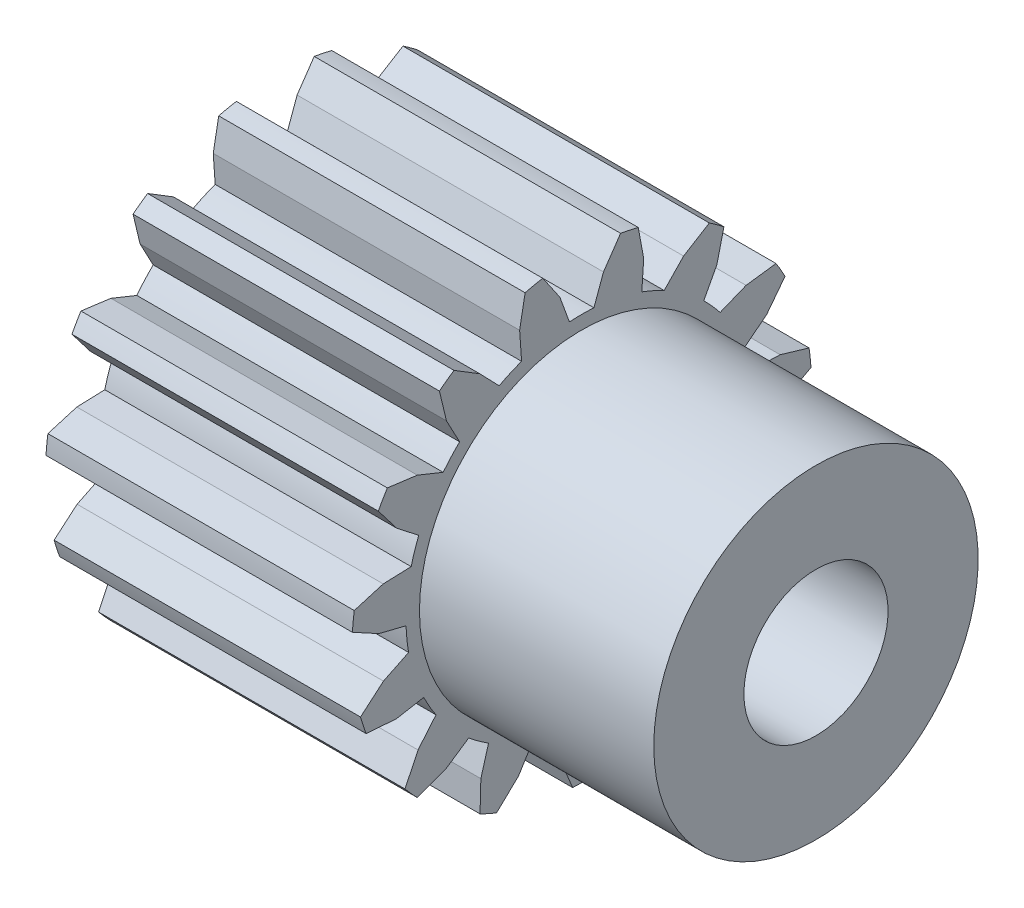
ISO-10303-21;
HEADER;
FILE_DESCRIPTION(('STEP AP214'),'2;1');
FILE_NAME('part.step','',(''),(''),'','','');
FILE_SCHEMA(('AUTOMOTIVE_DESIGN { 1 0 10303 214 1 1 1 1 }'));
ENDSEC;
DATA;
#1=APPLICATION_CONTEXT('core data for automotive mechanical design processes');
#2=APPLICATION_PROTOCOL_DEFINITION('international standard','automotive_design',2000,#1);
#3=PRODUCT_CONTEXT('',#1,'mechanical');
#4=PRODUCT('Part','Part','',(#3));
#5=PRODUCT_RELATED_PRODUCT_CATEGORY('part','',(#4));
#6=PRODUCT_DEFINITION_FORMATION('','',#4);
#7=PRODUCT_DEFINITION_CONTEXT('part definition',#1,'design');
#8=PRODUCT_DEFINITION('design','',#6,#7);
#9=PRODUCT_DEFINITION_SHAPE('','',#8);
#10=(LENGTH_UNIT() NAMED_UNIT(*) SI_UNIT(.MILLI.,.METRE.));
#11=(NAMED_UNIT(*) PLANE_ANGLE_UNIT() SI_UNIT($,.RADIAN.));
#12=(NAMED_UNIT(*) SI_UNIT($,.STERADIAN.) SOLID_ANGLE_UNIT());
#13=UNCERTAINTY_MEASURE_WITH_UNIT(LENGTH_MEASURE(1.E-05),#10,'distance_accuracy_value','');
#14=(GEOMETRIC_REPRESENTATION_CONTEXT(3) GLOBAL_UNCERTAINTY_ASSIGNED_CONTEXT((#13)) GLOBAL_UNIT_ASSIGNED_CONTEXT((#10,
#11,#12)) REPRESENTATION_CONTEXT('',''));
#15=CARTESIAN_POINT('',(0.,0.,0.));
#16=DIRECTION('',(0.,0.,1.));
#17=DIRECTION('',(1.,0.,0.));
#18=AXIS2_PLACEMENT_3D('',#15,#16,#17);
#19=CARTESIAN_POINT('',(-8.5,1.50053580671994E-13,3.40005801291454E-13));
#20=DIRECTION('',(-1.,0.,0.));
#21=DIRECTION('',(0.,0.,1.));
#22=AXIS2_PLACEMENT_3D('',#19,#20,#21);
#23=CYLINDRICAL_SURFACE('',#22,9.75000000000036);
#24=CARTESIAN_POINT('',(8.5,1.50053580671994E-13,3.40005801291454E-13));
#25=DIRECTION('',(-1.,0.,0.));
#26=DIRECTION('',(0.,0.,1.));
#27=AXIS2_PLACEMENT_3D('',#24,#25,#26);
#28=CIRCLE('',#27,9.75000000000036);
#29=CARTESIAN_POINT('',(8.5,-0.34027009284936,-9.7440605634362));
#30=VERTEX_POINT('',#29);
#31=CARTESIAN_POINT('',(8.5,-1.69306973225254,-9.60187559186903));
#32=VERTEX_POINT('',#31);
#33=EDGE_CURVE('E579',#30,#32,#28,.T.);
#34=ORIENTED_EDGE('',*,*,#33,.T.);
#35=DIRECTION('',(-1.,0.,0.));
#36=VECTOR('',#35,1.);
#37=CARTESIAN_POINT('',(8.5,-1.69306973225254,-9.60187559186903));
#38=LINE('',#37,#36);
#39=CARTESIAN_POINT('',(-8.5,-1.69306973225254,-9.60187559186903));
#40=VERTEX_POINT('',#39);
#41=EDGE_CURVE('E581',#40,#32,#38,.F.);
#42=ORIENTED_EDGE('',*,*,#41,.F.);
#43=CARTESIAN_POINT('',(-8.5,1.50053580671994E-13,3.40005801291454E-13));
#44=DIRECTION('',(-1.,0.,0.));
#45=DIRECTION('',(0.,0.,1.));
#46=AXIS2_PLACEMENT_3D('',#43,#44,#45);
#47=CIRCLE('',#46,9.75000000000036);
#48=CARTESIAN_POINT('',(-8.5,-0.34027009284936,-9.7440605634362));
#49=VERTEX_POINT('',#48);
#50=EDGE_CURVE('E18',#40,#49,#47,.F.);
#51=ORIENTED_EDGE('',*,*,#50,.T.);
#52=DIRECTION('',(-1.,0.,0.));
#53=VECTOR('',#52,1.);
#54=CARTESIAN_POINT('',(8.5,-0.34027009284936,-9.7440605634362));
#55=LINE('',#54,#53);
#56=EDGE_CURVE('E597',#30,#49,#55,.T.);
#57=ORIENTED_EDGE('',*,*,#56,.F.);
#58=EDGE_LOOP('',(#34,#42,#51,#57));
#59=FACE_BOUND('',#58,.T.);
#60=ADVANCED_FACE('F15',(#59),#23,.T.);
#61=CARTESIAN_POINT('',(8.5,-1.69306973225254,-9.60187559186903));
#62=DIRECTION('',(0.,0.898794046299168,-0.438371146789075));
#63=DIRECTION('',(0.,-0.438371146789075,-0.898794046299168));
#64=AXIS2_PLACEMENT_3D('',#61,#62,#63);
#65=PLANE('',#64);
#66=DIRECTION('',(0.,-0.438371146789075,-0.898794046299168));
#67=VECTOR('',#66,1.);
#68=CARTESIAN_POINT('',(8.5,-2.0332424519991,-10.2993330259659));
#69=LINE('',#68,#67);
#70=CARTESIAN_POINT('',(8.5,-2.37341517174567,-10.9967904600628));
#71=VERTEX_POINT('',#70);
#72=EDGE_CURVE('E584',#32,#71,#69,.T.);
#73=ORIENTED_EDGE('',*,*,#72,.T.);
#74=DIRECTION('',(-1.,0.,0.));
#75=VECTOR('',#74,1.);
#76=CARTESIAN_POINT('',(8.5,-2.37341517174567,-10.9967904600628));
#77=LINE('',#76,#75);
#78=CARTESIAN_POINT('',(-8.5,-2.37341517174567,-10.9967904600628));
#79=VERTEX_POINT('',#78);
#80=EDGE_CURVE('E588',#79,#71,#77,.F.);
#81=ORIENTED_EDGE('',*,*,#80,.F.);
#82=DIRECTION('',(0.,0.438371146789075,0.898794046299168));
#83=VECTOR('',#82,1.);
#84=CARTESIAN_POINT('',(-8.5,-2.0332424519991,-10.2993330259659));
#85=LINE('',#84,#83);
#86=EDGE_CURVE('E572',#79,#40,#85,.T.);
#87=ORIENTED_EDGE('',*,*,#86,.T.);
#88=ORIENTED_EDGE('',*,*,#41,.T.);
#89=EDGE_LOOP('',(#73,#81,#87,#88));
#90=FACE_BOUND('',#89,.T.);
#91=ADVANCED_FACE('F586',(#90),#65,.T.);
#92=CARTESIAN_POINT('',(8.5,0.03518905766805,-11.249944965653));
#93=DIRECTION('',(0.,-0.970295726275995,-0.241921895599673));
#94=DIRECTION('',(0.,-0.241921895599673,0.970295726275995));
#95=AXIS2_PLACEMENT_3D('',#92,#93,#94);
#96=PLANE('',#95);
#97=DIRECTION('',(0.,-0.241921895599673,0.970295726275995));
#98=VECTOR('',#97,1.);
#99=CARTESIAN_POINT('',(8.5,-0.152540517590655,-10.4970027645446));
#100=LINE('',#99,#98);
#101=CARTESIAN_POINT('',(8.5,0.0351890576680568,-11.249944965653));
#102=VERTEX_POINT('',#101);
#103=EDGE_CURVE('E599',#102,#30,#100,.T.);
#104=ORIENTED_EDGE('',*,*,#103,.T.);
#105=ORIENTED_EDGE('',*,*,#56,.T.);
#106=DIRECTION('',(0.,0.241921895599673,-0.970295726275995));
#107=VECTOR('',#106,1.);
#108=CARTESIAN_POINT('',(-8.5,-0.152540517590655,-10.4970027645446));
#109=LINE('',#108,#107);
#110=CARTESIAN_POINT('',(-8.5,0.0351890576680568,-11.249944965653));
#111=VERTEX_POINT('',#110);
#112=EDGE_CURVE('E575',#49,#111,#109,.T.);
#113=ORIENTED_EDGE('',*,*,#112,.T.);
#114=DIRECTION('',(-1.,0.,0.));
#115=VECTOR('',#114,1.);
#116=CARTESIAN_POINT('',(8.5,0.03518905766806,-11.249944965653));
#117=LINE('',#116,#115);
#118=EDGE_CURVE('E783',#102,#111,#117,.T.);
#119=ORIENTED_EDGE('',*,*,#118,.F.);
#120=EDGE_LOOP('',(#104,#105,#113,#119));
#121=FACE_BOUND('',#120,.T.);
#122=ADVANCED_FACE('F1934',(#121),#96,.T.);
#123=CARTESIAN_POINT('',(8.5,-2.37341517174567,-10.9967904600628));
#124=DIRECTION('',(0.,0.760528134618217,-0.649304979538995));
#125=DIRECTION('',(0.,-0.649304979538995,-0.760528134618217));
#126=AXIS2_PLACEMENT_3D('',#123,#124,#125);
#127=PLANE('',#126);
#128=DIRECTION('',(0.,-0.649304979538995,-0.760528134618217));
#129=VECTOR('',#128,1.);
#130=CARTESIAN_POINT('',(8.5,-2.91741142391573,-11.633970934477));
#131=LINE('',#130,#129);
#132=CARTESIAN_POINT('',(8.5,-3.4614076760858,-12.2711514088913));
#133=VERTEX_POINT('',#132);
#134=EDGE_CURVE('E798',#71,#133,#131,.T.);
#135=ORIENTED_EDGE('',*,*,#134,.T.);
#136=DIRECTION('',(1.,0.,0.));
#137=VECTOR('',#136,1.);
#138=CARTESIAN_POINT('',(0.,-3.4614076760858,-12.2711514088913));
#139=LINE('',#138,#137);
#140=CARTESIAN_POINT('',(-8.5,-3.4614076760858,-12.2711514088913));
#141=VERTEX_POINT('',#140);
#142=EDGE_CURVE('E777',#141,#133,#139,.T.);
#143=ORIENTED_EDGE('',*,*,#142,.F.);
#144=DIRECTION('',(0.,0.649304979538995,0.760528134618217));
#145=VECTOR('',#144,1.);
#146=CARTESIAN_POINT('',(-8.5,-2.91741142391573,-11.633970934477));
#147=LINE('',#146,#145);
#148=EDGE_CURVE('E598',#141,#79,#147,.T.);
#149=ORIENTED_EDGE('',*,*,#148,.T.);
#150=ORIENTED_EDGE('',*,*,#80,.T.);
#151=EDGE_LOOP('',(#135,#143,#149,#150));
#152=FACE_BOUND('',#151,.T.);
#153=ADVANCED_FACE('F830',(#152),#127,.T.);
#154=CARTESIAN_POINT('',(8.5,0.83445177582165,-12.7226644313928));
#155=DIRECTION('',(0.,-0.878906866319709,-0.47699341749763));
#156=DIRECTION('',(0.,-0.47699341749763,0.878906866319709));
#157=AXIS2_PLACEMENT_3D('',#154,#155,#156);
#158=PLANE('',#157);
#159=DIRECTION('',(0.,-0.47699341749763,0.878906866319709));
#160=VECTOR('',#159,1.);
#161=CARTESIAN_POINT('',(8.5,0.434820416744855,-11.9863046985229));
#162=LINE('',#161,#160);
#163=CARTESIAN_POINT('',(8.5,0.83445177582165,-12.7226644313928));
#164=VERTEX_POINT('',#163);
#165=EDGE_CURVE('E790',#164,#102,#162,.T.);
#166=ORIENTED_EDGE('',*,*,#165,.T.);
#167=ORIENTED_EDGE('',*,*,#118,.T.);
#168=DIRECTION('',(0.,0.47699341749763,-0.878906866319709));
#169=VECTOR('',#168,1.);
#170=CARTESIAN_POINT('',(-8.5,0.434820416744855,-11.9863046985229));
#171=LINE('',#170,#169);
#172=CARTESIAN_POINT('',(-8.5,0.83445177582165,-12.7226644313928));
#173=VERTEX_POINT('',#172);
#174=EDGE_CURVE('E793',#111,#173,#171,.T.);
#175=ORIENTED_EDGE('',*,*,#174,.T.);
#176=DIRECTION('',(-1.,0.,0.));
#177=VECTOR('',#176,1.);
#178=CARTESIAN_POINT('',(0.,0.83445177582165,-12.7226644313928));
#179=LINE('',#178,#177);
#180=EDGE_CURVE('E754',#164,#173,#179,.T.);
#181=ORIENTED_EDGE('',*,*,#180,.F.);
#182=EDGE_LOOP('',(#166,#167,#175,#181));
#183=FACE_BOUND('',#182,.T.);
#184=ADVANCED_FACE('F1931',(#183),#158,.T.);
#185=CARTESIAN_POINT('',(-8.5,1.99926880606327E-13,2.40259201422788E-13));
#186=DIRECTION('',(-1.,0.,0.));
#187=DIRECTION('',(0.,0.,1.));
#188=AXIS2_PLACEMENT_3D('',#185,#186,#187);
#189=CYLINDRICAL_SURFACE('',#188,12.7500000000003);
#190=CARTESIAN_POINT('',(8.5,2.E-13,2.4E-13));
#191=DIRECTION('',(-1.,0.,0.));
#192=DIRECTION('',(0.,-0.346075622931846,-0.938206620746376));
#193=AXIS2_PLACEMENT_3D('',#190,#191,#192);
#194=CIRCLE('',#193,12.7500000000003);
#195=CARTESIAN_POINT('',(8.5,-4.41246419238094,-11.9621344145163));
#196=VERTEX_POINT('',#195);
#197=EDGE_CURVE('E769',#133,#196,#194,.T.);
#198=ORIENTED_EDGE('',*,*,#197,.T.);
#199=DIRECTION('',(-1.,0.,0.));
#200=VECTOR('',#199,1.);
#201=CARTESIAN_POINT('',(8.5,-4.41246419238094,-11.9621344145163));
#202=LINE('',#201,#200);
#203=CARTESIAN_POINT('',(-8.5,-4.41246419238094,-11.9621344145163));
#204=VERTEX_POINT('',#203);
#205=EDGE_CURVE('E748',#204,#196,#202,.F.);
#206=ORIENTED_EDGE('',*,*,#205,.F.);
#207=CARTESIAN_POINT('',(-8.5,2.E-13,2.4E-13));
#208=DIRECTION('',(-1.,0.,0.));
#209=DIRECTION('',(0.,-0.346075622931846,-0.938206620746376));
#210=AXIS2_PLACEMENT_3D('',#207,#208,#209);
#211=CIRCLE('',#210,12.7500000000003);
#212=EDGE_CURVE('E780',#204,#141,#211,.F.);
#213=ORIENTED_EDGE('',*,*,#212,.T.);
#214=ORIENTED_EDGE('',*,*,#142,.T.);
#215=EDGE_LOOP('',(#198,#206,#213,#214));
#216=FACE_BOUND('',#215,.T.);
#217=ADVANCED_FACE('F834',(#216),#189,.T.);
#218=CARTESIAN_POINT('',(-8.5,-1.70002900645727E-13,1.02001740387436E-12));
#219=DIRECTION('',(-1.,0.,0.));
#220=DIRECTION('',(0.,0.,1.));
#221=AXIS2_PLACEMENT_3D('',#218,#219,#220);
#222=CYLINDRICAL_SURFACE('',#221,12.750000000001);
#223=CARTESIAN_POINT('',(8.5,-1.7E-13,1.02E-12));
#224=DIRECTION('',(-1.,0.,0.));
#225=DIRECTION('',(0.,0.0654471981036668,-0.997856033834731));
#226=AXIS2_PLACEMENT_3D('',#223,#224,#225);
#227=CIRCLE('',#226,12.750000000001);
#228=CARTESIAN_POINT('',(8.5,1.82897367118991,-12.6181359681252));
#229=VERTEX_POINT('',#228);
#230=EDGE_CURVE('E761',#229,#164,#227,.T.);
#231=ORIENTED_EDGE('',*,*,#230,.T.);
#232=ORIENTED_EDGE('',*,*,#180,.T.);
#233=CARTESIAN_POINT('',(-8.5,-1.7E-13,1.02E-12));
#234=DIRECTION('',(-1.,0.,0.));
#235=DIRECTION('',(0.,0.0654471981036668,-0.997856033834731));
#236=AXIS2_PLACEMENT_3D('',#233,#234,#235);
#237=CIRCLE('',#236,12.750000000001);
#238=CARTESIAN_POINT('',(-8.5,1.82897367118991,-12.6181359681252));
#239=VERTEX_POINT('',#238);
#240=EDGE_CURVE('E764',#173,#239,#237,.F.);
#241=ORIENTED_EDGE('',*,*,#240,.T.);
#242=DIRECTION('',(-1.,0.,0.));
#243=VECTOR('',#242,1.);
#244=CARTESIAN_POINT('',(8.5,1.82897367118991,-12.6181359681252));
#245=LINE('',#244,#243);
#246=EDGE_CURVE('E731',#229,#239,#245,.T.);
#247=ORIENTED_EDGE('',*,*,#246,.F.);
#248=EDGE_LOOP('',(#231,#232,#241,#247));
#249=FACE_BOUND('',#248,.T.);
#250=ADVANCED_FACE('F1928',(#249),#222,.T.);
#251=CARTESIAN_POINT('',(8.5,-4.41246419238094,-11.9621344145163));
#252=DIRECTION('',(0.,-0.996932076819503,-0.0782715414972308));
#253=DIRECTION('',(0.,-0.0782715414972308,0.996932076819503));
#254=AXIS2_PLACEMENT_3D('',#251,#252,#253);
#255=PLANE('',#254);
#256=DIRECTION('',(0.,-0.0782715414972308,0.996932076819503));
#257=VECTOR('',#256,1.);
#258=CARTESIAN_POINT('',(8.5,-4.47804111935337,-11.1268916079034));
#259=LINE('',#258,#257);
#260=CARTESIAN_POINT('',(8.5,-4.54361804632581,-10.2916488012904));
#261=VERTEX_POINT('',#260);
#262=EDGE_CURVE('E737',#196,#261,#259,.T.);
#263=ORIENTED_EDGE('',*,*,#262,.T.);
#264=DIRECTION('',(-1.,0.,0.));
#265=VECTOR('',#264,1.);
#266=CARTESIAN_POINT('',(8.5,-4.54361804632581,-10.2916488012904));
#267=LINE('',#266,#265);
#268=CARTESIAN_POINT('',(-8.5,-4.54361804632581,-10.2916488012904));
#269=VERTEX_POINT('',#268);
#270=EDGE_CURVE('E740',#269,#261,#267,.F.);
#271=ORIENTED_EDGE('',*,*,#270,.F.);
#272=DIRECTION('',(0.,0.0782715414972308,-0.996932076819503));
#273=VECTOR('',#272,1.);
#274=CARTESIAN_POINT('',(-8.5,-4.47804111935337,-11.1268916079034));
#275=LINE('',#274,#273);
#276=EDGE_CURVE('E751',#269,#204,#275,.T.);
#277=ORIENTED_EDGE('',*,*,#276,.T.);
#278=ORIENTED_EDGE('',*,*,#205,.T.);
#279=EDGE_LOOP('',(#263,#271,#277,#278));
#280=FACE_BOUND('',#279,.T.);
#281=ADVANCED_FACE('F836',(#280),#255,.T.);
#282=CARTESIAN_POINT('',(8.5,2.30457498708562,-11.0114228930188));
#283=DIRECTION('',(0.,0.958873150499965,-0.283834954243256));
#284=DIRECTION('',(0.,-0.283834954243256,-0.958873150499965));
#285=AXIS2_PLACEMENT_3D('',#282,#283,#284);
#286=PLANE('',#285);
#287=DIRECTION('',(0.,-0.283834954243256,-0.958873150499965));
#288=VECTOR('',#287,1.);
#289=CARTESIAN_POINT('',(8.5,2.06677432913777,-11.814779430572));
#290=LINE('',#289,#288);
#291=CARTESIAN_POINT('',(8.5,2.30457498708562,-11.0114228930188));
#292=VERTEX_POINT('',#291);
#293=EDGE_CURVE('E728',#292,#229,#290,.T.);
#294=ORIENTED_EDGE('',*,*,#293,.T.);
#295=ORIENTED_EDGE('',*,*,#246,.T.);
#296=DIRECTION('',(0.,0.283834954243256,0.958873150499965));
#297=VECTOR('',#296,1.);
#298=CARTESIAN_POINT('',(-8.5,2.06677432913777,-11.814779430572));
#299=LINE('',#298,#297);
#300=CARTESIAN_POINT('',(-8.5,2.30457498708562,-11.0114228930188));
#301=VERTEX_POINT('',#300);
#302=EDGE_CURVE('E732',#239,#301,#299,.T.);
#303=ORIENTED_EDGE('',*,*,#302,.T.);
#304=DIRECTION('',(-1.,0.,0.));
#305=VECTOR('',#304,1.);
#306=CARTESIAN_POINT('',(8.5,2.30457498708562,-11.0114228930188));
#307=LINE('',#306,#305);
#308=EDGE_CURVE('E708',#292,#301,#307,.T.);
#309=ORIENTED_EDGE('',*,*,#308,.F.);
#310=EDGE_LOOP('',(#294,#295,#303,#309));
#311=FACE_BOUND('',#310,.T.);
#312=ADVANCED_FACE('F1925',(#311),#286,.T.);
#313=CARTESIAN_POINT('',(8.5,-4.54361804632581,-10.2916488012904));
#314=DIRECTION('',(0.,-0.984807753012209,0.173648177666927));
#315=DIRECTION('',(0.,0.173648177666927,0.984807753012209));
#316=AXIS2_PLACEMENT_3D('',#313,#314,#315);
#317=PLANE('',#316);
#318=DIRECTION('',(0.,0.173648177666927,0.984807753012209));
#319=VECTOR('',#318,1.);
#320=CARTESIAN_POINT('',(8.5,-4.40886836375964,-9.52744537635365));
#321=LINE('',#320,#319);
#322=CARTESIAN_POINT('',(8.5,-4.27411868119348,-8.76324195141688));
#323=VERTEX_POINT('',#322);
#324=EDGE_CURVE('E743',#261,#323,#321,.T.);
#325=ORIENTED_EDGE('',*,*,#324,.T.);
#326=DIRECTION('',(1.,0.,0.));
#327=VECTOR('',#326,1.);
#328=CARTESIAN_POINT('',(0.,-4.27411868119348,-8.76324195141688));
#329=LINE('',#328,#327);
#330=CARTESIAN_POINT('',(-8.5,-4.27411868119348,-8.76324195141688));
#331=VERTEX_POINT('',#330);
#332=EDGE_CURVE('E705',#331,#323,#329,.T.);
#333=ORIENTED_EDGE('',*,*,#332,.F.);
#334=DIRECTION('',(0.,-0.173648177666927,-0.984807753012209));
#335=VECTOR('',#334,1.);
#336=CARTESIAN_POINT('',(-8.5,-4.40886836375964,-9.52744537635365));
#337=LINE('',#336,#335);
#338=EDGE_CURVE('E744',#331,#269,#337,.T.);
#339=ORIENTED_EDGE('',*,*,#338,.T.);
#340=ORIENTED_EDGE('',*,*,#270,.T.);
#341=EDGE_LOOP('',(#325,#333,#339,#340));
#342=FACE_BOUND('',#341,.T.);
#343=ADVANCED_FACE('F841',(#342),#317,.T.);
#344=CARTESIAN_POINT('',(8.5,2.35873848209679,-9.46038333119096));
#345=DIRECTION('',(0.,0.999390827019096,-0.0348994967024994));
#346=DIRECTION('',(0.,-0.0348994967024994,-0.999390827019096));
#347=AXIS2_PLACEMENT_3D('',#344,#345,#346);
#348=PLANE('',#347);
#349=DIRECTION('',(0.,-0.0348994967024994,-0.999390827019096));
#350=VECTOR('',#349,1.);
#351=CARTESIAN_POINT('',(8.5,2.33165673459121,-10.2359031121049));
#352=LINE('',#351,#350);
#353=CARTESIAN_POINT('',(8.5,2.35873848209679,-9.46038333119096));
#354=VERTEX_POINT('',#353);
#355=EDGE_CURVE('E714',#354,#292,#352,.T.);
#356=ORIENTED_EDGE('',*,*,#355,.T.);
#357=ORIENTED_EDGE('',*,*,#308,.T.);
#358=DIRECTION('',(0.,0.0348994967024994,0.999390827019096));
#359=VECTOR('',#358,1.);
#360=CARTESIAN_POINT('',(-8.5,2.33165673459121,-10.2359031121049));
#361=LINE('',#360,#359);
#362=CARTESIAN_POINT('',(-8.5,2.35873848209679,-9.46038333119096));
#363=VERTEX_POINT('',#362);
#364=EDGE_CURVE('E720',#301,#363,#361,.T.);
#365=ORIENTED_EDGE('',*,*,#364,.T.);
#366=DIRECTION('',(-1.,0.,0.));
#367=VECTOR('',#366,1.);
#368=CARTESIAN_POINT('',(0.,2.35873848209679,-9.46038333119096));
#369=LINE('',#368,#367);
#370=EDGE_CURVE('E699',#354,#363,#369,.T.);
#371=ORIENTED_EDGE('',*,*,#370,.F.);
#372=EDGE_LOOP('',(#356,#357,#365,#371));
#373=FACE_BOUND('',#372,.T.);
#374=ADVANCED_FACE('F1923',(#373),#348,.T.);
#375=CARTESIAN_POINT('',(-8.5,2.70183181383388E-13,6.69603261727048E-13));
#376=DIRECTION('',(-1.,0.,0.));
#377=DIRECTION('',(0.,0.,1.));
#378=AXIS2_PLACEMENT_3D('',#375,#376,#377);
#379=CYLINDRICAL_SURFACE('',#378,9.75000000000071);
#380=CARTESIAN_POINT('',(8.5,2.70183181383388E-13,6.69603261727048E-13));
#381=DIRECTION('',(-1.,0.,0.));
#382=DIRECTION('',(0.,0.,1.));
#383=AXIS2_PLACEMENT_3D('',#380,#381,#382);
#384=CIRCLE('',#383,9.75000000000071);
#385=CARTESIAN_POINT('',(8.5,-5.45213080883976,-8.08311633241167));
#386=VERTEX_POINT('',#385);
#387=EDGE_CURVE('E703',#323,#386,#384,.T.);
#388=ORIENTED_EDGE('',*,*,#387,.T.);
#389=DIRECTION('',(-1.,0.,0.));
#390=VECTOR('',#389,1.);
#391=CARTESIAN_POINT('',(8.5,-5.45213080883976,-8.08311633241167));
#392=LINE('',#391,#390);
#393=CARTESIAN_POINT('',(-8.5,-5.45213080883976,-8.08311633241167));
#394=VERTEX_POINT('',#393);
#395=EDGE_CURVE('E854',#394,#386,#392,.F.);
#396=ORIENTED_EDGE('',*,*,#395,.F.);
#397=CARTESIAN_POINT('',(-8.5,2.70183181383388E-13,6.69603261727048E-13));
#398=DIRECTION('',(-1.,0.,0.));
#399=DIRECTION('',(0.,0.,1.));
#400=AXIS2_PLACEMENT_3D('',#397,#398,#399);
#401=CIRCLE('',#400,9.75000000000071);
#402=EDGE_CURVE('E706',#394,#331,#401,.F.);
#403=ORIENTED_EDGE('',*,*,#402,.T.);
#404=ORIENTED_EDGE('',*,*,#332,.T.);
#405=EDGE_LOOP('',(#388,#396,#403,#404));
#406=FACE_BOUND('',#405,.T.);
#407=ADVANCED_FACE('F2212',(#406),#379,.T.);
#408=CARTESIAN_POINT('',(-8.5,0.,0.));
#409=DIRECTION('',(-1.,0.,0.));
#410=DIRECTION('',(0.,0.,1.));
#411=AXIS2_PLACEMENT_3D('',#408,#409,#410);
#412=CYLINDRICAL_SURFACE('',#411,9.74999999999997);
#413=CARTESIAN_POINT('',(8.5,0.,0.));
#414=DIRECTION('',(-1.,0.,0.));
#415=DIRECTION('',(0.,0.,1.));
#416=AXIS2_PLACEMENT_3D('',#413,#414,#415);
#417=CIRCLE('',#416,9.74999999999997);
#418=CARTESIAN_POINT('',(8.5,3.65241428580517,-9.04004258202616));
#419=VERTEX_POINT('',#418);
#420=EDGE_CURVE('E696',#419,#354,#417,.T.);
#421=ORIENTED_EDGE('',*,*,#420,.T.);
#422=ORIENTED_EDGE('',*,*,#370,.T.);
#423=CARTESIAN_POINT('',(-8.5,0.,0.));
#424=DIRECTION('',(-1.,0.,0.));
#425=DIRECTION('',(0.,0.,1.));
#426=AXIS2_PLACEMENT_3D('',#423,#424,#425);
#427=CIRCLE('',#426,9.74999999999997);
#428=CARTESIAN_POINT('',(-8.5,3.65241428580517,-9.04004258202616));
#429=VERTEX_POINT('',#428);
#430=EDGE_CURVE('E700',#363,#429,#427,.F.);
#431=ORIENTED_EDGE('',*,*,#430,.T.);
#432=DIRECTION('',(-1.,0.,0.));
#433=VECTOR('',#432,1.);
#434=CARTESIAN_POINT('',(8.5,3.65241428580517,-9.04004258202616));
#435=LINE('',#434,#433);
#436=EDGE_CURVE('E858',#419,#429,#435,.T.);
#437=ORIENTED_EDGE('',*,*,#436,.F.);
#438=EDGE_LOOP('',(#421,#422,#431,#437));
#439=FACE_BOUND('',#438,.T.);
#440=ADVANCED_FACE('F1921',(#439),#412,.T.);
#441=CARTESIAN_POINT('',(8.5,-5.45213080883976,-8.08311633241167));
#442=DIRECTION('',(0.,0.642787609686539,-0.766044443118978));
#443=DIRECTION('',(0.,-0.766044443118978,-0.642787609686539));
#444=AXIS2_PLACEMENT_3D('',#441,#442,#443);
#445=PLANE('',#444);
#446=DIRECTION('',(0.,-0.766044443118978,-0.642787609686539));
#447=VECTOR('',#446,1.);
#448=CARTESIAN_POINT('',(8.5,-6.04657554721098,-8.58191469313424));
#449=LINE('',#448,#447);
#450=CARTESIAN_POINT('',(8.5,-6.6410202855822,-9.08071305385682));
#451=VERTEX_POINT('',#450);
#452=EDGE_CURVE('E857',#386,#451,#449,.T.);
#453=ORIENTED_EDGE('',*,*,#452,.T.);
#454=DIRECTION('',(-1.,0.,0.));
#455=VECTOR('',#454,1.);
#456=CARTESIAN_POINT('',(8.5,-6.6410202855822,-9.08071305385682));
#457=LINE('',#456,#455);
#458=CARTESIAN_POINT('',(-8.5,-6.6410202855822,-9.08071305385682));
#459=VERTEX_POINT('',#458);
#460=EDGE_CURVE('E873',#459,#451,#457,.F.);
#461=ORIENTED_EDGE('',*,*,#460,.F.);
#462=DIRECTION('',(0.,0.766044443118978,0.642787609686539));
#463=VECTOR('',#462,1.);
#464=CARTESIAN_POINT('',(-8.5,-6.04657554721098,-8.58191469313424));
#465=LINE('',#464,#463);
#466=EDGE_CURVE('E853',#459,#394,#465,.T.);
#467=ORIENTED_EDGE('',*,*,#466,.T.);
#468=ORIENTED_EDGE('',*,*,#395,.T.);
#469=EDGE_LOOP('',(#453,#461,#467,#468));
#470=FACE_BOUND('',#469,.T.);
#471=ADVANCED_FACE('F2206',(#470),#445,.T.);
#472=CARTESIAN_POINT('',(8.5,4.60791165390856,-10.2630234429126));
#473=DIRECTION('',(0.,-0.788010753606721,-0.61566147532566));
#474=DIRECTION('',(0.,-0.61566147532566,0.788010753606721));
#475=AXIS2_PLACEMENT_3D('',#472,#473,#474);
#476=PLANE('',#475);
#477=DIRECTION('',(0.,-0.61566147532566,0.788010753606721));
#478=VECTOR('',#477,1.);
#479=CARTESIAN_POINT('',(8.5,4.13016296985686,-9.65153301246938));
#480=LINE('',#479,#478);
#481=CARTESIAN_POINT('',(8.5,4.60791165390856,-10.2630234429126));
#482=VERTEX_POINT('',#481);
#483=EDGE_CURVE('E862',#482,#419,#480,.T.);
#484=ORIENTED_EDGE('',*,*,#483,.T.);
#485=ORIENTED_EDGE('',*,*,#436,.T.);
#486=DIRECTION('',(0.,0.61566147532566,-0.788010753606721));
#487=VECTOR('',#486,1.);
#488=CARTESIAN_POINT('',(-8.5,4.13016296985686,-9.65153301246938));
#489=LINE('',#488,#487);
#490=CARTESIAN_POINT('',(-8.5,4.60791165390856,-10.2630234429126));
#491=VERTEX_POINT('',#490);
#492=EDGE_CURVE('E870',#429,#491,#489,.T.);
#493=ORIENTED_EDGE('',*,*,#492,.T.);
#494=DIRECTION('',(-1.,0.,0.));
#495=VECTOR('',#494,1.);
#496=CARTESIAN_POINT('',(8.5,4.60791165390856,-10.2630234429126));
#497=LINE('',#496,#495);
#498=EDGE_CURVE('E887',#482,#491,#497,.T.);
#499=ORIENTED_EDGE('',*,*,#498,.F.);
#500=EDGE_LOOP('',(#484,#485,#493,#499));
#501=FACE_BOUND('',#500,.T.);
#502=ADVANCED_FACE('F1918',(#501),#476,.T.);
#503=CARTESIAN_POINT('',(8.5,-6.6410202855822,-9.08071305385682));
#504=DIRECTION('',(0.,0.430680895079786,-0.902504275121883));
#505=DIRECTION('',(0.,-0.902504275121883,-0.430680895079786));
#506=AXIS2_PLACEMENT_3D('',#503,#504,#505);
#507=PLANE('',#506);
#508=DIRECTION('',(0.,-0.902504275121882,-0.430680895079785));
#509=VECTOR('',#508,1.);
#510=CARTESIAN_POINT('',(8.5,-7.39715023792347,-9.44154317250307));
#511=LINE('',#510,#509);
#512=CARTESIAN_POINT('',(8.5,-8.15328019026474,-9.80237329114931));
#513=VERTEX_POINT('',#512);
#514=EDGE_CURVE('E876',#451,#513,#511,.T.);
#515=ORIENTED_EDGE('',*,*,#514,.T.);
#516=DIRECTION('',(1.,0.,0.));
#517=VECTOR('',#516,1.);
#518=CARTESIAN_POINT('',(0.,-8.15328019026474,-9.80237329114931));
#519=LINE('',#518,#517);
#520=CARTESIAN_POINT('',(-8.5,-8.15328019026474,-9.80237329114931));
#521=VERTEX_POINT('',#520);
#522=EDGE_CURVE('E902',#521,#513,#519,.T.);
#523=ORIENTED_EDGE('',*,*,#522,.F.);
#524=DIRECTION('',(0.,0.902504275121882,0.430680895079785));
#525=VECTOR('',#524,1.);
#526=CARTESIAN_POINT('',(-8.5,-7.39715023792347,-9.44154317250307));
#527=LINE('',#526,#525);
#528=EDGE_CURVE('E861',#521,#459,#527,.T.);
#529=ORIENTED_EDGE('',*,*,#528,.T.);
#530=ORIENTED_EDGE('',*,*,#460,.T.);
#531=EDGE_LOOP('',(#515,#523,#529,#530));
#532=FACE_BOUND('',#531,.T.);
#533=ADVANCED_FACE('F2200',(#532),#507,.T.);
#534=CARTESIAN_POINT('',(8.5,5.93708345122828,-11.2833301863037));
#535=DIRECTION('',(0.,-0.608910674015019,-0.793238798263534));
#536=DIRECTION('',(0.,-0.793238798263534,0.608910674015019));
#537=AXIS2_PLACEMENT_3D('',#534,#535,#536);
#538=PLANE('',#537);
#539=DIRECTION('',(0.,-0.793238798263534,0.608910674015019));
#540=VECTOR('',#539,1.);
#541=CARTESIAN_POINT('',(8.5,5.27249755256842,-10.7731768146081));
#542=LINE('',#541,#540);
#543=CARTESIAN_POINT('',(8.5,5.93708345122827,-11.2833301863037));
#544=VERTEX_POINT('',#543);
#545=EDGE_CURVE('E891',#544,#482,#542,.T.);
#546=ORIENTED_EDGE('',*,*,#545,.T.);
#547=ORIENTED_EDGE('',*,*,#498,.T.);
#548=DIRECTION('',(0.,0.793238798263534,-0.608910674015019));
#549=VECTOR('',#548,1.);
#550=CARTESIAN_POINT('',(-8.5,5.27249755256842,-10.7731768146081));
#551=LINE('',#550,#549);
#552=CARTESIAN_POINT('',(-8.5,5.93708345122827,-11.2833301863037));
#553=VERTEX_POINT('',#552);
#554=EDGE_CURVE('E899',#491,#553,#551,.T.);
#555=ORIENTED_EDGE('',*,*,#554,.T.);
#556=DIRECTION('',(-1.,0.,0.));
#557=VECTOR('',#556,1.);
#558=CARTESIAN_POINT('',(0.,5.93708345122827,-11.2833301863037));
#559=LINE('',#558,#557);
#560=EDGE_CURVE('E916',#544,#553,#559,.T.);
#561=ORIENTED_EDGE('',*,*,#560,.F.);
#562=EDGE_LOOP('',(#546,#547,#555,#561));
#563=FACE_BOUND('',#562,.T.);
#564=ADVANCED_FACE('F1915',(#563),#538,.T.);
#565=CARTESIAN_POINT('',(-8.5,2.15018974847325E-12,1.88998122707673E-12));
#566=DIRECTION('',(-1.,0.,0.));
#567=DIRECTION('',(0.,0.,1.));
#568=AXIS2_PLACEMENT_3D('',#565,#566,#567);
#569=CYLINDRICAL_SURFACE('',#568,12.7500000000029);
#570=CARTESIAN_POINT('',(8.5,2.15E-12,1.89E-12));
#571=DIRECTION('',(-1.,0.,0.));
#572=DIRECTION('',(0.,-0.697758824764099,-0.716332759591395));
#573=AXIS2_PLACEMENT_3D('',#570,#571,#572);
#574=CIRCLE('',#573,12.7500000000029);
#575=CARTESIAN_POINT('',(8.5,-8.89642501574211,-9.13324268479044));
#576=VERTEX_POINT('',#575);
#577=EDGE_CURVE('E905',#513,#576,#574,.T.);
#578=ORIENTED_EDGE('',*,*,#577,.T.);
#579=DIRECTION('',(-1.,0.,0.));
#580=VECTOR('',#579,1.);
#581=CARTESIAN_POINT('',(8.5,-8.89642501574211,-9.13324268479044));
#582=LINE('',#581,#580);
#583=CARTESIAN_POINT('',(-8.5,-8.89642501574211,-9.13324268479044));
#584=VERTEX_POINT('',#583);
#585=EDGE_CURVE('E931',#584,#576,#582,.F.);
#586=ORIENTED_EDGE('',*,*,#585,.F.);
#587=CARTESIAN_POINT('',(-8.5,2.15E-12,1.89E-12));
#588=DIRECTION('',(-1.,0.,0.));
#589=DIRECTION('',(0.,-0.697758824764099,-0.716332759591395));
#590=AXIS2_PLACEMENT_3D('',#587,#588,#589);
#591=CIRCLE('',#590,12.7500000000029);
#592=EDGE_CURVE('E890',#584,#521,#591,.F.);
#593=ORIENTED_EDGE('',*,*,#592,.T.);
#594=ORIENTED_EDGE('',*,*,#522,.T.);
#595=EDGE_LOOP('',(#578,#586,#593,#594));
#596=FACE_BOUND('',#595,.T.);
#597=ADVANCED_FACE('F2194',(#596),#569,.T.);
#598=CARTESIAN_POINT('',(-8.5,-6.80011602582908E-13,1.70956998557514E-12));
#599=DIRECTION('',(-1.,0.,0.));
#600=DIRECTION('',(0.,0.,1.));
#601=AXIS2_PLACEMENT_3D('',#598,#599,#600);
#602=CYLINDRICAL_SURFACE('',#601,12.7500000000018);
#603=CARTESIAN_POINT('',(8.5,-6.8E-13,1.71E-12));
#604=DIRECTION('',(-1.,0.,0.));
#605=DIRECTION('',(0.,0.46565360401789,-0.884967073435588));
#606=AXIS2_PLACEMENT_3D('',#603,#604,#605);
#607=CIRCLE('',#606,12.7500000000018);
#608=CARTESIAN_POINT('',(8.5,6.80310885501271,-10.7833301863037));
#609=VERTEX_POINT('',#608);
#610=EDGE_CURVE('E920',#609,#544,#607,.T.);
#611=ORIENTED_EDGE('',*,*,#610,.T.);
#612=ORIENTED_EDGE('',*,*,#560,.T.);
#613=CARTESIAN_POINT('',(-8.5,-6.8E-13,1.71E-12));
#614=DIRECTION('',(-1.,0.,0.));
#615=DIRECTION('',(0.,0.46565360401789,-0.884967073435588));
#616=AXIS2_PLACEMENT_3D('',#613,#614,#615);
#617=CIRCLE('',#616,12.7500000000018);
#618=CARTESIAN_POINT('',(-8.5,6.80310885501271,-10.7833301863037));
#619=VERTEX_POINT('',#618);
#620=EDGE_CURVE('E928',#553,#619,#617,.F.);
#621=ORIENTED_EDGE('',*,*,#620,.T.);
#622=DIRECTION('',(-1.,0.,0.));
#623=VECTOR('',#622,1.);
#624=CARTESIAN_POINT('',(8.5,6.80310885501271,-10.7833301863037));
#625=LINE('',#624,#623);
#626=EDGE_CURVE('E945',#609,#619,#625,.T.);
#627=ORIENTED_EDGE('',*,*,#626,.F.);
#628=EDGE_LOOP('',(#611,#612,#621,#627));
#629=FACE_BOUND('',#628,.T.);
#630=ADVANCED_FACE('F1912',(#629),#602,.T.);
#631=CARTESIAN_POINT('',(8.5,-8.89642501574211,-9.13324268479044));
#632=DIRECTION('',(0.,-0.942578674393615,0.333984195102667));
#633=DIRECTION('',(0.,0.333984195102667,0.942578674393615));
#634=AXIS2_PLACEMENT_3D('',#631,#632,#633);
#635=PLANE('',#634);
#636=DIRECTION('',(0.,0.333984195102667,0.942578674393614));
#637=VECTOR('',#636,1.);
#638=CARTESIAN_POINT('',(8.5,-8.61660866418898,-8.34353787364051));
#639=LINE('',#638,#637);
#640=CARTESIAN_POINT('',(8.5,-8.33679231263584,-7.55383306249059));
#641=VERTEX_POINT('',#640);
#642=EDGE_CURVE('E934',#576,#641,#639,.T.);
#643=ORIENTED_EDGE('',*,*,#642,.T.);
#644=DIRECTION('',(-1.,0.,0.));
#645=VECTOR('',#644,1.);
#646=CARTESIAN_POINT('',(8.5,-8.33679231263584,-7.55383306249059));
#647=LINE('',#646,#645);
#648=CARTESIAN_POINT('',(-8.5,-8.33679231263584,-7.55383306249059));
#649=VERTEX_POINT('',#648);
#650=EDGE_CURVE('E960',#649,#641,#647,.F.);
#651=ORIENTED_EDGE('',*,*,#650,.F.);
#652=DIRECTION('',(0.,-0.333984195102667,-0.942578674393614));
#653=VECTOR('',#652,1.);
#654=CARTESIAN_POINT('',(-8.5,-8.61660866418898,-8.34353787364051));
#655=LINE('',#654,#653);
#656=EDGE_CURVE('E919',#649,#584,#655,.T.);
#657=ORIENTED_EDGE('',*,*,#656,.T.);
#658=ORIENTED_EDGE('',*,*,#585,.T.);
#659=EDGE_LOOP('',(#643,#651,#657,#658));
#660=FACE_BOUND('',#659,.T.);
#661=ADVANCED_FACE('F2188',(#660),#635,.T.);
#662=CARTESIAN_POINT('',(8.5,6.58408319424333,-9.12208027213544));
#663=DIRECTION('',(0.,0.991420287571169,0.130712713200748));
#664=DIRECTION('',(0.,0.130712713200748,-0.991420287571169));
#665=AXIS2_PLACEMENT_3D('',#662,#663,#664);
#666=PLANE('',#665);
#667=DIRECTION('',(0.,0.130712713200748,-0.991420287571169));
#668=VECTOR('',#667,1.);
#669=CARTESIAN_POINT('',(8.5,6.69359602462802,-9.95270522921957));
#670=LINE('',#669,#668);
#671=CARTESIAN_POINT('',(8.5,6.58408319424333,-9.12208027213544));
#672=VERTEX_POINT('',#671);
#673=EDGE_CURVE('E949',#672,#609,#670,.T.);
#674=ORIENTED_EDGE('',*,*,#673,.T.);
#675=ORIENTED_EDGE('',*,*,#626,.T.);
#676=DIRECTION('',(0.,-0.130712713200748,0.991420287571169));
#677=VECTOR('',#676,1.);
#678=CARTESIAN_POINT('',(-8.5,6.69359602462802,-9.95270522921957));
#679=LINE('',#678,#677);
#680=CARTESIAN_POINT('',(-8.5,6.58408319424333,-9.12208027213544));
#681=VERTEX_POINT('',#680);
#682=EDGE_CURVE('E957',#619,#681,#679,.T.);
#683=ORIENTED_EDGE('',*,*,#682,.T.);
#684=DIRECTION('',(-1.,0.,0.));
#685=VECTOR('',#684,1.);
#686=CARTESIAN_POINT('',(8.5,6.58408319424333,-9.12208027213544));
#687=LINE('',#686,#685);
#688=EDGE_CURVE('E695',#672,#681,#687,.T.);
#689=ORIENTED_EDGE('',*,*,#688,.F.);
#690=EDGE_LOOP('',(#674,#675,#683,#689));
#691=FACE_BOUND('',#690,.T.);
#692=ADVANCED_FACE('F1909',(#691),#666,.T.);
#693=CARTESIAN_POINT('',(8.5,-8.33679231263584,-7.55383306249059));
#694=DIRECTION('',(0.,-0.829037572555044,0.559192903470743));
#695=DIRECTION('',(0.,0.559192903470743,0.829037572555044));
#696=AXIS2_PLACEMENT_3D('',#693,#694,#695);
#697=PLANE('',#696);
#698=DIRECTION('',(0.,0.559192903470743,0.829037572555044));
#699=VECTOR('',#698,1.);
#700=CARTESIAN_POINT('',(8.5,-7.90286281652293,-6.91050612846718));
#701=LINE('',#700,#699);
#702=CARTESIAN_POINT('',(8.5,-7.46893332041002,-6.26717919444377));
#703=VERTEX_POINT('',#702);
#704=EDGE_CURVE('E963',#641,#703,#701,.T.);
#705=ORIENTED_EDGE('',*,*,#704,.T.);
#706=DIRECTION('',(1.,0.,0.));
#707=VECTOR('',#706,1.);
#708=CARTESIAN_POINT('',(0.,-7.46893332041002,-6.26717919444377));
#709=LINE('',#708,#707);
#710=CARTESIAN_POINT('',(-8.5,-7.46893332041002,-6.26717919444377));
#711=VERTEX_POINT('',#710);
#712=EDGE_CURVE('E691',#711,#703,#709,.T.);
#713=ORIENTED_EDGE('',*,*,#712,.F.);
#714=DIRECTION('',(0.,-0.559192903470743,-0.829037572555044));
#715=VECTOR('',#714,1.);
#716=CARTESIAN_POINT('',(-8.5,-7.90286281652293,-6.91050612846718));
#717=LINE('',#716,#715);
#718=EDGE_CURVE('E948',#711,#649,#717,.T.);
#719=ORIENTED_EDGE('',*,*,#718,.T.);
#720=ORIENTED_EDGE('',*,*,#650,.T.);
#721=EDGE_LOOP('',(#705,#713,#719,#720));
#722=FACE_BOUND('',#721,.T.);
#723=ADVANCED_FACE('F2182',(#722),#697,.T.);
#724=CARTESIAN_POINT('',(8.5,6.00269938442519,-7.68310484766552));
#725=DIRECTION('',(0.,0.927183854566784,0.37460659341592));
#726=DIRECTION('',(0.,0.37460659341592,-0.927183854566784));
#727=AXIS2_PLACEMENT_3D('',#724,#725,#726);
#728=PLANE('',#727);
#729=DIRECTION('',(0.,0.37460659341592,-0.927183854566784));
#730=VECTOR('',#729,1.);
#731=CARTESIAN_POINT('',(8.5,6.29339128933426,-8.40259255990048));
#732=LINE('',#731,#730);
#733=CARTESIAN_POINT('',(8.5,6.00269938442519,-7.68310484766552));
#734=VERTEX_POINT('',#733);
#735=EDGE_CURVE('E976',#734,#672,#732,.T.);
#736=ORIENTED_EDGE('',*,*,#735,.T.);
#737=ORIENTED_EDGE('',*,*,#688,.T.);
#738=DIRECTION('',(0.,-0.37460659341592,0.927183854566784));
#739=VECTOR('',#738,1.);
#740=CARTESIAN_POINT('',(-8.5,6.29339128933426,-8.40259255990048));
#741=LINE('',#740,#739);
#742=CARTESIAN_POINT('',(-8.5,6.00269938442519,-7.68310484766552));
#743=VERTEX_POINT('',#742);
#744=EDGE_CURVE('E984',#681,#743,#741,.T.);
#745=ORIENTED_EDGE('',*,*,#744,.T.);
#746=DIRECTION('',(-1.,0.,0.));
#747=VECTOR('',#746,1.);
#748=CARTESIAN_POINT('',(0.,6.00269938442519,-7.68310484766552));
#749=LINE('',#748,#747);
#750=EDGE_CURVE('E685',#734,#743,#749,.T.);
#751=ORIENTED_EDGE('',*,*,#750,.F.);
#752=EDGE_LOOP('',(#736,#737,#745,#751));
#753=FACE_BOUND('',#752,.T.);
#754=ADVANCED_FACE('F1906',(#753),#728,.T.);
#755=CARTESIAN_POINT('',(-8.5,2.20309881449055E-13,2.1987620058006E-13));
#756=DIRECTION('',(-1.,0.,0.));
#757=DIRECTION('',(0.,0.,1.));
#758=AXIS2_PLACEMENT_3D('',#755,#756,#757);
#759=CYLINDRICAL_SURFACE('',#758,9.7500000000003);
#760=CARTESIAN_POINT('',(8.5,2.20309881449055E-13,2.1987620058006E-13));
#761=DIRECTION('',(-1.,0.,0.));
#762=DIRECTION('',(0.,0.,1.));
#763=AXIS2_PLACEMENT_3D('',#760,#761,#762);
#764=CIRCLE('',#763,9.7500000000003);
#765=CARTESIAN_POINT('',(8.5,-8.26846893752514,-5.16671282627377));
#766=VERTEX_POINT('',#765);
#767=EDGE_CURVE('E689',#703,#766,#764,.T.);
#768=ORIENTED_EDGE('',*,*,#767,.T.);
#769=DIRECTION('',(-1.,0.,0.));
#770=VECTOR('',#769,1.);
#771=CARTESIAN_POINT('',(8.5,-8.26846893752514,-5.16671282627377));
#772=LINE('',#771,#770);
#773=CARTESIAN_POINT('',(-8.5,-8.26846893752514,-5.16671282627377));
#774=VERTEX_POINT('',#773);
#775=EDGE_CURVE('E998',#774,#766,#772,.F.);
#776=ORIENTED_EDGE('',*,*,#775,.F.);
#777=CARTESIAN_POINT('',(-8.5,2.20309881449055E-13,2.1987620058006E-13));
#778=DIRECTION('',(-1.,0.,0.));
#779=DIRECTION('',(0.,0.,1.));
#780=AXIS2_PLACEMENT_3D('',#777,#778,#779);
#781=CIRCLE('',#780,9.7500000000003);
#782=EDGE_CURVE('E692',#774,#711,#781,.F.);
#783=ORIENTED_EDGE('',*,*,#782,.T.);
#784=ORIENTED_EDGE('',*,*,#712,.T.);
#785=EDGE_LOOP('',(#768,#776,#783,#784));
#786=FACE_BOUND('',#785,.T.);
#787=ADVANCED_FACE('F2176',(#786),#759,.T.);
#788=CARTESIAN_POINT('',(-8.5,-2.1987620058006E-13,3.59955121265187E-13));
#789=DIRECTION('',(-1.,0.,0.));
#790=DIRECTION('',(0.,0.,1.));
#791=AXIS2_PLACEMENT_3D('',#788,#789,#790);
#792=CYLINDRICAL_SURFACE('',#791,9.75000000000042);
#793=CARTESIAN_POINT('',(8.5,-2.1987620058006E-13,3.59955121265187E-13));
#794=DIRECTION('',(-1.,0.,0.));
#795=DIRECTION('',(0.,0.,1.));
#796=AXIS2_PLACEMENT_3D('',#793,#794,#795);
#797=CIRCLE('',#796,9.75000000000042);
#798=CARTESIAN_POINT('',(8.5,7.01356305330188,-6.7729191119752));
#799=VERTEX_POINT('',#798);
#800=EDGE_CURVE('E682',#799,#734,#797,.T.);
#801=ORIENTED_EDGE('',*,*,#800,.T.);
#802=ORIENTED_EDGE('',*,*,#750,.T.);
#803=CARTESIAN_POINT('',(-8.5,-2.1987620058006E-13,3.59955121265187E-13));
#804=DIRECTION('',(-1.,0.,0.));
#805=DIRECTION('',(0.,0.,1.));
#806=AXIS2_PLACEMENT_3D('',#803,#804,#805);
#807=CIRCLE('',#806,9.75000000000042);
#808=CARTESIAN_POINT('',(-8.5,7.01356305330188,-6.7729191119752));
#809=VERTEX_POINT('',#808);
#810=EDGE_CURVE('E686',#743,#809,#807,.F.);
#811=ORIENTED_EDGE('',*,*,#810,.T.);
#812=DIRECTION('',(-1.,0.,0.));
#813=VECTOR('',#812,1.);
#814=CARTESIAN_POINT('',(8.5,7.01356305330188,-6.7729191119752));
#815=LINE('',#814,#813);
#816=EDGE_CURVE('E1002',#799,#809,#815,.T.);
#817=ORIENTED_EDGE('',*,*,#816,.F.);
#818=EDGE_LOOP('',(#801,#802,#811,#817));
#819=FACE_BOUND('',#818,.T.);
#820=ADVANCED_FACE('F1903',(#819),#792,.T.);
#821=CARTESIAN_POINT('',(8.5,-8.26846893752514,-5.16671282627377));
#822=DIRECTION('',(0.,0.275637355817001,-0.961261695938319));
#823=DIRECTION('',(0.,-0.961261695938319,-0.275637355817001));
#824=AXIS2_PLACEMENT_3D('',#821,#822,#823);
#825=PLANE('',#824);
#826=DIRECTION('',(0.,-0.961261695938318,-0.275637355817));
#827=VECTOR('',#826,1.);
#828=CARTESIAN_POINT('',(8.5,-9.01440079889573,-5.38060534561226));
#829=LINE('',#828,#827);
#830=CARTESIAN_POINT('',(8.5,-9.76033266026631,-5.59449786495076));
#831=VERTEX_POINT('',#830);
#832=EDGE_CURVE('E1001',#766,#831,#829,.T.);
#833=ORIENTED_EDGE('',*,*,#832,.T.);
#834=DIRECTION('',(-1.,0.,0.));
#835=VECTOR('',#834,1.);
#836=CARTESIAN_POINT('',(8.5,-9.76033266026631,-5.59449786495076));
#837=LINE('',#836,#835);
#838=CARTESIAN_POINT('',(-8.5,-9.76033266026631,-5.59449786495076));
#839=VERTEX_POINT('',#838);
#840=EDGE_CURVE('E1017',#839,#831,#837,.F.);
#841=ORIENTED_EDGE('',*,*,#840,.F.);
#842=DIRECTION('',(0.,0.961261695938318,0.275637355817));
#843=VECTOR('',#842,1.);
#844=CARTESIAN_POINT('',(-8.5,-9.01440079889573,-5.38060534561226));
#845=LINE('',#844,#843);
#846=EDGE_CURVE('E997',#839,#774,#845,.T.);
#847=ORIENTED_EDGE('',*,*,#846,.T.);
#848=ORIENTED_EDGE('',*,*,#775,.T.);
#849=EDGE_LOOP('',(#833,#841,#847,#848));
#850=FACE_BOUND('',#849,.T.);
#851=ADVANCED_FACE('F2170',(#850),#825,.T.);
#852=CARTESIAN_POINT('',(8.5,8.38388446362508,-7.5015319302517));
#853=DIRECTION('',(0.,-0.469471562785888,-0.882947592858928));
#854=DIRECTION('',(0.,-0.882947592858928,0.469471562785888));
#855=AXIS2_PLACEMENT_3D('',#852,#853,#854);
#856=PLANE('',#855);
#857=DIRECTION('',(0.,-0.882947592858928,0.469471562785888));
#858=VECTOR('',#857,1.);
#859=CARTESIAN_POINT('',(8.5,7.69872375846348,-7.13722552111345));
#860=LINE('',#859,#858);
#861=CARTESIAN_POINT('',(8.5,8.38388446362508,-7.5015319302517));
#862=VERTEX_POINT('',#861);
#863=EDGE_CURVE('E1006',#862,#799,#860,.T.);
#864=ORIENTED_EDGE('',*,*,#863,.T.);
#865=ORIENTED_EDGE('',*,*,#816,.T.);
#866=DIRECTION('',(0.,0.882947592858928,-0.469471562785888));
#867=VECTOR('',#866,1.);
#868=CARTESIAN_POINT('',(-8.5,7.69872375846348,-7.13722552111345));
#869=LINE('',#868,#867);
#870=CARTESIAN_POINT('',(-8.5,8.38388446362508,-7.5015319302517));
#871=VERTEX_POINT('',#870);
#872=EDGE_CURVE('E1014',#809,#871,#869,.T.);
#873=ORIENTED_EDGE('',*,*,#872,.T.);
#874=DIRECTION('',(-1.,0.,0.));
#875=VECTOR('',#874,1.);
#876=CARTESIAN_POINT('',(8.5,8.38388446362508,-7.5015319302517));
#877=LINE('',#876,#875);
#878=EDGE_CURVE('E1031',#862,#871,#877,.T.);
#879=ORIENTED_EDGE('',*,*,#878,.F.);
#880=EDGE_LOOP('',(#864,#865,#873,#879));
#881=FACE_BOUND('',#880,.T.);
#882=ADVANCED_FACE('F1900',(#881),#856,.T.);
#883=CARTESIAN_POINT('',(8.5,-9.76033266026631,-5.59449786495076));
#884=DIRECTION('',(0.,0.0263650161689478,-0.999652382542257));
#885=DIRECTION('',(0.,-0.999652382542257,-0.0263650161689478));
#886=AXIS2_PLACEMENT_3D('',#883,#884,#885);
#887=PLANE('',#886);
#888=DIRECTION('',(0.,-0.999652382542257,-0.0263650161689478));
#889=VECTOR('',#888,1.);
#890=CARTESIAN_POINT('',(8.5,-10.597854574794,-5.61658682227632));
#891=LINE('',#890,#889);
#892=CARTESIAN_POINT('',(8.5,-11.4353764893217,-5.63867577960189));
#893=VERTEX_POINT('',#892);
#894=EDGE_CURVE('E1020',#831,#893,#891,.T.);
#895=ORIENTED_EDGE('',*,*,#894,.T.);
#896=DIRECTION('',(1.,0.,0.));
#897=VECTOR('',#896,1.);
#898=CARTESIAN_POINT('',(0.,-11.4353764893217,-5.63867577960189));
#899=LINE('',#898,#897);
#900=CARTESIAN_POINT('',(-8.5,-11.4353764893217,-5.63867577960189));
#901=VERTEX_POINT('',#900);
#902=EDGE_CURVE('E1046',#901,#893,#899,.T.);
#903=ORIENTED_EDGE('',*,*,#902,.F.);
#904=DIRECTION('',(0.,0.999652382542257,0.0263650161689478));
#905=VECTOR('',#904,1.);
#906=CARTESIAN_POINT('',(-8.5,-10.597854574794,-5.61658682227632));
#907=LINE('',#906,#905);
#908=EDGE_CURVE('E1005',#901,#839,#907,.T.);
#909=ORIENTED_EDGE('',*,*,#908,.T.);
#910=ORIENTED_EDGE('',*,*,#840,.T.);
#911=EDGE_LOOP('',(#895,#903,#909,#910));
#912=FACE_BOUND('',#911,.T.);
#913=ADVANCED_FACE('F2164',(#912),#887,.T.);
#914=CARTESIAN_POINT('',(8.5,10.0131394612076,-7.89300564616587));
#915=DIRECTION('',(0.,-0.233628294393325,-0.972325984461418));
#916=DIRECTION('',(0.,-0.972325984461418,0.233628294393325));
#917=AXIS2_PLACEMENT_3D('',#914,#915,#916);
#918=PLANE('',#917);
#919=DIRECTION('',(0.,-0.972325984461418,0.233628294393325));
#920=VECTOR('',#919,1.);
#921=CARTESIAN_POINT('',(8.5,9.19851196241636,-7.69726878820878));
#922=LINE('',#921,#920);
#923=CARTESIAN_POINT('',(8.5,10.0131394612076,-7.89300564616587));
#924=VERTEX_POINT('',#923);
#925=EDGE_CURVE('E1035',#924,#862,#922,.T.);
#926=ORIENTED_EDGE('',*,*,#925,.T.);
#927=ORIENTED_EDGE('',*,*,#878,.T.);
#928=DIRECTION('',(0.,0.972325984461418,-0.233628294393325));
#929=VECTOR('',#928,1.);
#930=CARTESIAN_POINT('',(-8.5,9.19851196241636,-7.69726878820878));
#931=LINE('',#930,#929);
#932=CARTESIAN_POINT('',(-8.5,10.0131394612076,-7.89300564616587));
#933=VERTEX_POINT('',#932);
#934=EDGE_CURVE('E1043',#871,#933,#931,.T.);
#935=ORIENTED_EDGE('',*,*,#934,.T.);
#936=DIRECTION('',(-1.,0.,0.));
#937=VECTOR('',#936,1.);
#938=CARTESIAN_POINT('',(0.,10.0131394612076,-7.89300564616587));
#939=LINE('',#938,#937);
#940=EDGE_CURVE('E1060',#924,#933,#939,.T.);
#941=ORIENTED_EDGE('',*,*,#940,.F.);
#942=EDGE_LOOP('',(#926,#927,#935,#941));
#943=FACE_BOUND('',#942,.T.);
#944=ADVANCED_FACE('F1897',(#943),#918,.T.);
#945=CARTESIAN_POINT('',(-8.5,3.29597460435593E-13,0.));
#946=DIRECTION('',(-1.,0.,0.));
#947=DIRECTION('',(0.,0.,1.));
#948=AXIS2_PLACEMENT_3D('',#945,#946,#947);
#949=CYLINDRICAL_SURFACE('',#948,12.7500000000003);
#950=CARTESIAN_POINT('',(8.5,3.3E-13,0.));
#951=DIRECTION('',(-1.,0.,0.));
#952=DIRECTION('',(0.,-0.928793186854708,-0.37059845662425));
#953=AXIS2_PLACEMENT_3D('',#950,#951,#952);
#954=CIRCLE('',#953,12.7500000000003);
#955=CARTESIAN_POINT('',(8.5,-11.8421131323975,-4.72513032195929));
#956=VERTEX_POINT('',#955);
#957=EDGE_CURVE('E1049',#893,#956,#954,.T.);
#958=ORIENTED_EDGE('',*,*,#957,.T.);
#959=DIRECTION('',(-1.,0.,0.));
#960=VECTOR('',#959,1.);
#961=CARTESIAN_POINT('',(8.5,-11.8421131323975,-4.72513032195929));
#962=LINE('',#961,#960);
#963=CARTESIAN_POINT('',(-8.5,-11.8421131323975,-4.72513032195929));
#964=VERTEX_POINT('',#963);
#965=EDGE_CURVE('E1075',#964,#956,#962,.F.);
#966=ORIENTED_EDGE('',*,*,#965,.F.);
#967=CARTESIAN_POINT('',(-8.5,3.3E-13,0.));
#968=DIRECTION('',(-1.,0.,0.));
#969=DIRECTION('',(0.,-0.928793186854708,-0.37059845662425));
#970=AXIS2_PLACEMENT_3D('',#967,#968,#969);
#971=CIRCLE('',#970,12.7500000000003);
#972=EDGE_CURVE('E1034',#964,#901,#971,.F.);
#973=ORIENTED_EDGE('',*,*,#972,.T.);
#974=ORIENTED_EDGE('',*,*,#902,.T.);
#975=EDGE_LOOP('',(#958,#966,#973,#974));
#976=FACE_BOUND('',#975,.T.);
#977=ADVANCED_FACE('F2158',(#976),#949,.T.);
#978=CARTESIAN_POINT('',(-8.5,-1.28976690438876E-12,6.90419943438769E-13));
#979=DIRECTION('',(-1.,0.,0.));
#980=DIRECTION('',(0.,0.,1.));
#981=AXIS2_PLACEMENT_3D('',#978,#979,#980);
#982=CYLINDRICAL_SURFACE('',#981,12.7500000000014);
#983=CARTESIAN_POINT('',(8.5,-1.29E-12,6.9E-13));
#984=DIRECTION('',(-1.,0.,0.));
#985=DIRECTION('',(0.,0.785344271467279,-0.619059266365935));
#986=AXIS2_PLACEMENT_3D('',#983,#984,#985);
#987=CIRCLE('',#986,12.7500000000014);
#988=CARTESIAN_POINT('',(8.5,10.6009247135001,-7.08398865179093));
#989=VERTEX_POINT('',#988);
#990=EDGE_CURVE('E1064',#989,#924,#987,.T.);
#991=ORIENTED_EDGE('',*,*,#990,.T.);
#992=ORIENTED_EDGE('',*,*,#940,.T.);
#993=CARTESIAN_POINT('',(-8.5,-1.29E-12,6.9E-13));
#994=DIRECTION('',(-1.,0.,0.));
#995=DIRECTION('',(0.,0.785344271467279,-0.619059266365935));
#996=AXIS2_PLACEMENT_3D('',#993,#994,#995);
#997=CIRCLE('',#996,12.7500000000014);
#998=CARTESIAN_POINT('',(-8.5,10.6009247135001,-7.08398865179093));
#999=VERTEX_POINT('',#998);
#1000=EDGE_CURVE('E1072',#933,#999,#997,.F.);
#1001=ORIENTED_EDGE('',*,*,#1000,.T.);
#1002=DIRECTION('',(-1.,0.,0.));
#1003=VECTOR('',#1002,1.);
#1004=CARTESIAN_POINT('',(8.5,10.6009247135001,-7.08398865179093));
#1005=LINE('',#1004,#1003);
#1006=EDGE_CURVE('E1089',#989,#999,#1005,.T.);
#1007=ORIENTED_EDGE('',*,*,#1006,.F.);
#1008=EDGE_LOOP('',(#991,#992,#1001,#1007));
#1009=FACE_BOUND('',#1008,.T.);
#1010=ADVANCED_FACE('F1894',(#1009),#982,.T.);
#1011=CARTESIAN_POINT('',(8.5,-11.8421131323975,-4.72513032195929));
#1012=DIRECTION('',(0.,-0.725244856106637,0.68849103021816));
#1013=DIRECTION('',(0.,0.68849103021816,0.725244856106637));
#1014=AXIS2_PLACEMENT_3D('',#1011,#1012,#1013);
#1015=PLANE('',#1014);
#1016=DIRECTION('',(0.,0.68849103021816,0.725244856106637));
#1017=VECTOR('',#1016,1.);
#1018=CARTESIAN_POINT('',(8.5,-11.2652862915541,-4.11751064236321));
#1019=LINE('',#1018,#1017);
#1020=CARTESIAN_POINT('',(8.5,-10.6884594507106,-3.50989096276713));
#1021=VERTEX_POINT('',#1020);
#1022=EDGE_CURVE('E1078',#956,#1021,#1019,.T.);
#1023=ORIENTED_EDGE('',*,*,#1022,.T.);
#1024=DIRECTION('',(-1.,0.,0.));
#1025=VECTOR('',#1024,1.);
#1026=CARTESIAN_POINT('',(8.5,-10.6884594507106,-3.50989096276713));
#1027=LINE('',#1026,#1025);
#1028=CARTESIAN_POINT('',(-8.5,-10.6884594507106,-3.50989096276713));
#1029=VERTEX_POINT('',#1028);
#1030=EDGE_CURVE('E1104',#1029,#1021,#1027,.F.);
#1031=ORIENTED_EDGE('',*,*,#1030,.F.);
#1032=DIRECTION('',(0.,-0.68849103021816,-0.725244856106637));
#1033=VECTOR('',#1032,1.);
#1034=CARTESIAN_POINT('',(-8.5,-11.2652862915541,-4.11751064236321));
#1035=LINE('',#1034,#1033);
#1036=EDGE_CURVE('E1063',#1029,#964,#1035,.T.);
#1037=ORIENTED_EDGE('',*,*,#1036,.T.);
#1038=ORIENTED_EDGE('',*,*,#965,.T.);
#1039=EDGE_LOOP('',(#1023,#1031,#1037,#1038));
#1040=FACE_BOUND('',#1039,.T.);
#1041=ADVANCED_FACE('F2152',(#1040),#1015,.T.);
#1042=CARTESIAN_POINT('',(8.5,9.72514360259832,-5.65544710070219));
#1043=DIRECTION('',(0.,0.852541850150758,0.522658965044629));
#1044=DIRECTION('',(0.,0.522658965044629,-0.852541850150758));
#1045=AXIS2_PLACEMENT_3D('',#1042,#1043,#1044);
#1046=PLANE('',#1045);
#1047=DIRECTION('',(0.,0.522658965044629,-0.852541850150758));
#1048=VECTOR('',#1047,1.);
#1049=CARTESIAN_POINT('',(8.5,10.1630341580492,-6.36971787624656));
#1050=LINE('',#1049,#1048);
#1051=CARTESIAN_POINT('',(8.5,9.72514360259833,-5.65544710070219));
#1052=VERTEX_POINT('',#1051);
#1053=EDGE_CURVE('E1093',#1052,#989,#1050,.T.);
#1054=ORIENTED_EDGE('',*,*,#1053,.T.);
#1055=ORIENTED_EDGE('',*,*,#1006,.T.);
#1056=DIRECTION('',(0.,-0.522658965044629,0.852541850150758));
#1057=VECTOR('',#1056,1.);
#1058=CARTESIAN_POINT('',(-8.5,10.1630341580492,-6.36971787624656));
#1059=LINE('',#1058,#1057);
#1060=CARTESIAN_POINT('',(-8.5,9.72514360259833,-5.65544710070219));
#1061=VERTEX_POINT('',#1060);
#1062=EDGE_CURVE('E1101',#999,#1061,#1059,.T.);
#1063=ORIENTED_EDGE('',*,*,#1062,.T.);
#1064=DIRECTION('',(-1.,0.,0.));
#1065=VECTOR('',#1064,1.);
#1066=CARTESIAN_POINT('',(8.5,9.72514360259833,-5.65544710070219));
#1067=LINE('',#1066,#1065);
#1068=EDGE_CURVE('E681',#1052,#1061,#1067,.T.);
#1069=ORIENTED_EDGE('',*,*,#1068,.F.);
#1070=EDGE_LOOP('',(#1054,#1055,#1063,#1069));
#1071=FACE_BOUND('',#1070,.T.);
#1072=ADVANCED_FACE('F1891',(#1071),#1046,.T.);
#1073=CARTESIAN_POINT('',(8.5,-10.6884594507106,-3.50989096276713));
#1074=DIRECTION('',(0.,-0.529919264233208,0.848048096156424));
#1075=DIRECTION('',(0.,0.848048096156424,0.529919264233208));
#1076=AXIS2_PLACEMENT_3D('',#1073,#1074,#1075);
#1077=PLANE('',#1076);
#1078=DIRECTION('',(0.,0.848048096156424,0.529919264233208));
#1079=VECTOR('',#1078,1.);
#1080=CARTESIAN_POINT('',(8.5,-10.0303804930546,-3.09867759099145));
#1081=LINE('',#1080,#1079);
#1082=CARTESIAN_POINT('',(8.5,-9.3723015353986,-2.68746421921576));
#1083=VERTEX_POINT('',#1082);
#1084=EDGE_CURVE('E1107',#1021,#1083,#1081,.T.);
#1085=ORIENTED_EDGE('',*,*,#1084,.T.);
#1086=DIRECTION('',(1.,0.,0.));
#1087=VECTOR('',#1086,1.);
#1088=CARTESIAN_POINT('',(0.,-9.37230153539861,-2.68746421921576));
#1089=LINE('',#1088,#1087);
#1090=CARTESIAN_POINT('',(-8.5,-9.3723015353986,-2.68746421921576));
#1091=VERTEX_POINT('',#1090);
#1092=EDGE_CURVE('E677',#1091,#1083,#1089,.T.);
#1093=ORIENTED_EDGE('',*,*,#1092,.F.);
#1094=DIRECTION('',(0.,-0.848048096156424,-0.529919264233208));
#1095=VECTOR('',#1094,1.);
#1096=CARTESIAN_POINT('',(-8.5,-10.0303804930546,-3.09867759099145));
#1097=LINE('',#1096,#1095);
#1098=EDGE_CURVE('E1092',#1091,#1029,#1097,.T.);
#1099=ORIENTED_EDGE('',*,*,#1098,.T.);
#1100=ORIENTED_EDGE('',*,*,#1030,.T.);
#1101=EDGE_LOOP('',(#1085,#1093,#1099,#1100));
#1102=FACE_BOUND('',#1101,.T.);
#1103=ADVANCED_FACE('F2146',(#1102),#1077,.T.);
#1104=CARTESIAN_POINT('',(8.5,8.60873903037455,-4.57734773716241));
#1105=DIRECTION('',(0.,0.694658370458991,0.719339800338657));
#1106=DIRECTION('',(0.,0.719339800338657,-0.694658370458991));
#1107=AXIS2_PLACEMENT_3D('',#1104,#1105,#1106);
#1108=PLANE('',#1107);
#1109=DIRECTION('',(0.,0.719339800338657,-0.694658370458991));
#1110=VECTOR('',#1109,1.);
#1111=CARTESIAN_POINT('',(8.5,9.16694131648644,-5.1163974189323));
#1112=LINE('',#1111,#1110);
#1113=CARTESIAN_POINT('',(8.5,8.60873903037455,-4.5773477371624));
#1114=VERTEX_POINT('',#1113);
#1115=EDGE_CURVE('E1120',#1114,#1052,#1112,.T.);
#1116=ORIENTED_EDGE('',*,*,#1115,.T.);
#1117=ORIENTED_EDGE('',*,*,#1068,.T.);
#1118=DIRECTION('',(0.,-0.719339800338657,0.694658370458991));
#1119=VECTOR('',#1118,1.);
#1120=CARTESIAN_POINT('',(-8.5,9.16694131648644,-5.1163974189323));
#1121=LINE('',#1120,#1119);
#1122=CARTESIAN_POINT('',(-8.5,8.60873903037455,-4.5773477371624));
#1123=VERTEX_POINT('',#1122);
#1124=EDGE_CURVE('E1128',#1061,#1123,#1121,.T.);
#1125=ORIENTED_EDGE('',*,*,#1124,.T.);
#1126=DIRECTION('',(-1.,0.,0.));
#1127=VECTOR('',#1126,1.);
#1128=CARTESIAN_POINT('',(0.,8.60873903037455,-4.5773477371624));
#1129=LINE('',#1128,#1127);
#1130=EDGE_CURVE('E671',#1114,#1123,#1129,.T.);
#1131=ORIENTED_EDGE('',*,*,#1130,.F.);
#1132=EDGE_LOOP('',(#1116,#1117,#1125,#1131));
#1133=FACE_BOUND('',#1132,.T.);
#1134=ADVANCED_FACE('F1888',(#1133),#1108,.T.);
#1135=CARTESIAN_POINT('',(-8.5,-3.40005801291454E-13,0.));
#1136=DIRECTION('',(-1.,0.,0.));
#1137=DIRECTION('',(0.,0.,1.));
#1138=AXIS2_PLACEMENT_3D('',#1135,#1136,#1137);
#1139=CYLINDRICAL_SURFACE('',#1138,9.74999999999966);
#1140=CARTESIAN_POINT('',(8.5,-3.40005801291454E-13,0.));
#1141=DIRECTION('',(-1.,0.,0.));
#1142=DIRECTION('',(0.,0.,1.));
#1143=AXIS2_PLACEMENT_3D('',#1140,#1141,#1142);
#1144=CIRCLE('',#1143,9.74999999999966);
#1145=CARTESIAN_POINT('',(8.5,-9.65511367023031,-1.35693773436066));
#1146=VERTEX_POINT('',#1145);
#1147=EDGE_CURVE('E675',#1083,#1146,#1144,.T.);
#1148=ORIENTED_EDGE('',*,*,#1147,.T.);
#1149=DIRECTION('',(-1.,0.,0.));
#1150=VECTOR('',#1149,1.);
#1151=CARTESIAN_POINT('',(8.5,-9.65511367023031,-1.35693773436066));
#1152=LINE('',#1151,#1150);
#1153=CARTESIAN_POINT('',(-8.5,-9.65511367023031,-1.35693773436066));
#1154=VERTEX_POINT('',#1153);
#1155=EDGE_CURVE('E1142',#1154,#1146,#1152,.F.);
#1156=ORIENTED_EDGE('',*,*,#1155,.F.);
#1157=CARTESIAN_POINT('',(-8.5,-3.40005801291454E-13,0.));
#1158=DIRECTION('',(-1.,0.,0.));
#1159=DIRECTION('',(0.,0.,1.));
#1160=AXIS2_PLACEMENT_3D('',#1157,#1158,#1159);
#1161=CIRCLE('',#1160,9.74999999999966);
#1162=EDGE_CURVE('E678',#1154,#1091,#1161,.F.);
#1163=ORIENTED_EDGE('',*,*,#1162,.T.);
#1164=ORIENTED_EDGE('',*,*,#1092,.T.);
#1165=EDGE_LOOP('',(#1148,#1156,#1163,#1164));
#1166=FACE_BOUND('',#1165,.T.);
#1167=ADVANCED_FACE('F2140',(#1166),#1139,.T.);
#1168=CARTESIAN_POINT('',(-8.5,0.,0.));
#1169=DIRECTION('',(-1.,0.,0.));
#1170=DIRECTION('',(0.,0.,1.));
#1171=AXIS2_PLACEMENT_3D('',#1168,#1169,#1170);
#1172=CYLINDRICAL_SURFACE('',#1171,9.74999999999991);
#1173=CARTESIAN_POINT('',(8.5,0.,0.));
#1174=DIRECTION('',(-1.,0.,0.));
#1175=DIRECTION('',(0.,0.,1.));
#1176=AXIS2_PLACEMENT_3D('',#1173,#1174,#1175);
#1177=CIRCLE('',#1176,9.74999999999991);
#1178=CARTESIAN_POINT('',(8.5,9.16200305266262,-3.33469639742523));
#1179=VERTEX_POINT('',#1178);
#1180=EDGE_CURVE('E668',#1179,#1114,#1177,.T.);
#1181=ORIENTED_EDGE('',*,*,#1180,.T.);
#1182=ORIENTED_EDGE('',*,*,#1130,.T.);
#1183=CARTESIAN_POINT('',(-8.5,0.,0.));
#1184=DIRECTION('',(-1.,0.,0.));
#1185=DIRECTION('',(0.,0.,1.));
#1186=AXIS2_PLACEMENT_3D('',#1183,#1184,#1185);
#1187=CIRCLE('',#1186,9.74999999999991);
#1188=CARTESIAN_POINT('',(-8.5,9.16200305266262,-3.33469639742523));
#1189=VERTEX_POINT('',#1188);
#1190=EDGE_CURVE('E672',#1123,#1189,#1187,.F.);
#1191=ORIENTED_EDGE('',*,*,#1190,.T.);
#1192=DIRECTION('',(-1.,0.,0.));
#1193=VECTOR('',#1192,1.);
#1194=CARTESIAN_POINT('',(8.5,9.16200305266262,-3.33469639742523));
#1195=LINE('',#1194,#1193);
#1196=EDGE_CURVE('E1146',#1179,#1189,#1195,.T.);
#1197=ORIENTED_EDGE('',*,*,#1196,.F.);
#1198=EDGE_LOOP('',(#1181,#1182,#1191,#1197));
#1199=FACE_BOUND('',#1198,.T.);
#1200=ADVANCED_FACE('F1885',(#1199),#1172,.T.);
#1201=CARTESIAN_POINT('',(8.5,-9.65511367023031,-1.35693773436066));
#1202=DIRECTION('',(0.,-0.139173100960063,-0.990268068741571));
#1203=DIRECTION('',(0.,-0.990268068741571,0.139173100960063));
#1204=AXIS2_PLACEMENT_3D('',#1201,#1202,#1203);
#1205=PLANE('',#1204);
#1206=DIRECTION('',(0.,-0.990268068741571,0.139173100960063));
#1207=VECTOR('',#1206,1.);
#1208=CARTESIAN_POINT('',(8.5,-10.4235542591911,-1.24894045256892));
#1209=LINE('',#1208,#1207);
#1210=CARTESIAN_POINT('',(8.5,-11.1919948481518,-1.14094317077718));
#1211=VERTEX_POINT('',#1210);
#1212=EDGE_CURVE('E1145',#1146,#1211,#1209,.T.);
#1213=ORIENTED_EDGE('',*,*,#1212,.T.);
#1214=DIRECTION('',(-1.,0.,0.));
#1215=VECTOR('',#1214,1.);
#1216=CARTESIAN_POINT('',(8.5,-11.1919948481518,-1.14094317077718));
#1217=LINE('',#1216,#1215);
#1218=CARTESIAN_POINT('',(-8.5,-11.1919948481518,-1.14094317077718));
#1219=VERTEX_POINT('',#1218);
#1220=EDGE_CURVE('E1161',#1219,#1211,#1217,.F.);
#1221=ORIENTED_EDGE('',*,*,#1220,.F.);
#1222=DIRECTION('',(0.,0.990268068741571,-0.139173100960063));
#1223=VECTOR('',#1222,1.);
#1224=CARTESIAN_POINT('',(-8.5,-10.4235542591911,-1.24894045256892));
#1225=LINE('',#1224,#1223);
#1226=EDGE_CURVE('E1141',#1219,#1154,#1225,.T.);
#1227=ORIENTED_EDGE('',*,*,#1226,.T.);
#1228=ORIENTED_EDGE('',*,*,#1155,.T.);
#1229=EDGE_LOOP('',(#1213,#1221,#1227,#1228));
#1230=FACE_BOUND('',#1229,.T.);
#1231=ADVANCED_FACE('F2134',(#1230),#1205,.T.);
#1232=CARTESIAN_POINT('',(8.5,10.7102074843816,-3.44295739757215));
#1233=DIRECTION('',(0.,-0.0697564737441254,-0.997564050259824));
#1234=DIRECTION('',(0.,-0.997564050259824,0.0697564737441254));
#1235=AXIS2_PLACEMENT_3D('',#1232,#1233,#1234);
#1236=PLANE('',#1235);
#1237=DIRECTION('',(0.,-0.997564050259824,0.0697564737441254));
#1238=VECTOR('',#1237,1.);
#1239=CARTESIAN_POINT('',(8.5,9.93610526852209,-3.38882689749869));
#1240=LINE('',#1239,#1238);
#1241=CARTESIAN_POINT('',(8.5,10.7102074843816,-3.44295739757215));
#1242=VERTEX_POINT('',#1241);
#1243=EDGE_CURVE('E1150',#1242,#1179,#1240,.T.);
#1244=ORIENTED_EDGE('',*,*,#1243,.T.);
#1245=ORIENTED_EDGE('',*,*,#1196,.T.);
#1246=DIRECTION('',(0.,0.997564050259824,-0.0697564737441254));
#1247=VECTOR('',#1246,1.);
#1248=CARTESIAN_POINT('',(-8.5,9.93610526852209,-3.38882689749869));
#1249=LINE('',#1248,#1247);
#1250=CARTESIAN_POINT('',(-8.5,10.7102074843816,-3.44295739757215));
#1251=VERTEX_POINT('',#1250);
#1252=EDGE_CURVE('E1158',#1189,#1251,#1249,.T.);
#1253=ORIENTED_EDGE('',*,*,#1252,.T.);
#1254=DIRECTION('',(-1.,0.,0.));
#1255=VECTOR('',#1254,1.);
#1256=CARTESIAN_POINT('',(8.5,10.7102074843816,-3.44295739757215));
#1257=LINE('',#1256,#1255);
#1258=EDGE_CURVE('E1175',#1242,#1251,#1257,.T.);
#1259=ORIENTED_EDGE('',*,*,#1258,.F.);
#1260=EDGE_LOOP('',(#1244,#1245,#1253,#1259));
#1261=FACE_BOUND('',#1260,.T.);
#1262=ADVANCED_FACE('F1882',(#1261),#1236,.T.);
#1263=CARTESIAN_POINT('',(8.5,-11.1919948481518,-1.14094317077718));
#1264=DIRECTION('',(0.,-0.382509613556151,-0.923951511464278));
#1265=DIRECTION('',(0.,-0.923951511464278,0.382509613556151));
#1266=AXIS2_PLACEMENT_3D('',#1263,#1264,#1265);
#1267=PLANE('',#1266);
#1268=DIRECTION('',(0.,-0.923951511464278,0.382509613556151));
#1269=VECTOR('',#1268,1.);
#1270=CARTESIAN_POINT('',(8.5,-11.9660935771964,-0.820471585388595));
#1271=LINE('',#1270,#1269);
#1272=CARTESIAN_POINT('',(8.5,-12.7401923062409,-0.500000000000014));
#1273=VERTEX_POINT('',#1272);
#1274=EDGE_CURVE('E1164',#1211,#1273,#1271,.T.);
#1275=ORIENTED_EDGE('',*,*,#1274,.T.);
#1276=DIRECTION('',(1.,0.,0.));
#1277=VECTOR('',#1276,1.);
#1278=CARTESIAN_POINT('',(0.,-12.7401923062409,-0.500000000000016));
#1279=LINE('',#1278,#1277);
#1280=CARTESIAN_POINT('',(-8.5,-12.7401923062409,-0.500000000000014));
#1281=VERTEX_POINT('',#1280);
#1282=EDGE_CURVE('E1190',#1281,#1273,#1279,.T.);
#1283=ORIENTED_EDGE('',*,*,#1282,.F.);
#1284=DIRECTION('',(0.,0.923951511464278,-0.382509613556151));
#1285=VECTOR('',#1284,1.);
#1286=CARTESIAN_POINT('',(-8.5,-11.9660935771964,-0.820471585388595));
#1287=LINE('',#1286,#1285);
#1288=EDGE_CURVE('E1149',#1281,#1219,#1287,.T.);
#1289=ORIENTED_EDGE('',*,*,#1288,.T.);
#1290=ORIENTED_EDGE('',*,*,#1220,.T.);
#1291=EDGE_LOOP('',(#1275,#1283,#1289,#1290));
#1292=FACE_BOUND('',#1291,.T.);
#1293=ADVANCED_FACE('F2128',(#1292),#1267,.T.);
#1294=CARTESIAN_POINT('',(8.5,12.357832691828,-3.13790872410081));
#1295=DIRECTION('',(0.,0.182050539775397,-0.983289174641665));
#1296=DIRECTION('',(0.,-0.983289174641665,-0.182050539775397));
#1297=AXIS2_PLACEMENT_3D('',#1294,#1295,#1296);
#1298=PLANE('',#1297);
#1299=DIRECTION('',(0.,-0.983289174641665,-0.182050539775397));
#1300=VECTOR('',#1299,1.);
#1301=CARTESIAN_POINT('',(8.5,11.5340200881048,-3.29043306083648));
#1302=LINE('',#1301,#1300);
#1303=CARTESIAN_POINT('',(8.5,12.357832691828,-3.13790872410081));
#1304=VERTEX_POINT('',#1303);
#1305=EDGE_CURVE('E1179',#1304,#1242,#1302,.T.);
#1306=ORIENTED_EDGE('',*,*,#1305,.T.);
#1307=ORIENTED_EDGE('',*,*,#1258,.T.);
#1308=DIRECTION('',(0.,0.983289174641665,0.182050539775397));
#1309=VECTOR('',#1308,1.);
#1310=CARTESIAN_POINT('',(-8.5,11.5340200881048,-3.29043306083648));
#1311=LINE('',#1310,#1309);
#1312=CARTESIAN_POINT('',(-8.5,12.357832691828,-3.13790872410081));
#1313=VERTEX_POINT('',#1312);
#1314=EDGE_CURVE('E1187',#1251,#1313,#1311,.T.);
#1315=ORIENTED_EDGE('',*,*,#1314,.T.);
#1316=DIRECTION('',(-1.,0.,0.));
#1317=VECTOR('',#1316,1.);
#1318=CARTESIAN_POINT('',(0.,12.357832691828,-3.13790872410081));
#1319=LINE('',#1318,#1317);
#1320=EDGE_CURVE('E1204',#1304,#1313,#1319,.T.);
#1321=ORIENTED_EDGE('',*,*,#1320,.F.);
#1322=EDGE_LOOP('',(#1306,#1307,#1315,#1321));
#1323=FACE_BOUND('',#1322,.T.);
#1324=ADVANCED_FACE('F1879',(#1323),#1298,.T.);
#1325=CARTESIAN_POINT('',(-8.5,1.7798262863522E-12,0.));
#1326=DIRECTION('',(-1.,0.,0.));
#1327=DIRECTION('',(0.,0.,1.));
#1328=AXIS2_PLACEMENT_3D('',#1325,#1326,#1327);
#1329=CYLINDRICAL_SURFACE('',#1328,12.7500000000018);
#1330=CARTESIAN_POINT('',(8.5,1.78E-12,0.));
#1331=DIRECTION('',(-1.,0.,0.));
#1332=DIRECTION('',(0.,-0.999230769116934,0.0392156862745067));
#1333=AXIS2_PLACEMENT_3D('',#1330,#1331,#1332);
#1334=CIRCLE('',#1333,12.7500000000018);
#1335=CARTESIAN_POINT('',(8.5,-12.7401923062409,0.49999999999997));
#1336=VERTEX_POINT('',#1335);
#1337=EDGE_CURVE('E1193',#1273,#1336,#1334,.T.);
#1338=ORIENTED_EDGE('',*,*,#1337,.T.);
#1339=DIRECTION('',(-1.,0.,0.));
#1340=VECTOR('',#1339,1.);
#1341=CARTESIAN_POINT('',(8.5,-12.7401923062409,0.49999999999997));
#1342=LINE('',#1341,#1340);
#1343=CARTESIAN_POINT('',(-8.5,-12.7401923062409,0.49999999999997));
#1344=VERTEX_POINT('',#1343);
#1345=EDGE_CURVE('E1219',#1344,#1336,#1342,.F.);
#1346=ORIENTED_EDGE('',*,*,#1345,.F.);
#1347=CARTESIAN_POINT('',(-8.5,1.78E-12,0.));
#1348=DIRECTION('',(-1.,0.,0.));
#1349=DIRECTION('',(0.,-0.999230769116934,0.0392156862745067));
#1350=AXIS2_PLACEMENT_3D('',#1347,#1348,#1349);
#1351=CIRCLE('',#1350,12.7500000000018);
#1352=EDGE_CURVE('E1178',#1344,#1281,#1351,.F.);
#1353=ORIENTED_EDGE('',*,*,#1352,.T.);
#1354=ORIENTED_EDGE('',*,*,#1282,.T.);
#1355=EDGE_LOOP('',(#1338,#1346,#1353,#1354));
#1356=FACE_BOUND('',#1355,.T.);
#1357=ADVANCED_FACE('F2122',(#1356),#1329,.T.);
#1358=CARTESIAN_POINT('',(-8.5,2.13024042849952E-12,-5.90022822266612E-13));
#1359=DIRECTION('',(-1.,0.,0.));
#1360=DIRECTION('',(0.,0.,1.));
#1361=AXIS2_PLACEMENT_3D('',#1358,#1359,#1360);
#1362=CYLINDRICAL_SURFACE('',#1361,12.7499999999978);
#1363=CARTESIAN_POINT('',(8.5,2.13E-12,-5.9E-13));
#1364=DIRECTION('',(-1.,0.,0.));
#1365=DIRECTION('',(0.,0.969241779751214,-0.246110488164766));
#1366=AXIS2_PLACEMENT_3D('',#1363,#1364,#1365);
#1367=CIRCLE('',#1366,12.7499999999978);
#1368=CARTESIAN_POINT('',(8.5,12.5657443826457,-2.15976112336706));
#1369=VERTEX_POINT('',#1368);
#1370=EDGE_CURVE('E1208',#1369,#1304,#1367,.T.);
#1371=ORIENTED_EDGE('',*,*,#1370,.T.);
#1372=ORIENTED_EDGE('',*,*,#1320,.T.);
#1373=CARTESIAN_POINT('',(-8.5,2.13E-12,-5.9E-13));
#1374=DIRECTION('',(-1.,0.,0.));
#1375=DIRECTION('',(0.,0.969241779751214,-0.246110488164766));
#1376=AXIS2_PLACEMENT_3D('',#1373,#1374,#1375);
#1377=CIRCLE('',#1376,12.7499999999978);
#1378=CARTESIAN_POINT('',(-8.5,12.5657443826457,-2.15976112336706));
#1379=VERTEX_POINT('',#1378);
#1380=EDGE_CURVE('E1216',#1313,#1379,#1377,.F.);
#1381=ORIENTED_EDGE('',*,*,#1380,.T.);
#1382=DIRECTION('',(-1.,0.,0.));
#1383=VECTOR('',#1382,1.);
#1384=CARTESIAN_POINT('',(8.5,12.5657443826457,-2.15976112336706));
#1385=LINE('',#1384,#1383);
#1386=EDGE_CURVE('E1233',#1369,#1379,#1385,.T.);
#1387=ORIENTED_EDGE('',*,*,#1386,.F.);
#1388=EDGE_LOOP('',(#1371,#1372,#1381,#1387));
#1389=FACE_BOUND('',#1388,.T.);
#1390=ADVANCED_FACE('F1876',(#1389),#1362,.T.);
#1391=CARTESIAN_POINT('',(8.5,-12.7401923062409,0.49999999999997));
#1392=DIRECTION('',(0.,-0.382509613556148,0.923951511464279));
#1393=DIRECTION('',(0.,0.923951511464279,0.382509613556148));
#1394=AXIS2_PLACEMENT_3D('',#1391,#1392,#1393);
#1395=PLANE('',#1394);
#1396=DIRECTION('',(0.,0.92395151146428,0.382509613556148));
#1397=VECTOR('',#1396,1.);
#1398=CARTESIAN_POINT('',(8.5,-11.9660935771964,0.82047158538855));
#1399=LINE('',#1398,#1397);
#1400=CARTESIAN_POINT('',(8.5,-11.1919948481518,1.14094317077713));
#1401=VERTEX_POINT('',#1400);
#1402=EDGE_CURVE('E1222',#1336,#1401,#1399,.T.);
#1403=ORIENTED_EDGE('',*,*,#1402,.T.);
#1404=DIRECTION('',(-1.,0.,0.));
#1405=VECTOR('',#1404,1.);
#1406=CARTESIAN_POINT('',(8.5,-11.1919948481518,1.14094317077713));
#1407=LINE('',#1406,#1405);
#1408=CARTESIAN_POINT('',(-8.5,-11.1919948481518,1.14094317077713));
#1409=VERTEX_POINT('',#1408);
#1410=EDGE_CURVE('E1248',#1409,#1401,#1407,.F.);
#1411=ORIENTED_EDGE('',*,*,#1410,.F.);
#1412=DIRECTION('',(0.,-0.92395151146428,-0.382509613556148));
#1413=VECTOR('',#1412,1.);
#1414=CARTESIAN_POINT('',(-8.5,-11.9660935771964,0.82047158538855));
#1415=LINE('',#1414,#1413);
#1416=EDGE_CURVE('E1207',#1409,#1344,#1415,.T.);
#1417=ORIENTED_EDGE('',*,*,#1416,.T.);
#1418=ORIENTED_EDGE('',*,*,#1345,.T.);
#1419=EDGE_LOOP('',(#1403,#1411,#1417,#1418));
#1420=FACE_BOUND('',#1419,.T.);
#1421=ADVANCED_FACE('F2116',(#1420),#1395,.T.);
#1422=CARTESIAN_POINT('',(8.5,11.1846383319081,-1.21093574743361));
#1423=DIRECTION('',(0.,0.566251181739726,0.82423273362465));
#1424=DIRECTION('',(0.,0.82423273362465,-0.566251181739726));
#1425=AXIS2_PLACEMENT_3D('',#1422,#1423,#1424);
#1426=PLANE('',#1425);
#1427=DIRECTION('',(0.,0.82423273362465,-0.566251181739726));
#1428=VECTOR('',#1427,1.);
#1429=CARTESIAN_POINT('',(8.5,11.8751913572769,-1.68534843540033));
#1430=LINE('',#1429,#1428);
#1431=CARTESIAN_POINT('',(8.5,11.1846383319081,-1.21093574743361));
#1432=VERTEX_POINT('',#1431);
#1433=EDGE_CURVE('E1237',#1432,#1369,#1430,.T.);
#1434=ORIENTED_EDGE('',*,*,#1433,.T.);
#1435=ORIENTED_EDGE('',*,*,#1386,.T.);
#1436=DIRECTION('',(0.,-0.82423273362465,0.566251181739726));
#1437=VECTOR('',#1436,1.);
#1438=CARTESIAN_POINT('',(-8.5,11.8751913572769,-1.68534843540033));
#1439=LINE('',#1438,#1437);
#1440=CARTESIAN_POINT('',(-8.5,11.1846383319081,-1.21093574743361));
#1441=VERTEX_POINT('',#1440);
#1442=EDGE_CURVE('E1245',#1379,#1441,#1439,.T.);
#1443=ORIENTED_EDGE('',*,*,#1442,.T.);
#1444=DIRECTION('',(-1.,0.,0.));
#1445=VECTOR('',#1444,1.);
#1446=CARTESIAN_POINT('',(8.5,11.1846383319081,-1.21093574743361));
#1447=LINE('',#1446,#1445);
#1448=EDGE_CURVE('E667',#1432,#1441,#1447,.T.);
#1449=ORIENTED_EDGE('',*,*,#1448,.F.);
#1450=EDGE_LOOP('',(#1434,#1435,#1443,#1449));
#1451=FACE_BOUND('',#1450,.T.);
#1452=ADVANCED_FACE('F1873',(#1451),#1426,.T.);
#1453=CARTESIAN_POINT('',(8.5,-11.1919948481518,1.14094317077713));
#1454=DIRECTION('',(0.,-0.139173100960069,0.99026806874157));
#1455=DIRECTION('',(0.,0.99026806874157,0.139173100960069));
#1456=AXIS2_PLACEMENT_3D('',#1453,#1454,#1455);
#1457=PLANE('',#1456);
#1458=DIRECTION('',(0.,0.99026806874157,0.139173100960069));
#1459=VECTOR('',#1458,1.);
#1460=CARTESIAN_POINT('',(8.5,-10.4235542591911,1.24894045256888));
#1461=LINE('',#1460,#1459);
#1462=CARTESIAN_POINT('',(8.5,-9.65511367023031,1.35693773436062));
#1463=VERTEX_POINT('',#1462);
#1464=EDGE_CURVE('E1251',#1401,#1463,#1461,.T.);
#1465=ORIENTED_EDGE('',*,*,#1464,.T.);
#1466=DIRECTION('',(1.,0.,0.));
#1467=VECTOR('',#1466,1.);
#1468=CARTESIAN_POINT('',(0.,-9.65511367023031,1.35693773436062));
#1469=LINE('',#1468,#1467);
#1470=CARTESIAN_POINT('',(-8.5,-9.65511367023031,1.35693773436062));
#1471=VERTEX_POINT('',#1470);
#1472=EDGE_CURVE('E663',#1471,#1463,#1469,.T.);
#1473=ORIENTED_EDGE('',*,*,#1472,.F.);
#1474=DIRECTION('',(0.,-0.99026806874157,-0.139173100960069));
#1475=VECTOR('',#1474,1.);
#1476=CARTESIAN_POINT('',(-8.5,-10.4235542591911,1.24894045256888));
#1477=LINE('',#1476,#1475);
#1478=EDGE_CURVE('E1236',#1471,#1409,#1477,.T.);
#1479=ORIENTED_EDGE('',*,*,#1478,.T.);
#1480=ORIENTED_EDGE('',*,*,#1410,.T.);
#1481=EDGE_LOOP('',(#1465,#1473,#1479,#1480));
#1482=FACE_BOUND('',#1481,.T.);
#1483=ADVANCED_FACE('F2110',(#1482),#1457,.T.);
#1484=CARTESIAN_POINT('',(8.5,9.72624949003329,-0.68012561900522));
#1485=DIRECTION('',(0.,0.342020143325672,0.939692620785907));
#1486=DIRECTION('',(0.,0.939692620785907,-0.342020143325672));
#1487=AXIS2_PLACEMENT_3D('',#1484,#1485,#1486);
#1488=PLANE('',#1487);
#1489=DIRECTION('',(0.,0.939692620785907,-0.342020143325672));
#1490=VECTOR('',#1489,1.);
#1491=CARTESIAN_POINT('',(8.5,10.4554439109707,-0.945530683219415));
#1492=LINE('',#1491,#1490);
#1493=CARTESIAN_POINT('',(8.5,9.72624949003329,-0.680125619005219));
#1494=VERTEX_POINT('',#1493);
#1495=EDGE_CURVE('E1264',#1494,#1432,#1492,.T.);
#1496=ORIENTED_EDGE('',*,*,#1495,.T.);
#1497=ORIENTED_EDGE('',*,*,#1448,.T.);
#1498=DIRECTION('',(0.,-0.939692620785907,0.342020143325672));
#1499=VECTOR('',#1498,1.);
#1500=CARTESIAN_POINT('',(-8.5,10.4554439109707,-0.945530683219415));
#1501=LINE('',#1500,#1499);
#1502=CARTESIAN_POINT('',(-8.5,9.72624949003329,-0.680125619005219));
#1503=VERTEX_POINT('',#1502);
#1504=EDGE_CURVE('E1272',#1441,#1503,#1501,.T.);
#1505=ORIENTED_EDGE('',*,*,#1504,.T.);
#1506=DIRECTION('',(-1.,0.,0.));
#1507=VECTOR('',#1506,1.);
#1508=CARTESIAN_POINT('',(0.,9.72624949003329,-0.68012561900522));
#1509=LINE('',#1508,#1507);
#1510=EDGE_CURVE('E657',#1494,#1503,#1509,.T.);
#1511=ORIENTED_EDGE('',*,*,#1510,.F.);
#1512=EDGE_LOOP('',(#1496,#1497,#1505,#1511));
#1513=FACE_BOUND('',#1512,.T.);
#1514=ADVANCED_FACE('F1870',(#1513),#1488,.T.);
#1515=CARTESIAN_POINT('',(-8.5,-2.20309881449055E-13,0.));
#1516=DIRECTION('',(-1.,0.,0.));
#1517=DIRECTION('',(0.,0.,1.));
#1518=AXIS2_PLACEMENT_3D('',#1515,#1516,#1517);
#1519=CYLINDRICAL_SURFACE('',#1518,9.74999999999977);
#1520=CARTESIAN_POINT('',(8.5,-2.20309881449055E-13,0.));
#1521=DIRECTION('',(-1.,0.,0.));
#1522=DIRECTION('',(0.,0.,1.));
#1523=AXIS2_PLACEMENT_3D('',#1520,#1521,#1522);
#1524=CIRCLE('',#1523,9.74999999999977);
#1525=CARTESIAN_POINT('',(8.5,-9.37230153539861,2.68746421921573));
#1526=VERTEX_POINT('',#1525);
#1527=EDGE_CURVE('E661',#1463,#1526,#1524,.T.);
#1528=ORIENTED_EDGE('',*,*,#1527,.T.);
#1529=DIRECTION('',(-1.,0.,0.));
#1530=VECTOR('',#1529,1.);
#1531=CARTESIAN_POINT('',(8.5,-9.37230153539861,2.68746421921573));
#1532=LINE('',#1531,#1530);
#1533=CARTESIAN_POINT('',(-8.5,-9.37230153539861,2.68746421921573));
#1534=VERTEX_POINT('',#1533);
#1535=EDGE_CURVE('E1286',#1534,#1526,#1532,.F.);
#1536=ORIENTED_EDGE('',*,*,#1535,.F.);
#1537=CARTESIAN_POINT('',(-8.5,-2.20309881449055E-13,0.));
#1538=DIRECTION('',(-1.,0.,0.));
#1539=DIRECTION('',(0.,0.,1.));
#1540=AXIS2_PLACEMENT_3D('',#1537,#1538,#1539);
#1541=CIRCLE('',#1540,9.74999999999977);
#1542=EDGE_CURVE('E664',#1534,#1471,#1541,.F.);
#1543=ORIENTED_EDGE('',*,*,#1542,.T.);
#1544=ORIENTED_EDGE('',*,*,#1472,.T.);
#1545=EDGE_LOOP('',(#1528,#1536,#1543,#1544));
#1546=FACE_BOUND('',#1545,.T.);
#1547=ADVANCED_FACE('F2104',(#1546),#1519,.T.);
#1548=CARTESIAN_POINT('',(-8.5,-2.80157841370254E-13,0.));
#1549=DIRECTION('',(-1.,0.,0.));
#1550=DIRECTION('',(0.,0.,1.));
#1551=AXIS2_PLACEMENT_3D('',#1548,#1549,#1550);
#1552=CYLINDRICAL_SURFACE('',#1551,9.75000000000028);
#1553=CARTESIAN_POINT('',(8.5,-2.80157841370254E-13,0.));
#1554=DIRECTION('',(-1.,0.,0.));
#1555=DIRECTION('',(0.,0.,1.));
#1556=AXIS2_PLACEMENT_3D('',#1553,#1554,#1555);
#1557=CIRCLE('',#1556,9.75000000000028);
#1558=CARTESIAN_POINT('',(8.5,9.72624949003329,0.680125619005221));
#1559=VERTEX_POINT('',#1558);
#1560=EDGE_CURVE('E654',#1559,#1494,#1557,.T.);
#1561=ORIENTED_EDGE('',*,*,#1560,.T.);
#1562=ORIENTED_EDGE('',*,*,#1510,.T.);
#1563=CARTESIAN_POINT('',(-8.5,-2.80157841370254E-13,0.));
#1564=DIRECTION('',(-1.,0.,0.));
#1565=DIRECTION('',(0.,0.,1.));
#1566=AXIS2_PLACEMENT_3D('',#1563,#1564,#1565);
#1567=CIRCLE('',#1566,9.75000000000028);
#1568=CARTESIAN_POINT('',(-8.5,9.72624949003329,0.680125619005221));
#1569=VERTEX_POINT('',#1568);
#1570=EDGE_CURVE('E658',#1503,#1569,#1567,.F.);
#1571=ORIENTED_EDGE('',*,*,#1570,.T.);
#1572=DIRECTION('',(-1.,0.,0.));
#1573=VECTOR('',#1572,1.);
#1574=CARTESIAN_POINT('',(8.5,9.72624949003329,0.68012561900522));
#1575=LINE('',#1574,#1573);
#1576=EDGE_CURVE('E1290',#1559,#1569,#1575,.T.);
#1577=ORIENTED_EDGE('',*,*,#1576,.F.);
#1578=EDGE_LOOP('',(#1561,#1562,#1571,#1577));
#1579=FACE_BOUND('',#1578,.T.);
#1580=ADVANCED_FACE('F1867',(#1579),#1552,.T.);
#1581=CARTESIAN_POINT('',(8.5,-9.37230153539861,2.68746421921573));
#1582=DIRECTION('',(0.,-0.5299192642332,-0.848048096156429));
#1583=DIRECTION('',(0.,-0.848048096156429,0.5299192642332));
#1584=AXIS2_PLACEMENT_3D('',#1581,#1582,#1583);
#1585=PLANE('',#1584);
#1586=DIRECTION('',(0.,-0.848048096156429,0.5299192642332));
#1587=VECTOR('',#1586,1.);
#1588=CARTESIAN_POINT('',(8.5,-10.0303804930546,3.09867759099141));
#1589=LINE('',#1588,#1587);
#1590=CARTESIAN_POINT('',(8.5,-10.6884594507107,3.50989096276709));
#1591=VERTEX_POINT('',#1590);
#1592=EDGE_CURVE('E1289',#1526,#1591,#1589,.T.);
#1593=ORIENTED_EDGE('',*,*,#1592,.T.);
#1594=DIRECTION('',(-1.,0.,0.));
#1595=VECTOR('',#1594,1.);
#1596=CARTESIAN_POINT('',(8.5,-10.6884594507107,3.50989096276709));
#1597=LINE('',#1596,#1595);
#1598=CARTESIAN_POINT('',(-8.5,-10.6884594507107,3.50989096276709));
#1599=VERTEX_POINT('',#1598);
#1600=EDGE_CURVE('E1305',#1599,#1591,#1597,.F.);
#1601=ORIENTED_EDGE('',*,*,#1600,.F.);
#1602=DIRECTION('',(0.,0.848048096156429,-0.5299192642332));
#1603=VECTOR('',#1602,1.);
#1604=CARTESIAN_POINT('',(-8.5,-10.0303804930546,3.09867759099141));
#1605=LINE('',#1604,#1603);
#1606=EDGE_CURVE('E1285',#1599,#1534,#1605,.T.);
#1607=ORIENTED_EDGE('',*,*,#1606,.T.);
#1608=ORIENTED_EDGE('',*,*,#1535,.T.);
#1609=EDGE_LOOP('',(#1593,#1601,#1607,#1608));
#1610=FACE_BOUND('',#1609,.T.);
#1611=ADVANCED_FACE('F2098',(#1610),#1585,.T.);
#1612=CARTESIAN_POINT('',(8.5,11.1846383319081,1.2109357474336));
#1613=DIRECTION('',(0.,0.342020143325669,-0.939692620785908));
#1614=DIRECTION('',(0.,-0.939692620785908,-0.342020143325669));
#1615=AXIS2_PLACEMENT_3D('',#1612,#1613,#1614);
#1616=PLANE('',#1615);
#1617=DIRECTION('',(0.,-0.939692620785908,-0.342020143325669));
#1618=VECTOR('',#1617,1.);
#1619=CARTESIAN_POINT('',(8.5,10.4554439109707,0.94553068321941));
#1620=LINE('',#1619,#1618);
#1621=CARTESIAN_POINT('',(8.5,11.1846383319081,1.21093574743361));
#1622=VERTEX_POINT('',#1621);
#1623=EDGE_CURVE('E1294',#1622,#1559,#1620,.T.);
#1624=ORIENTED_EDGE('',*,*,#1623,.T.);
#1625=ORIENTED_EDGE('',*,*,#1576,.T.);
#1626=DIRECTION('',(0.,0.939692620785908,0.342020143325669));
#1627=VECTOR('',#1626,1.);
#1628=CARTESIAN_POINT('',(-8.5,10.4554439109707,0.94553068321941));
#1629=LINE('',#1628,#1627);
#1630=CARTESIAN_POINT('',(-8.5,11.1846383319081,1.21093574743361));
#1631=VERTEX_POINT('',#1630);
#1632=EDGE_CURVE('E1302',#1569,#1631,#1629,.T.);
#1633=ORIENTED_EDGE('',*,*,#1632,.T.);
#1634=DIRECTION('',(-1.,0.,0.));
#1635=VECTOR('',#1634,1.);
#1636=CARTESIAN_POINT('',(8.5,11.1846383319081,1.21093574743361));
#1637=LINE('',#1636,#1635);
#1638=EDGE_CURVE('E1319',#1622,#1631,#1637,.T.);
#1639=ORIENTED_EDGE('',*,*,#1638,.F.);
#1640=EDGE_LOOP('',(#1624,#1625,#1633,#1639));
#1641=FACE_BOUND('',#1640,.T.);
#1642=ADVANCED_FACE('F1864',(#1641),#1616,.T.);
#1643=CARTESIAN_POINT('',(8.5,-10.6884594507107,3.50989096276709));
#1644=DIRECTION('',(0.,-0.725244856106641,-0.688491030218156));
#1645=DIRECTION('',(0.,-0.688491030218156,0.725244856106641));
#1646=AXIS2_PLACEMENT_3D('',#1643,#1644,#1645);
#1647=PLANE('',#1646);
#1648=DIRECTION('',(0.,-0.688491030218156,0.725244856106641));
#1649=VECTOR('',#1648,1.);
#1650=CARTESIAN_POINT('',(8.5,-11.2652862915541,4.11751064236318));
#1651=LINE('',#1650,#1649);
#1652=CARTESIAN_POINT('',(8.5,-11.8421131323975,4.72513032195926));
#1653=VERTEX_POINT('',#1652);
#1654=EDGE_CURVE('E1308',#1591,#1653,#1651,.T.);
#1655=ORIENTED_EDGE('',*,*,#1654,.T.);
#1656=DIRECTION('',(1.,0.,0.));
#1657=VECTOR('',#1656,1.);
#1658=CARTESIAN_POINT('',(0.,-11.8421131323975,4.72513032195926));
#1659=LINE('',#1658,#1657);
#1660=CARTESIAN_POINT('',(-8.5,-11.8421131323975,4.72513032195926));
#1661=VERTEX_POINT('',#1660);
#1662=EDGE_CURVE('E1334',#1661,#1653,#1659,.T.);
#1663=ORIENTED_EDGE('',*,*,#1662,.F.);
#1664=DIRECTION('',(0.,0.688491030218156,-0.725244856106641));
#1665=VECTOR('',#1664,1.);
#1666=CARTESIAN_POINT('',(-8.5,-11.2652862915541,4.11751064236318));
#1667=LINE('',#1666,#1665);
#1668=EDGE_CURVE('E1293',#1661,#1599,#1667,.T.);
#1669=ORIENTED_EDGE('',*,*,#1668,.T.);
#1670=ORIENTED_EDGE('',*,*,#1600,.T.);
#1671=EDGE_LOOP('',(#1655,#1663,#1669,#1670));
#1672=FACE_BOUND('',#1671,.T.);
#1673=ADVANCED_FACE('F2092',(#1672),#1647,.T.);
#1674=CARTESIAN_POINT('',(8.5,12.5657443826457,2.15976112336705));
#1675=DIRECTION('',(0.,0.566251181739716,-0.824232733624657));
#1676=DIRECTION('',(0.,-0.824232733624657,-0.566251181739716));
#1677=AXIS2_PLACEMENT_3D('',#1674,#1675,#1676);
#1678=PLANE('',#1677);
#1679=DIRECTION('',(0.,-0.824232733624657,-0.566251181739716));
#1680=VECTOR('',#1679,1.);
#1681=CARTESIAN_POINT('',(8.5,11.8751913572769,1.68534843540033));
#1682=LINE('',#1681,#1680);
#1683=CARTESIAN_POINT('',(8.5,12.5657443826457,2.15976112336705));
#1684=VERTEX_POINT('',#1683);
#1685=EDGE_CURVE('E1323',#1684,#1622,#1682,.T.);
#1686=ORIENTED_EDGE('',*,*,#1685,.T.);
#1687=ORIENTED_EDGE('',*,*,#1638,.T.);
#1688=DIRECTION('',(0.,0.824232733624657,0.566251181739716));
#1689=VECTOR('',#1688,1.);
#1690=CARTESIAN_POINT('',(-8.5,11.8751913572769,1.68534843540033));
#1691=LINE('',#1690,#1689);
#1692=CARTESIAN_POINT('',(-8.5,12.5657443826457,2.15976112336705));
#1693=VERTEX_POINT('',#1692);
#1694=EDGE_CURVE('E1331',#1631,#1693,#1691,.T.);
#1695=ORIENTED_EDGE('',*,*,#1694,.T.);
#1696=DIRECTION('',(-1.,0.,0.));
#1697=VECTOR('',#1696,1.);
#1698=CARTESIAN_POINT('',(0.,12.5657443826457,2.15976112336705));
#1699=LINE('',#1698,#1697);
#1700=EDGE_CURVE('E1348',#1684,#1693,#1699,.T.);
#1701=ORIENTED_EDGE('',*,*,#1700,.F.);
#1702=EDGE_LOOP('',(#1686,#1687,#1695,#1701));
#1703=FACE_BOUND('',#1702,.T.);
#1704=ADVANCED_FACE('F1861',(#1703),#1678,.T.);
#1705=CARTESIAN_POINT('',(-8.5,-1.64018104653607E-12,5.89805981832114E-13));
#1706=DIRECTION('',(-1.,0.,0.));
#1707=DIRECTION('',(0.,0.,1.));
#1708=AXIS2_PLACEMENT_3D('',#1705,#1706,#1707);
#1709=CYLINDRICAL_SURFACE('',#1708,12.7499999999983);
#1710=CARTESIAN_POINT('',(8.5,-1.64E-12,5.9E-13));
#1711=DIRECTION('',(-1.,0.,0.));
#1712=DIRECTION('',(0.,-0.896892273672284,0.442249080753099));
#1713=AXIS2_PLACEMENT_3D('',#1710,#1711,#1712);
#1714=CIRCLE('',#1713,12.7499999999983);
#1715=CARTESIAN_POINT('',(8.5,-11.4353764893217,5.63867577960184));
#1716=VERTEX_POINT('',#1715);
#1717=EDGE_CURVE('E1337',#1653,#1716,#1714,.T.);
#1718=ORIENTED_EDGE('',*,*,#1717,.T.);
#1719=DIRECTION('',(-1.,0.,0.));
#1720=VECTOR('',#1719,1.);
#1721=CARTESIAN_POINT('',(8.5,-11.4353764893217,5.63867577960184));
#1722=LINE('',#1721,#1720);
#1723=CARTESIAN_POINT('',(-8.5,-11.4353764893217,5.63867577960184));
#1724=VERTEX_POINT('',#1723);
#1725=EDGE_CURVE('E1363',#1724,#1716,#1722,.F.);
#1726=ORIENTED_EDGE('',*,*,#1725,.F.);
#1727=CARTESIAN_POINT('',(-8.5,-1.64E-12,5.9E-13));
#1728=DIRECTION('',(-1.,0.,0.));
#1729=DIRECTION('',(0.,-0.896892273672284,0.442249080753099));
#1730=AXIS2_PLACEMENT_3D('',#1727,#1728,#1729);
#1731=CIRCLE('',#1730,12.7499999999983);
#1732=EDGE_CURVE('E1322',#1724,#1661,#1731,.F.);
#1733=ORIENTED_EDGE('',*,*,#1732,.T.);
#1734=ORIENTED_EDGE('',*,*,#1662,.T.);
#1735=EDGE_LOOP('',(#1718,#1726,#1733,#1734));
#1736=FACE_BOUND('',#1735,.T.);
#1737=ADVANCED_FACE('F2086',(#1736),#1709,.T.);
#1738=CARTESIAN_POINT('',(-8.5,1.79977560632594E-12,0.));
#1739=DIRECTION('',(-1.,0.,0.));
#1740=DIRECTION('',(0.,0.,1.));
#1741=AXIS2_PLACEMENT_3D('',#1738,#1739,#1740);
#1742=CYLINDRICAL_SURFACE('',#1741,12.7499999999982);
#1743=CARTESIAN_POINT('',(8.5,1.8E-12,0.));
#1744=DIRECTION('',(-1.,0.,0.));
#1745=DIRECTION('',(0.,0.985548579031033,0.169393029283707));
#1746=AXIS2_PLACEMENT_3D('',#1743,#1744,#1745);
#1747=CIRCLE('',#1746,12.7499999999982);
#1748=CARTESIAN_POINT('',(8.5,12.3578326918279,3.13790872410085));
#1749=VERTEX_POINT('',#1748);
#1750=EDGE_CURVE('E1352',#1749,#1684,#1747,.T.);
#1751=ORIENTED_EDGE('',*,*,#1750,.T.);
#1752=ORIENTED_EDGE('',*,*,#1700,.T.);
#1753=CARTESIAN_POINT('',(-8.5,1.8E-12,0.));
#1754=DIRECTION('',(-1.,0.,0.));
#1755=DIRECTION('',(0.,0.985548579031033,0.169393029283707));
#1756=AXIS2_PLACEMENT_3D('',#1753,#1754,#1755);
#1757=CIRCLE('',#1756,12.7499999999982);
#1758=CARTESIAN_POINT('',(-8.5,12.3578326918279,3.13790872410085));
#1759=VERTEX_POINT('',#1758);
#1760=EDGE_CURVE('E1360',#1693,#1759,#1757,.F.);
#1761=ORIENTED_EDGE('',*,*,#1760,.T.);
#1762=DIRECTION('',(-1.,0.,0.));
#1763=VECTOR('',#1762,1.);
#1764=CARTESIAN_POINT('',(8.5,12.3578326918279,3.13790872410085));
#1765=LINE('',#1764,#1763);
#1766=EDGE_CURVE('E1377',#1749,#1759,#1765,.T.);
#1767=ORIENTED_EDGE('',*,*,#1766,.F.);
#1768=EDGE_LOOP('',(#1751,#1752,#1761,#1767));
#1769=FACE_BOUND('',#1768,.T.);
#1770=ADVANCED_FACE('F1858',(#1769),#1742,.T.);
#1771=CARTESIAN_POINT('',(8.5,-11.4353764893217,5.63867577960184));
#1772=DIRECTION('',(0.,0.0263650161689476,0.999652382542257));
#1773=DIRECTION('',(0.,0.999652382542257,-0.0263650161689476));
#1774=AXIS2_PLACEMENT_3D('',#1771,#1772,#1773);
#1775=PLANE('',#1774);
#1776=DIRECTION('',(0.,0.999652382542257,-0.0263650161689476));
#1777=VECTOR('',#1776,1.);
#1778=CARTESIAN_POINT('',(8.5,-10.597854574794,5.61658682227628));
#1779=LINE('',#1778,#1777);
#1780=CARTESIAN_POINT('',(8.5,-9.76033266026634,5.59449786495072));
#1781=VERTEX_POINT('',#1780);
#1782=EDGE_CURVE('E1366',#1716,#1781,#1779,.T.);
#1783=ORIENTED_EDGE('',*,*,#1782,.T.);
#1784=DIRECTION('',(-1.,0.,0.));
#1785=VECTOR('',#1784,1.);
#1786=CARTESIAN_POINT('',(8.5,-9.76033266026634,5.59449786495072));
#1787=LINE('',#1786,#1785);
#1788=CARTESIAN_POINT('',(-8.5,-9.76033266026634,5.59449786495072));
#1789=VERTEX_POINT('',#1788);
#1790=EDGE_CURVE('E1392',#1789,#1781,#1787,.F.);
#1791=ORIENTED_EDGE('',*,*,#1790,.F.);
#1792=DIRECTION('',(0.,-0.999652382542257,0.0263650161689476));
#1793=VECTOR('',#1792,1.);
#1794=CARTESIAN_POINT('',(-8.5,-10.597854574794,5.61658682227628));
#1795=LINE('',#1794,#1793);
#1796=EDGE_CURVE('E1351',#1789,#1724,#1795,.T.);
#1797=ORIENTED_EDGE('',*,*,#1796,.T.);
#1798=ORIENTED_EDGE('',*,*,#1725,.T.);
#1799=EDGE_LOOP('',(#1783,#1791,#1797,#1798));
#1800=FACE_BOUND('',#1799,.T.);
#1801=ADVANCED_FACE('F2080',(#1800),#1775,.T.);
#1802=CARTESIAN_POINT('',(8.5,10.7102074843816,3.44295739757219));
#1803=DIRECTION('',(0.,0.1820505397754,0.983289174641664));
#1804=DIRECTION('',(0.,0.983289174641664,-0.1820505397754));
#1805=AXIS2_PLACEMENT_3D('',#1802,#1803,#1804);
#1806=PLANE('',#1805);
#1807=DIRECTION('',(0.,0.983289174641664,-0.1820505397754));
#1808=VECTOR('',#1807,1.);
#1809=CARTESIAN_POINT('',(8.5,11.5340200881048,3.29043306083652));
#1810=LINE('',#1809,#1808);
#1811=CARTESIAN_POINT('',(8.5,10.7102074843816,3.44295739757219));
#1812=VERTEX_POINT('',#1811);
#1813=EDGE_CURVE('E1381',#1812,#1749,#1810,.T.);
#1814=ORIENTED_EDGE('',*,*,#1813,.T.);
#1815=ORIENTED_EDGE('',*,*,#1766,.T.);
#1816=DIRECTION('',(0.,-0.983289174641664,0.1820505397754));
#1817=VECTOR('',#1816,1.);
#1818=CARTESIAN_POINT('',(-8.5,11.5340200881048,3.29043306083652));
#1819=LINE('',#1818,#1817);
#1820=CARTESIAN_POINT('',(-8.5,10.7102074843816,3.44295739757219));
#1821=VERTEX_POINT('',#1820);
#1822=EDGE_CURVE('E1389',#1759,#1821,#1819,.T.);
#1823=ORIENTED_EDGE('',*,*,#1822,.T.);
#1824=DIRECTION('',(-1.,0.,0.));
#1825=VECTOR('',#1824,1.);
#1826=CARTESIAN_POINT('',(8.5,10.7102074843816,3.44295739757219));
#1827=LINE('',#1826,#1825);
#1828=EDGE_CURVE('E653',#1812,#1821,#1827,.T.);
#1829=ORIENTED_EDGE('',*,*,#1828,.F.);
#1830=EDGE_LOOP('',(#1814,#1815,#1823,#1829));
#1831=FACE_BOUND('',#1830,.T.);
#1832=ADVANCED_FACE('F1855',(#1831),#1806,.T.);
#1833=CARTESIAN_POINT('',(8.5,-9.76033266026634,5.59449786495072));
#1834=DIRECTION('',(0.,0.275637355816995,0.96126169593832));
#1835=DIRECTION('',(0.,0.96126169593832,-0.275637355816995));
#1836=AXIS2_PLACEMENT_3D('',#1833,#1834,#1835);
#1837=PLANE('',#1836);
#1838=DIRECTION('',(0.,0.96126169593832,-0.275637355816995));
#1839=VECTOR('',#1838,1.);
#1840=CARTESIAN_POINT('',(8.5,-9.01440079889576,5.38060534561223));
#1841=LINE('',#1840,#1839);
#1842=CARTESIAN_POINT('',(8.5,-8.26846893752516,5.16671282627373));
#1843=VERTEX_POINT('',#1842);
#1844=EDGE_CURVE('E1395',#1781,#1843,#1841,.T.);
#1845=ORIENTED_EDGE('',*,*,#1844,.T.);
#1846=DIRECTION('',(1.,0.,0.));
#1847=VECTOR('',#1846,1.);
#1848=CARTESIAN_POINT('',(0.,-8.26846893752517,5.16671282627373));
#1849=LINE('',#1848,#1847);
#1850=CARTESIAN_POINT('',(-8.5,-8.26846893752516,5.16671282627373));
#1851=VERTEX_POINT('',#1850);
#1852=EDGE_CURVE('E649',#1851,#1843,#1849,.T.);
#1853=ORIENTED_EDGE('',*,*,#1852,.F.);
#1854=DIRECTION('',(0.,-0.96126169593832,0.275637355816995));
#1855=VECTOR('',#1854,1.);
#1856=CARTESIAN_POINT('',(-8.5,-9.01440079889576,5.38060534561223));
#1857=LINE('',#1856,#1855);
#1858=EDGE_CURVE('E1380',#1851,#1789,#1857,.T.);
#1859=ORIENTED_EDGE('',*,*,#1858,.T.);
#1860=ORIENTED_EDGE('',*,*,#1790,.T.);
#1861=EDGE_LOOP('',(#1845,#1853,#1859,#1860));
#1862=FACE_BOUND('',#1861,.T.);
#1863=ADVANCED_FACE('F2074',(#1862),#1837,.T.);
#1864=CARTESIAN_POINT('',(8.5,9.16200305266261,3.33469639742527));
#1865=DIRECTION('',(0.,-0.069756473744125,0.997564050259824));
#1866=DIRECTION('',(0.,0.997564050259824,0.069756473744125));
#1867=AXIS2_PLACEMENT_3D('',#1864,#1865,#1866);
#1868=PLANE('',#1867);
#1869=DIRECTION('',(0.,0.997564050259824,0.069756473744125));
#1870=VECTOR('',#1869,1.);
#1871=CARTESIAN_POINT('',(8.5,9.93610526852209,3.38882689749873));
#1872=LINE('',#1871,#1870);
#1873=CARTESIAN_POINT('',(8.5,9.16200305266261,3.33469639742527));
#1874=VERTEX_POINT('',#1873);
#1875=EDGE_CURVE('E1408',#1874,#1812,#1872,.T.);
#1876=ORIENTED_EDGE('',*,*,#1875,.T.);
#1877=ORIENTED_EDGE('',*,*,#1828,.T.);
#1878=DIRECTION('',(0.,-0.997564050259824,-0.069756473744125));
#1879=VECTOR('',#1878,1.);
#1880=CARTESIAN_POINT('',(-8.5,9.93610526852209,3.38882689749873));
#1881=LINE('',#1880,#1879);
#1882=CARTESIAN_POINT('',(-8.5,9.16200305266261,3.33469639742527));
#1883=VERTEX_POINT('',#1882);
#1884=EDGE_CURVE('E1416',#1821,#1883,#1881,.T.);
#1885=ORIENTED_EDGE('',*,*,#1884,.T.);
#1886=DIRECTION('',(-1.,0.,0.));
#1887=VECTOR('',#1886,1.);
#1888=CARTESIAN_POINT('',(0.,9.16200305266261,3.33469639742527));
#1889=LINE('',#1888,#1887);
#1890=EDGE_CURVE('E643',#1874,#1883,#1889,.T.);
#1891=ORIENTED_EDGE('',*,*,#1890,.F.);
#1892=EDGE_LOOP('',(#1876,#1877,#1885,#1891));
#1893=FACE_BOUND('',#1892,.T.);
#1894=ADVANCED_FACE('F1852',(#1893),#1868,.T.);
#1895=CARTESIAN_POINT('',(-8.5,4.70110061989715E-13,-3.79904441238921E-13));
#1896=DIRECTION('',(-1.,0.,0.));
#1897=DIRECTION('',(0.,0.,1.));
#1898=AXIS2_PLACEMENT_3D('',#1895,#1896,#1897);
#1899=CYLINDRICAL_SURFACE('',#1898,9.7500000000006);
#1900=CARTESIAN_POINT('',(8.5,4.70110061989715E-13,-3.79904441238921E-13));
#1901=DIRECTION('',(-1.,0.,0.));
#1902=DIRECTION('',(0.,0.,1.));
#1903=AXIS2_PLACEMENT_3D('',#1900,#1901,#1902);
#1904=CIRCLE('',#1903,9.7500000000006);
#1905=CARTESIAN_POINT('',(8.5,-7.46893332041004,6.26717919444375));
#1906=VERTEX_POINT('',#1905);
#1907=EDGE_CURVE('E647',#1843,#1906,#1904,.T.);
#1908=ORIENTED_EDGE('',*,*,#1907,.T.);
#1909=DIRECTION('',(-1.,0.,0.));
#1910=VECTOR('',#1909,1.);
#1911=CARTESIAN_POINT('',(8.5,-7.46893332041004,6.26717919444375));
#1912=LINE('',#1911,#1910);
#1913=CARTESIAN_POINT('',(-8.5,-7.46893332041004,6.26717919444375));
#1914=VERTEX_POINT('',#1913);
#1915=EDGE_CURVE('E1430',#1914,#1906,#1912,.F.);
#1916=ORIENTED_EDGE('',*,*,#1915,.F.);
#1917=CARTESIAN_POINT('',(-8.5,4.70110061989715E-13,-3.79904441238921E-13));
#1918=DIRECTION('',(-1.,0.,0.));
#1919=DIRECTION('',(0.,0.,1.));
#1920=AXIS2_PLACEMENT_3D('',#1917,#1918,#1919);
#1921=CIRCLE('',#1920,9.7500000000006);
#1922=EDGE_CURVE('E650',#1914,#1851,#1921,.F.);
#1923=ORIENTED_EDGE('',*,*,#1922,.T.);
#1924=ORIENTED_EDGE('',*,*,#1852,.T.);
#1925=EDGE_LOOP('',(#1908,#1916,#1923,#1924));
#1926=FACE_BOUND('',#1925,.T.);
#1927=ADVANCED_FACE('F2068',(#1926),#1899,.T.);
#1928=CARTESIAN_POINT('',(-8.5,0.,-1.79977560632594E-13));
#1929=DIRECTION('',(-1.,0.,0.));
#1930=DIRECTION('',(0.,0.,1.));
#1931=AXIS2_PLACEMENT_3D('',#1928,#1929,#1930);
#1932=CYLINDRICAL_SURFACE('',#1931,9.75000000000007);
#1933=CARTESIAN_POINT('',(8.5,0.,-1.79977560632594E-13));
#1934=DIRECTION('',(-1.,0.,0.));
#1935=DIRECTION('',(0.,0.,1.));
#1936=AXIS2_PLACEMENT_3D('',#1933,#1934,#1935);
#1937=CIRCLE('',#1936,9.75000000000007);
#1938=CARTESIAN_POINT('',(8.5,8.60873903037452,4.57734773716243));
#1939=VERTEX_POINT('',#1938);
#1940=EDGE_CURVE('E640',#1939,#1874,#1937,.T.);
#1941=ORIENTED_EDGE('',*,*,#1940,.T.);
#1942=ORIENTED_EDGE('',*,*,#1890,.T.);
#1943=CARTESIAN_POINT('',(-8.5,0.,-1.79977560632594E-13));
#1944=DIRECTION('',(-1.,0.,0.));
#1945=DIRECTION('',(0.,0.,1.));
#1946=AXIS2_PLACEMENT_3D('',#1943,#1944,#1945);
#1947=CIRCLE('',#1946,9.75000000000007);
#1948=CARTESIAN_POINT('',(-8.5,8.60873903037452,4.57734773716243));
#1949=VERTEX_POINT('',#1948);
#1950=EDGE_CURVE('E644',#1883,#1949,#1947,.F.);
#1951=ORIENTED_EDGE('',*,*,#1950,.T.);
#1952=DIRECTION('',(-1.,0.,0.));
#1953=VECTOR('',#1952,1.);
#1954=CARTESIAN_POINT('',(8.5,8.60873903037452,4.57734773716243));
#1955=LINE('',#1954,#1953);
#1956=EDGE_CURVE('E1434',#1939,#1949,#1955,.T.);
#1957=ORIENTED_EDGE('',*,*,#1956,.F.);
#1958=EDGE_LOOP('',(#1941,#1942,#1951,#1957));
#1959=FACE_BOUND('',#1958,.T.);
#1960=ADVANCED_FACE('F1849',(#1959),#1932,.T.);
#1961=CARTESIAN_POINT('',(8.5,-7.46893332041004,6.26717919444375));
#1962=DIRECTION('',(0.,-0.829037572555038,-0.559192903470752));
#1963=DIRECTION('',(0.,-0.559192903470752,0.829037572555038));
#1964=AXIS2_PLACEMENT_3D('',#1961,#1962,#1963);
#1965=PLANE('',#1964);
#1966=DIRECTION('',(0.,-0.559192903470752,0.829037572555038));
#1967=VECTOR('',#1966,1.);
#1968=CARTESIAN_POINT('',(8.5,-7.90286281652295,6.91050612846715));
#1969=LINE('',#1968,#1967);
#1970=CARTESIAN_POINT('',(8.5,-8.33679231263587,7.55383306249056));
#1971=VERTEX_POINT('',#1970);
#1972=EDGE_CURVE('E1433',#1906,#1971,#1969,.T.);
#1973=ORIENTED_EDGE('',*,*,#1972,.T.);
#1974=DIRECTION('',(-1.,0.,0.));
#1975=VECTOR('',#1974,1.);
#1976=CARTESIAN_POINT('',(8.5,-8.33679231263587,7.55383306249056));
#1977=LINE('',#1976,#1975);
#1978=CARTESIAN_POINT('',(-8.5,-8.33679231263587,7.55383306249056));
#1979=VERTEX_POINT('',#1978);
#1980=EDGE_CURVE('E1449',#1979,#1971,#1977,.F.);
#1981=ORIENTED_EDGE('',*,*,#1980,.F.);
#1982=DIRECTION('',(0.,0.559192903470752,-0.829037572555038));
#1983=VECTOR('',#1982,1.);
#1984=CARTESIAN_POINT('',(-8.5,-7.90286281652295,6.91050612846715));
#1985=LINE('',#1984,#1983);
#1986=EDGE_CURVE('E1429',#1979,#1914,#1985,.T.);
#1987=ORIENTED_EDGE('',*,*,#1986,.T.);
#1988=ORIENTED_EDGE('',*,*,#1915,.T.);
#1989=EDGE_LOOP('',(#1973,#1981,#1987,#1988));
#1990=FACE_BOUND('',#1989,.T.);
#1991=ADVANCED_FACE('F2062',(#1990),#1965,.T.);
#1992=CARTESIAN_POINT('',(8.5,9.7251436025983,5.65544710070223));
#1993=DIRECTION('',(0.,0.694658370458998,-0.719339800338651));
#1994=DIRECTION('',(0.,-0.719339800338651,-0.694658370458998));
#1995=AXIS2_PLACEMENT_3D('',#1992,#1993,#1994);
#1996=PLANE('',#1995);
#1997=DIRECTION('',(0.,-0.719339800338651,-0.694658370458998));
#1998=VECTOR('',#1997,1.);
#1999=CARTESIAN_POINT('',(8.5,9.16694131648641,5.11639741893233));
#2000=LINE('',#1999,#1998);
#2001=CARTESIAN_POINT('',(8.5,9.72514360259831,5.65544710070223));
#2002=VERTEX_POINT('',#2001);
#2003=EDGE_CURVE('E1438',#2002,#1939,#2000,.T.);
#2004=ORIENTED_EDGE('',*,*,#2003,.T.);
#2005=ORIENTED_EDGE('',*,*,#1956,.T.);
#2006=DIRECTION('',(0.,0.719339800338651,0.694658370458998));
#2007=VECTOR('',#2006,1.);
#2008=CARTESIAN_POINT('',(-8.5,9.16694131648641,5.11639741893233));
#2009=LINE('',#2008,#2007);
#2010=CARTESIAN_POINT('',(-8.5,9.72514360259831,5.65544710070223));
#2011=VERTEX_POINT('',#2010);
#2012=EDGE_CURVE('E1446',#1949,#2011,#2009,.T.);
#2013=ORIENTED_EDGE('',*,*,#2012,.T.);
#2014=DIRECTION('',(-1.,0.,0.));
#2015=VECTOR('',#2014,1.);
#2016=CARTESIAN_POINT('',(8.5,9.72514360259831,5.65544710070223));
#2017=LINE('',#2016,#2015);
#2018=EDGE_CURVE('E1463',#2002,#2011,#2017,.T.);
#2019=ORIENTED_EDGE('',*,*,#2018,.F.);
#2020=EDGE_LOOP('',(#2004,#2005,#2013,#2019));
#2021=FACE_BOUND('',#2020,.T.);
#2022=ADVANCED_FACE('F1846',(#2021),#1996,.T.);
#2023=CARTESIAN_POINT('',(8.5,-8.33679231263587,7.55383306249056));
#2024=DIRECTION('',(0.,-0.942578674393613,-0.333984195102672));
#2025=DIRECTION('',(0.,-0.333984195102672,0.942578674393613));
#2026=AXIS2_PLACEMENT_3D('',#2023,#2024,#2025);
#2027=PLANE('',#2026);
#2028=DIRECTION('',(0.,-0.333984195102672,0.942578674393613));
#2029=VECTOR('',#2028,1.);
#2030=CARTESIAN_POINT('',(8.5,-8.61660866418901,8.34353787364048));
#2031=LINE('',#2030,#2029);
#2032=CARTESIAN_POINT('',(8.5,-8.89642501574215,9.1332426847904));
#2033=VERTEX_POINT('',#2032);
#2034=EDGE_CURVE('E1452',#1971,#2033,#2031,.T.);
#2035=ORIENTED_EDGE('',*,*,#2034,.T.);
#2036=DIRECTION('',(1.,0.,0.));
#2037=VECTOR('',#2036,1.);
#2038=CARTESIAN_POINT('',(0.,-8.89642501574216,9.1332426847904));
#2039=LINE('',#2038,#2037);
#2040=CARTESIAN_POINT('',(-8.5,-8.89642501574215,9.1332426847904));
#2041=VERTEX_POINT('',#2040);
#2042=EDGE_CURVE('E1478',#2041,#2033,#2039,.T.);
#2043=ORIENTED_EDGE('',*,*,#2042,.F.);
#2044=DIRECTION('',(0.,0.333984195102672,-0.942578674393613));
#2045=VECTOR('',#2044,1.);
#2046=CARTESIAN_POINT('',(-8.5,-8.61660866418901,8.34353787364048));
#2047=LINE('',#2046,#2045);
#2048=EDGE_CURVE('E1437',#2041,#1979,#2047,.T.);
#2049=ORIENTED_EDGE('',*,*,#2048,.T.);
#2050=ORIENTED_EDGE('',*,*,#1980,.T.);
#2051=EDGE_LOOP('',(#2035,#2043,#2049,#2050));
#2052=FACE_BOUND('',#2051,.T.);
#2053=ADVANCED_FACE('F2056',(#2052),#2027,.T.);
#2054=CARTESIAN_POINT('',(8.5,10.6009247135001,7.08398865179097));
#2055=DIRECTION('',(0.,0.852541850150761,-0.522658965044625));
#2056=DIRECTION('',(0.,-0.522658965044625,-0.852541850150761));
#2057=AXIS2_PLACEMENT_3D('',#2054,#2055,#2056);
#2058=PLANE('',#2057);
#2059=DIRECTION('',(0.,-0.522658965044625,-0.852541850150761));
#2060=VECTOR('',#2059,1.);
#2061=CARTESIAN_POINT('',(8.5,10.1630341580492,6.3697178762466));
#2062=LINE('',#2061,#2060);
#2063=CARTESIAN_POINT('',(8.5,10.6009247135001,7.08398865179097));
#2064=VERTEX_POINT('',#2063);
#2065=EDGE_CURVE('E1467',#2064,#2002,#2062,.T.);
#2066=ORIENTED_EDGE('',*,*,#2065,.T.);
#2067=ORIENTED_EDGE('',*,*,#2018,.T.);
#2068=DIRECTION('',(0.,0.522658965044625,0.852541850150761));
#2069=VECTOR('',#2068,1.);
#2070=CARTESIAN_POINT('',(-8.5,10.1630341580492,6.3697178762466));
#2071=LINE('',#2070,#2069);
#2072=CARTESIAN_POINT('',(-8.5,10.6009247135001,7.08398865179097));
#2073=VERTEX_POINT('',#2072);
#2074=EDGE_CURVE('E1475',#2011,#2073,#2071,.T.);
#2075=ORIENTED_EDGE('',*,*,#2074,.T.);
#2076=DIRECTION('',(-1.,0.,0.));
#2077=VECTOR('',#2076,1.);
#2078=CARTESIAN_POINT('',(0.,10.6009247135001,7.08398865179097));
#2079=LINE('',#2078,#2077);
#2080=EDGE_CURVE('E1492',#2064,#2073,#2079,.T.);
#2081=ORIENTED_EDGE('',*,*,#2080,.F.);
#2082=EDGE_LOOP('',(#2066,#2067,#2075,#2081));
#2083=FACE_BOUND('',#2082,.T.);
#2084=ADVANCED_FACE('F1843',(#2083),#2058,.T.);
#2085=CARTESIAN_POINT('',(-8.5,-2.34968294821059E-12,2.5804011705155E-12));
#2086=DIRECTION('',(-1.,0.,0.));
#2087=DIRECTION('',(0.,0.,1.));
#2088=AXIS2_PLACEMENT_3D('',#2085,#2086,#2087);
#2089=CYLINDRICAL_SURFACE('',#2088,12.7499999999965);
#2090=CARTESIAN_POINT('',(8.5,-2.35E-12,2.58E-12));
#2091=DIRECTION('',(-1.,0.,0.));
#2092=DIRECTION('',(0.,-0.639472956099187,0.768813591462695));
#2093=AXIS2_PLACEMENT_3D('',#2090,#2091,#2092);
#2094=CIRCLE('',#2093,12.7499999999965);
#2095=CARTESIAN_POINT('',(8.5,-8.15328019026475,9.80237329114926));
#2096=VERTEX_POINT('',#2095);
#2097=EDGE_CURVE('E1481',#2033,#2096,#2094,.T.);
#2098=ORIENTED_EDGE('',*,*,#2097,.T.);
#2099=DIRECTION('',(-1.,0.,0.));
#2100=VECTOR('',#2099,1.);
#2101=CARTESIAN_POINT('',(8.5,-8.15328019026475,9.80237329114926));
#2102=LINE('',#2101,#2100);
#2103=CARTESIAN_POINT('',(-8.5,-8.15328019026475,9.80237329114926));
#2104=VERTEX_POINT('',#2103);
#2105=EDGE_CURVE('E1507',#2104,#2096,#2102,.F.);
#2106=ORIENTED_EDGE('',*,*,#2105,.F.);
#2107=CARTESIAN_POINT('',(-8.5,-2.35E-12,2.58E-12));
#2108=DIRECTION('',(-1.,0.,0.));
#2109=DIRECTION('',(0.,-0.639472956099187,0.768813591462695));
#2110=AXIS2_PLACEMENT_3D('',#2107,#2108,#2109);
#2111=CIRCLE('',#2110,12.7499999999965);
#2112=EDGE_CURVE('E1466',#2104,#2041,#2111,.F.);
#2113=ORIENTED_EDGE('',*,*,#2112,.T.);
#2114=ORIENTED_EDGE('',*,*,#2042,.T.);
#2115=EDGE_LOOP('',(#2098,#2106,#2113,#2114));
#2116=FACE_BOUND('',#2115,.T.);
#2117=ADVANCED_FACE('F2050',(#2116),#2089,.T.);
#2118=CARTESIAN_POINT('',(-8.5,-7.10369263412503E-13,-6.99960922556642E-13));
#2119=DIRECTION('',(-1.,0.,0.));
#2120=DIRECTION('',(0.,0.,1.));
#2121=AXIS2_PLACEMENT_3D('',#2118,#2119,#2120);
#2122=CYLINDRICAL_SURFACE('',#2121,12.750000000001);
#2123=CARTESIAN_POINT('',(8.5,-7.1E-13,-7.E-13));
#2124=DIRECTION('',(-1.,0.,0.));
#2125=DIRECTION('',(0.,0.831445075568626,0.555606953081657));
#2126=AXIS2_PLACEMENT_3D('',#2123,#2124,#2125);
#2127=CIRCLE('',#2126,12.750000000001);
#2128=CARTESIAN_POINT('',(8.5,10.0131394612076,7.8930056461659));
#2129=VERTEX_POINT('',#2128);
#2130=EDGE_CURVE('E1496',#2129,#2064,#2127,.T.);
#2131=ORIENTED_EDGE('',*,*,#2130,.T.);
#2132=ORIENTED_EDGE('',*,*,#2080,.T.);
#2133=CARTESIAN_POINT('',(-8.5,-7.1E-13,-7.E-13));
#2134=DIRECTION('',(-1.,0.,0.));
#2135=DIRECTION('',(0.,0.831445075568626,0.555606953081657));
#2136=AXIS2_PLACEMENT_3D('',#2133,#2134,#2135);
#2137=CIRCLE('',#2136,12.750000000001);
#2138=CARTESIAN_POINT('',(-8.5,10.0131394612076,7.8930056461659));
#2139=VERTEX_POINT('',#2138);
#2140=EDGE_CURVE('E1504',#2073,#2139,#2137,.F.);
#2141=ORIENTED_EDGE('',*,*,#2140,.T.);
#2142=DIRECTION('',(-1.,0.,0.));
#2143=VECTOR('',#2142,1.);
#2144=CARTESIAN_POINT('',(8.5,10.0131394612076,7.8930056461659));
#2145=LINE('',#2144,#2143);
#2146=EDGE_CURVE('E1521',#2129,#2139,#2145,.T.);
#2147=ORIENTED_EDGE('',*,*,#2146,.F.);
#2148=EDGE_LOOP('',(#2131,#2132,#2141,#2147));
#2149=FACE_BOUND('',#2148,.T.);
#2150=ADVANCED_FACE('F1840',(#2149),#2122,.T.);
#2151=CARTESIAN_POINT('',(8.5,-8.15328019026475,9.80237329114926));
#2152=DIRECTION('',(0.,0.430680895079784,0.902504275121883));
#2153=DIRECTION('',(0.,0.902504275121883,-0.430680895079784));
#2154=AXIS2_PLACEMENT_3D('',#2151,#2152,#2153);
#2155=PLANE('',#2154);
#2156=DIRECTION('',(0.,0.902504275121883,-0.430680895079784));
#2157=VECTOR('',#2156,1.);
#2158=CARTESIAN_POINT('',(8.5,-7.3971502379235,9.44154317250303));
#2159=LINE('',#2158,#2157);
#2160=CARTESIAN_POINT('',(8.5,-6.64102028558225,9.08071305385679));
#2161=VERTEX_POINT('',#2160);
#2162=EDGE_CURVE('E1510',#2096,#2161,#2159,.T.);
#2163=ORIENTED_EDGE('',*,*,#2162,.T.);
#2164=DIRECTION('',(-1.,0.,0.));
#2165=VECTOR('',#2164,1.);
#2166=CARTESIAN_POINT('',(8.5,-6.64102028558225,9.08071305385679));
#2167=LINE('',#2166,#2165);
#2168=CARTESIAN_POINT('',(-8.5,-6.64102028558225,9.08071305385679));
#2169=VERTEX_POINT('',#2168);
#2170=EDGE_CURVE('E1536',#2169,#2161,#2167,.F.);
#2171=ORIENTED_EDGE('',*,*,#2170,.F.);
#2172=DIRECTION('',(0.,-0.902504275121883,0.430680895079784));
#2173=VECTOR('',#2172,1.);
#2174=CARTESIAN_POINT('',(-8.5,-7.3971502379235,9.44154317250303));
#2175=LINE('',#2174,#2173);
#2176=EDGE_CURVE('E1495',#2169,#2104,#2175,.T.);
#2177=ORIENTED_EDGE('',*,*,#2176,.T.);
#2178=ORIENTED_EDGE('',*,*,#2105,.T.);
#2179=EDGE_LOOP('',(#2163,#2171,#2177,#2178));
#2180=FACE_BOUND('',#2179,.T.);
#2181=ADVANCED_FACE('F2044',(#2180),#2155,.T.);
#2182=CARTESIAN_POINT('',(8.5,8.38388446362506,7.50153193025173));
#2183=DIRECTION('',(0.,-0.233628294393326,0.972325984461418));
#2184=DIRECTION('',(0.,0.972325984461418,0.233628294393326));
#2185=AXIS2_PLACEMENT_3D('',#2182,#2183,#2184);
#2186=PLANE('',#2185);
#2187=DIRECTION('',(0.,0.972325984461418,0.233628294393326));
#2188=VECTOR('',#2187,1.);
#2189=CARTESIAN_POINT('',(8.5,9.19851196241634,7.69726878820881));
#2190=LINE('',#2189,#2188);
#2191=CARTESIAN_POINT('',(8.5,8.38388446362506,7.50153193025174));
#2192=VERTEX_POINT('',#2191);
#2193=EDGE_CURVE('E1525',#2192,#2129,#2190,.T.);
#2194=ORIENTED_EDGE('',*,*,#2193,.T.);
#2195=ORIENTED_EDGE('',*,*,#2146,.T.);
#2196=DIRECTION('',(0.,-0.972325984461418,-0.233628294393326));
#2197=VECTOR('',#2196,1.);
#2198=CARTESIAN_POINT('',(-8.5,9.19851196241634,7.69726878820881));
#2199=LINE('',#2198,#2197);
#2200=CARTESIAN_POINT('',(-8.5,8.38388446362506,7.50153193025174));
#2201=VERTEX_POINT('',#2200);
#2202=EDGE_CURVE('E1533',#2139,#2201,#2199,.T.);
#2203=ORIENTED_EDGE('',*,*,#2202,.T.);
#2204=DIRECTION('',(-1.,0.,0.));
#2205=VECTOR('',#2204,1.);
#2206=CARTESIAN_POINT('',(8.5,8.38388446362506,7.50153193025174));
#2207=LINE('',#2206,#2205);
#2208=EDGE_CURVE('E639',#2192,#2201,#2207,.T.);
#2209=ORIENTED_EDGE('',*,*,#2208,.F.);
#2210=EDGE_LOOP('',(#2194,#2195,#2203,#2209));
#2211=FACE_BOUND('',#2210,.T.);
#2212=ADVANCED_FACE('F1837',(#2211),#2186,.T.);
#2213=CARTESIAN_POINT('',(8.5,-6.64102028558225,9.08071305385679));
#2214=DIRECTION('',(0.,0.642787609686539,0.766044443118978));
#2215=DIRECTION('',(0.,0.766044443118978,-0.642787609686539));
#2216=AXIS2_PLACEMENT_3D('',#2213,#2214,#2215);
#2217=PLANE('',#2216);
#2218=DIRECTION('',(0.,0.766044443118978,-0.642787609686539));
#2219=VECTOR('',#2218,1.);
#2220=CARTESIAN_POINT('',(8.5,-6.04657554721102,8.58191469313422));
#2221=LINE('',#2220,#2219);
#2222=CARTESIAN_POINT('',(8.5,-5.4521308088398,8.08311633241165));
#2223=VERTEX_POINT('',#2222);
#2224=EDGE_CURVE('E1539',#2161,#2223,#2221,.T.);
#2225=ORIENTED_EDGE('',*,*,#2224,.T.);
#2226=DIRECTION('',(1.,0.,0.));
#2227=VECTOR('',#2226,1.);
#2228=CARTESIAN_POINT('',(0.,-5.4521308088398,8.08311633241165));
#2229=LINE('',#2228,#2227);
#2230=CARTESIAN_POINT('',(-8.5,-5.4521308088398,8.08311633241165));
#2231=VERTEX_POINT('',#2230);
#2232=EDGE_CURVE('E635',#2231,#2223,#2229,.T.);
#2233=ORIENTED_EDGE('',*,*,#2232,.F.);
#2234=DIRECTION('',(0.,-0.766044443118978,0.642787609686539));
#2235=VECTOR('',#2234,1.);
#2236=CARTESIAN_POINT('',(-8.5,-6.04657554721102,8.58191469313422));
#2237=LINE('',#2236,#2235);
#2238=EDGE_CURVE('E1524',#2231,#2169,#2237,.T.);
#2239=ORIENTED_EDGE('',*,*,#2238,.T.);
#2240=ORIENTED_EDGE('',*,*,#2170,.T.);
#2241=EDGE_LOOP('',(#2225,#2233,#2239,#2240));
#2242=FACE_BOUND('',#2241,.T.);
#2243=ADVANCED_FACE('F2038',(#2242),#2217,.T.);
#2244=CARTESIAN_POINT('',(8.5,7.01356305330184,6.77291911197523));
#2245=DIRECTION('',(0.,-0.469471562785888,0.882947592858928));
#2246=DIRECTION('',(0.,0.882947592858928,0.469471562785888));
#2247=AXIS2_PLACEMENT_3D('',#2244,#2245,#2246);
#2248=PLANE('',#2247);
#2249=DIRECTION('',(0.,0.882947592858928,0.469471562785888));
#2250=VECTOR('',#2249,1.);
#2251=CARTESIAN_POINT('',(8.5,7.69872375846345,7.13722552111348));
#2252=LINE('',#2251,#2250);
#2253=CARTESIAN_POINT('',(8.5,7.01356305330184,6.77291911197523));
#2254=VERTEX_POINT('',#2253);
#2255=EDGE_CURVE('E1552',#2254,#2192,#2252,.T.);
#2256=ORIENTED_EDGE('',*,*,#2255,.T.);
#2257=ORIENTED_EDGE('',*,*,#2208,.T.);
#2258=DIRECTION('',(0.,-0.882947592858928,-0.469471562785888));
#2259=VECTOR('',#2258,1.);
#2260=CARTESIAN_POINT('',(-8.5,7.69872375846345,7.13722552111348));
#2261=LINE('',#2260,#2259);
#2262=CARTESIAN_POINT('',(-8.5,7.01356305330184,6.77291911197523));
#2263=VERTEX_POINT('',#2262);
#2264=EDGE_CURVE('E1560',#2201,#2263,#2261,.T.);
#2265=ORIENTED_EDGE('',*,*,#2264,.T.);
#2266=DIRECTION('',(-1.,0.,0.));
#2267=VECTOR('',#2266,1.);
#2268=CARTESIAN_POINT('',(0.,7.01356305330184,6.77291911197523));
#2269=LINE('',#2268,#2267);
#2270=EDGE_CURVE('E629',#2254,#2263,#2269,.T.);
#2271=ORIENTED_EDGE('',*,*,#2270,.F.);
#2272=EDGE_LOOP('',(#2256,#2257,#2265,#2271));
#2273=FACE_BOUND('',#2272,.T.);
#2274=ADVANCED_FACE('F1834',(#2273),#2248,.T.);
#2275=CARTESIAN_POINT('',(-8.5,-2.1987620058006E-13,2.69749500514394E-13));
#2276=DIRECTION('',(-1.,0.,0.));
#2277=DIRECTION('',(0.,0.,1.));
#2278=AXIS2_PLACEMENT_3D('',#2275,#2276,#2277);
#2279=CYLINDRICAL_SURFACE('',#2278,9.74999999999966);
#2280=CARTESIAN_POINT('',(8.5,-2.1987620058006E-13,2.69749500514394E-13));
#2281=DIRECTION('',(-1.,0.,0.));
#2282=DIRECTION('',(0.,0.,1.));
#2283=AXIS2_PLACEMENT_3D('',#2280,#2281,#2282);
#2284=CIRCLE('',#2283,9.74999999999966);
#2285=CARTESIAN_POINT('',(8.5,-4.27411868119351,8.76324195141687));
#2286=VERTEX_POINT('',#2285);
#2287=EDGE_CURVE('E633',#2223,#2286,#2284,.T.);
#2288=ORIENTED_EDGE('',*,*,#2287,.T.);
#2289=DIRECTION('',(-1.,0.,0.));
#2290=VECTOR('',#2289,1.);
#2291=CARTESIAN_POINT('',(8.5,-4.27411868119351,8.76324195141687));
#2292=LINE('',#2291,#2290);
#2293=CARTESIAN_POINT('',(-8.5,-4.27411868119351,8.76324195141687));
#2294=VERTEX_POINT('',#2293);
#2295=EDGE_CURVE('E1574',#2294,#2286,#2292,.F.);
#2296=ORIENTED_EDGE('',*,*,#2295,.F.);
#2297=CARTESIAN_POINT('',(-8.5,-2.1987620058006E-13,2.69749500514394E-13));
#2298=DIRECTION('',(-1.,0.,0.));
#2299=DIRECTION('',(0.,0.,1.));
#2300=AXIS2_PLACEMENT_3D('',#2297,#2298,#2299);
#2301=CIRCLE('',#2300,9.74999999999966);
#2302=EDGE_CURVE('E636',#2294,#2231,#2301,.F.);
#2303=ORIENTED_EDGE('',*,*,#2302,.T.);
#2304=ORIENTED_EDGE('',*,*,#2232,.T.);
#2305=EDGE_LOOP('',(#2288,#2296,#2303,#2304));
#2306=FACE_BOUND('',#2305,.T.);
#2307=ADVANCED_FACE('F2032',(#2306),#2279,.T.);
#2308=CARTESIAN_POINT('',(-8.5,0.,1.30104260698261E-13));
#2309=DIRECTION('',(-1.,0.,0.));
#2310=DIRECTION('',(0.,0.,1.));
#2311=AXIS2_PLACEMENT_3D('',#2308,#2309,#2310);
#2312=CYLINDRICAL_SURFACE('',#2311,9.74999999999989);
#2313=CARTESIAN_POINT('',(8.5,0.,1.30104260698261E-13));
#2314=DIRECTION('',(-1.,0.,0.));
#2315=DIRECTION('',(0.,0.,1.));
#2316=AXIS2_PLACEMENT_3D('',#2313,#2314,#2315);
#2317=CIRCLE('',#2316,9.74999999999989);
#2318=CARTESIAN_POINT('',(8.5,6.00269938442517,7.68310484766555));
#2319=VERTEX_POINT('',#2318);
#2320=EDGE_CURVE('E626',#2319,#2254,#2317,.T.);
#2321=ORIENTED_EDGE('',*,*,#2320,.T.);
#2322=ORIENTED_EDGE('',*,*,#2270,.T.);
#2323=CARTESIAN_POINT('',(-8.5,0.,1.30104260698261E-13));
#2324=DIRECTION('',(-1.,0.,0.));
#2325=DIRECTION('',(0.,0.,1.));
#2326=AXIS2_PLACEMENT_3D('',#2323,#2324,#2325);
#2327=CIRCLE('',#2326,9.74999999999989);
#2328=CARTESIAN_POINT('',(-8.5,6.00269938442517,7.68310484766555));
#2329=VERTEX_POINT('',#2328);
#2330=EDGE_CURVE('E630',#2263,#2329,#2327,.F.);
#2331=ORIENTED_EDGE('',*,*,#2330,.T.);
#2332=DIRECTION('',(-1.,0.,0.));
#2333=VECTOR('',#2332,1.);
#2334=CARTESIAN_POINT('',(8.5,6.00269938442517,7.68310484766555));
#2335=LINE('',#2334,#2333);
#2336=EDGE_CURVE('E1578',#2319,#2329,#2335,.T.);
#2337=ORIENTED_EDGE('',*,*,#2336,.F.);
#2338=EDGE_LOOP('',(#2321,#2322,#2331,#2337));
#2339=FACE_BOUND('',#2338,.T.);
#2340=ADVANCED_FACE('F1831',(#2339),#2312,.T.);
#2341=CARTESIAN_POINT('',(8.5,-4.27411868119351,8.76324195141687));
#2342=DIRECTION('',(0.,-0.984807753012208,-0.173648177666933));
#2343=DIRECTION('',(0.,-0.173648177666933,0.984807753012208));
#2344=AXIS2_PLACEMENT_3D('',#2341,#2342,#2343);
#2345=PLANE('',#2344);
#2346=DIRECTION('',(0.,-0.173648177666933,0.984807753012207));
#2347=VECTOR('',#2346,1.);
#2348=CARTESIAN_POINT('',(8.5,-4.40886836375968,9.52744537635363));
#2349=LINE('',#2348,#2347);
#2350=CARTESIAN_POINT('',(8.5,-4.54361804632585,10.2916488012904));
#2351=VERTEX_POINT('',#2350);
#2352=EDGE_CURVE('E1577',#2286,#2351,#2349,.T.);
#2353=ORIENTED_EDGE('',*,*,#2352,.T.);
#2354=DIRECTION('',(-1.,0.,0.));
#2355=VECTOR('',#2354,1.);
#2356=CARTESIAN_POINT('',(8.5,-4.54361804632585,10.2916488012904));
#2357=LINE('',#2356,#2355);
#2358=CARTESIAN_POINT('',(-8.5,-4.54361804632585,10.2916488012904));
#2359=VERTEX_POINT('',#2358);
#2360=EDGE_CURVE('E1593',#2359,#2351,#2357,.F.);
#2361=ORIENTED_EDGE('',*,*,#2360,.F.);
#2362=DIRECTION('',(0.,0.173648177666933,-0.984807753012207));
#2363=VECTOR('',#2362,1.);
#2364=CARTESIAN_POINT('',(-8.5,-4.40886836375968,9.52744537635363));
#2365=LINE('',#2364,#2363);
#2366=EDGE_CURVE('E1573',#2359,#2294,#2365,.T.);
#2367=ORIENTED_EDGE('',*,*,#2366,.T.);
#2368=ORIENTED_EDGE('',*,*,#2295,.T.);
#2369=EDGE_LOOP('',(#2353,#2361,#2367,#2368));
#2370=FACE_BOUND('',#2369,.T.);
#2371=ADVANCED_FACE('F2026',(#2370),#2345,.T.);
#2372=CARTESIAN_POINT('',(8.5,6.58408319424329,9.12208027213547));
#2373=DIRECTION('',(0.,0.927183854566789,-0.374606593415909));
#2374=DIRECTION('',(0.,-0.374606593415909,-0.927183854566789));
#2375=AXIS2_PLACEMENT_3D('',#2372,#2373,#2374);
#2376=PLANE('',#2375);
#2377=DIRECTION('',(0.,-0.374606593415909,-0.927183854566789));
#2378=VECTOR('',#2377,1.);
#2379=CARTESIAN_POINT('',(8.5,6.29339128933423,8.40259255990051));
#2380=LINE('',#2379,#2378);
#2381=CARTESIAN_POINT('',(8.5,6.58408319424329,9.12208027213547));
#2382=VERTEX_POINT('',#2381);
#2383=EDGE_CURVE('E1582',#2382,#2319,#2380,.T.);
#2384=ORIENTED_EDGE('',*,*,#2383,.T.);
#2385=ORIENTED_EDGE('',*,*,#2336,.T.);
#2386=DIRECTION('',(0.,0.374606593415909,0.927183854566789));
#2387=VECTOR('',#2386,1.);
#2388=CARTESIAN_POINT('',(-8.5,6.29339128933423,8.40259255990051));
#2389=LINE('',#2388,#2387);
#2390=CARTESIAN_POINT('',(-8.5,6.58408319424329,9.12208027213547));
#2391=VERTEX_POINT('',#2390);
#2392=EDGE_CURVE('E1590',#2329,#2391,#2389,.T.);
#2393=ORIENTED_EDGE('',*,*,#2392,.T.);
#2394=DIRECTION('',(-1.,0.,0.));
#2395=VECTOR('',#2394,1.);
#2396=CARTESIAN_POINT('',(8.5,6.58408319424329,9.12208027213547));
#2397=LINE('',#2396,#2395);
#2398=EDGE_CURVE('E1607',#2382,#2391,#2397,.T.);
#2399=ORIENTED_EDGE('',*,*,#2398,.F.);
#2400=EDGE_LOOP('',(#2384,#2385,#2393,#2399));
#2401=FACE_BOUND('',#2400,.T.);
#2402=ADVANCED_FACE('F1828',(#2401),#2376,.T.);
#2403=CARTESIAN_POINT('',(8.5,-4.54361804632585,10.2916488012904));
#2404=DIRECTION('',(0.,-0.996932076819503,0.0782715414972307));
#2405=DIRECTION('',(0.,0.0782715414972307,0.996932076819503));
#2406=AXIS2_PLACEMENT_3D('',#2403,#2404,#2405);
#2407=PLANE('',#2406);
#2408=DIRECTION('',(0.,0.0782715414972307,0.996932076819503));
#2409=VECTOR('',#2408,1.);
#2410=CARTESIAN_POINT('',(8.5,-4.47804111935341,11.1268916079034));
#2411=LINE('',#2410,#2409);
#2412=CARTESIAN_POINT('',(8.5,-4.41246419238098,11.9621344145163));
#2413=VERTEX_POINT('',#2412);
#2414=EDGE_CURVE('E1596',#2351,#2413,#2411,.T.);
#2415=ORIENTED_EDGE('',*,*,#2414,.T.);
#2416=DIRECTION('',(1.,0.,0.));
#2417=VECTOR('',#2416,1.);
#2418=CARTESIAN_POINT('',(0.,-4.41246419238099,11.9621344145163));
#2419=LINE('',#2418,#2417);
#2420=CARTESIAN_POINT('',(-8.5,-4.41246419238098,11.9621344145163));
#2421=VERTEX_POINT('',#2420);
#2422=EDGE_CURVE('E1622',#2421,#2413,#2419,.T.);
#2423=ORIENTED_EDGE('',*,*,#2422,.F.);
#2424=DIRECTION('',(0.,-0.0782715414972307,-0.996932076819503));
#2425=VECTOR('',#2424,1.);
#2426=CARTESIAN_POINT('',(-8.5,-4.47804111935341,11.1268916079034));
#2427=LINE('',#2426,#2425);
#2428=EDGE_CURVE('E1581',#2421,#2359,#2427,.T.);
#2429=ORIENTED_EDGE('',*,*,#2428,.T.);
#2430=ORIENTED_EDGE('',*,*,#2360,.T.);
#2431=EDGE_LOOP('',(#2415,#2423,#2429,#2430));
#2432=FACE_BOUND('',#2431,.T.);
#2433=ADVANCED_FACE('F2020',(#2432),#2407,.T.);
#2434=CARTESIAN_POINT('',(8.5,6.80310885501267,10.7833301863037));
#2435=DIRECTION('',(0.,0.991420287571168,-0.130712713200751));
#2436=DIRECTION('',(0.,-0.130712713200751,-0.991420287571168));
#2437=AXIS2_PLACEMENT_3D('',#2434,#2435,#2436);
#2438=PLANE('',#2437);
#2439=DIRECTION('',(0.,-0.130712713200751,-0.991420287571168));
#2440=VECTOR('',#2439,1.);
#2441=CARTESIAN_POINT('',(8.5,6.69359602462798,9.95270522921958));
#2442=LINE('',#2441,#2440);
#2443=CARTESIAN_POINT('',(8.5,6.80310885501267,10.7833301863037));
#2444=VERTEX_POINT('',#2443);
#2445=EDGE_CURVE('E1611',#2444,#2382,#2442,.T.);
#2446=ORIENTED_EDGE('',*,*,#2445,.T.);
#2447=ORIENTED_EDGE('',*,*,#2398,.T.);
#2448=DIRECTION('',(0.,0.130712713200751,0.991420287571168));
#2449=VECTOR('',#2448,1.);
#2450=CARTESIAN_POINT('',(-8.5,6.69359602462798,9.95270522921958));
#2451=LINE('',#2450,#2449);
#2452=CARTESIAN_POINT('',(-8.5,6.80310885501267,10.7833301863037));
#2453=VERTEX_POINT('',#2452);
#2454=EDGE_CURVE('E1619',#2391,#2453,#2451,.T.);
#2455=ORIENTED_EDGE('',*,*,#2454,.T.);
#2456=DIRECTION('',(-1.,0.,0.));
#2457=VECTOR('',#2456,1.);
#2458=CARTESIAN_POINT('',(0.,6.80310885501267,10.7833301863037));
#2459=LINE('',#2458,#2457);
#2460=EDGE_CURVE('E1636',#2444,#2453,#2459,.T.);
#2461=ORIENTED_EDGE('',*,*,#2460,.F.);
#2462=EDGE_LOOP('',(#2446,#2447,#2455,#2461));
#2463=FACE_BOUND('',#2462,.T.);
#2464=ADVANCED_FACE('F1825',(#2463),#2438,.T.);
#2465=CARTESIAN_POINT('',(-8.5,3.59955121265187E-13,-1.20996962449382E-12));
#2466=DIRECTION('',(-1.,0.,0.));
#2467=DIRECTION('',(0.,0.,1.));
#2468=AXIS2_PLACEMENT_3D('',#2465,#2466,#2467);
#2469=CYLINDRICAL_SURFACE('',#2468,12.7500000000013);
#2470=CARTESIAN_POINT('',(8.5,3.6E-13,-1.21E-12));
#2471=DIRECTION('',(-1.,0.,0.));
#2472=DIRECTION('',(0.,-0.271482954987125,0.962443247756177));
#2473=AXIS2_PLACEMENT_3D('',#2470,#2471,#2472);
#2474=CIRCLE('',#2473,12.7500000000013);
#2475=CARTESIAN_POINT('',(8.5,-3.46140767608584,12.2711514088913));
#2476=VERTEX_POINT('',#2475);
#2477=EDGE_CURVE('E1625',#2413,#2476,#2474,.T.);
#2478=ORIENTED_EDGE('',*,*,#2477,.T.);
#2479=DIRECTION('',(-1.,0.,0.));
#2480=VECTOR('',#2479,1.);
#2481=CARTESIAN_POINT('',(8.5,-3.46140767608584,12.2711514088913));
#2482=LINE('',#2481,#2480);
#2483=CARTESIAN_POINT('',(-8.5,-3.46140767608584,12.2711514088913));
#2484=VERTEX_POINT('',#2483);
#2485=EDGE_CURVE('E1651',#2484,#2476,#2482,.F.);
#2486=ORIENTED_EDGE('',*,*,#2485,.F.);
#2487=CARTESIAN_POINT('',(-8.5,3.6E-13,-1.21E-12));
#2488=DIRECTION('',(-1.,0.,0.));
#2489=DIRECTION('',(0.,-0.271482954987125,0.962443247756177));
#2490=AXIS2_PLACEMENT_3D('',#2487,#2488,#2489);
#2491=CIRCLE('',#2490,12.7500000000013);
#2492=EDGE_CURVE('E1610',#2484,#2421,#2491,.F.);
#2493=ORIENTED_EDGE('',*,*,#2492,.T.);
#2494=ORIENTED_EDGE('',*,*,#2422,.T.);
#2495=EDGE_LOOP('',(#2478,#2486,#2493,#2494));
#2496=FACE_BOUND('',#2495,.T.);
#2497=ADVANCED_FACE('F2014',(#2496),#2469,.T.);
#2498=CARTESIAN_POINT('',(-8.5,8.69963823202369E-13,1.15012166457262E-12));
#2499=DIRECTION('',(-1.,0.,0.));
#2500=DIRECTION('',(0.,0.,1.));
#2501=AXIS2_PLACEMENT_3D('',#2498,#2499,#2500);
#2502=CYLINDRICAL_SURFACE('',#2501,12.7499999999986);
#2503=CARTESIAN_POINT('',(8.5,8.70000000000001E-13,1.15E-12));
#2504=DIRECTION('',(-1.,0.,0.));
#2505=DIRECTION('',(0.,0.533577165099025,0.845751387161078));
#2506=AXIS2_PLACEMENT_3D('',#2503,#2504,#2505);
#2507=CIRCLE('',#2506,12.7499999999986);
#2508=CARTESIAN_POINT('',(8.5,5.93708345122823,11.2833301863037));
#2509=VERTEX_POINT('',#2508);
#2510=EDGE_CURVE('E1640',#2509,#2444,#2507,.T.);
#2511=ORIENTED_EDGE('',*,*,#2510,.T.);
#2512=ORIENTED_EDGE('',*,*,#2460,.T.);
#2513=CARTESIAN_POINT('',(-8.5,8.70000000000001E-13,1.15E-12));
#2514=DIRECTION('',(-1.,0.,0.));
#2515=DIRECTION('',(0.,0.533577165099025,0.845751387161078));
#2516=AXIS2_PLACEMENT_3D('',#2513,#2514,#2515);
#2517=CIRCLE('',#2516,12.7499999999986);
#2518=CARTESIAN_POINT('',(-8.5,5.93708345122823,11.2833301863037));
#2519=VERTEX_POINT('',#2518);
#2520=EDGE_CURVE('E1648',#2453,#2519,#2517,.F.);
#2521=ORIENTED_EDGE('',*,*,#2520,.T.);
#2522=DIRECTION('',(-1.,0.,0.));
#2523=VECTOR('',#2522,1.);
#2524=CARTESIAN_POINT('',(8.5,5.93708345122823,11.2833301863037));
#2525=LINE('',#2524,#2523);
#2526=EDGE_CURVE('E1665',#2509,#2519,#2525,.T.);
#2527=ORIENTED_EDGE('',*,*,#2526,.F.);
#2528=EDGE_LOOP('',(#2511,#2512,#2521,#2527));
#2529=FACE_BOUND('',#2528,.T.);
#2530=ADVANCED_FACE('F1822',(#2529),#2502,.T.);
#2531=CARTESIAN_POINT('',(8.5,-3.46140767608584,12.2711514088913));
#2532=DIRECTION('',(0.,0.760528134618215,0.649304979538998));
#2533=DIRECTION('',(0.,0.649304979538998,-0.760528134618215));
#2534=AXIS2_PLACEMENT_3D('',#2531,#2532,#2533);
#2535=PLANE('',#2534);
#2536=DIRECTION('',(0.,0.649304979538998,-0.760528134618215));
#2537=VECTOR('',#2536,1.);
#2538=CARTESIAN_POINT('',(8.5,-2.91741142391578,11.633970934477));
#2539=LINE('',#2538,#2537);
#2540=CARTESIAN_POINT('',(8.5,-2.37341517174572,10.9967904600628));
#2541=VERTEX_POINT('',#2540);
#2542=EDGE_CURVE('E1654',#2476,#2541,#2539,.T.);
#2543=ORIENTED_EDGE('',*,*,#2542,.T.);
#2544=DIRECTION('',(-1.,0.,0.));
#2545=VECTOR('',#2544,1.);
#2546=CARTESIAN_POINT('',(8.5,-2.37341517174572,10.9967904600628));
#2547=LINE('',#2546,#2545);
#2548=CARTESIAN_POINT('',(-8.5,-2.37341517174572,10.9967904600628));
#2549=VERTEX_POINT('',#2548);
#2550=EDGE_CURVE('E1680',#2549,#2541,#2547,.F.);
#2551=ORIENTED_EDGE('',*,*,#2550,.F.);
#2552=DIRECTION('',(0.,-0.649304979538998,0.760528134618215));
#2553=VECTOR('',#2552,1.);
#2554=CARTESIAN_POINT('',(-8.5,-2.91741142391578,11.633970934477));
#2555=LINE('',#2554,#2553);
#2556=EDGE_CURVE('E1639',#2549,#2484,#2555,.T.);
#2557=ORIENTED_EDGE('',*,*,#2556,.T.);
#2558=ORIENTED_EDGE('',*,*,#2485,.T.);
#2559=EDGE_LOOP('',(#2543,#2551,#2557,#2558));
#2560=FACE_BOUND('',#2559,.T.);
#2561=ADVANCED_FACE('F1769',(#2560),#2535,.T.);
#2562=CARTESIAN_POINT('',(8.5,4.60791165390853,10.2630234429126));
#2563=DIRECTION('',(0.,-0.608910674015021,0.793238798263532));
#2564=DIRECTION('',(0.,0.793238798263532,0.608910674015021));
#2565=AXIS2_PLACEMENT_3D('',#2562,#2563,#2564);
#2566=PLANE('',#2565);
#2567=DIRECTION('',(0.,0.793238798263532,0.608910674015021));
#2568=VECTOR('',#2567,1.);
#2569=CARTESIAN_POINT('',(8.5,5.27249755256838,10.7731768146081));
#2570=LINE('',#2569,#2568);
#2571=CARTESIAN_POINT('',(8.5,4.60791165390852,10.2630234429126));
#2572=VERTEX_POINT('',#2571);
#2573=EDGE_CURVE('E1669',#2572,#2509,#2570,.T.);
#2574=ORIENTED_EDGE('',*,*,#2573,.T.);
#2575=ORIENTED_EDGE('',*,*,#2526,.T.);
#2576=DIRECTION('',(0.,-0.793238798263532,-0.608910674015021));
#2577=VECTOR('',#2576,1.);
#2578=CARTESIAN_POINT('',(-8.5,5.27249755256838,10.7731768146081));
#2579=LINE('',#2578,#2577);
#2580=CARTESIAN_POINT('',(-8.5,4.60791165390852,10.2630234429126));
#2581=VERTEX_POINT('',#2580);
#2582=EDGE_CURVE('E1677',#2519,#2581,#2579,.T.);
#2583=ORIENTED_EDGE('',*,*,#2582,.T.);
#2584=DIRECTION('',(-1.,0.,0.));
#2585=VECTOR('',#2584,1.);
#2586=CARTESIAN_POINT('',(8.5,4.60791165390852,10.2630234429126));
#2587=LINE('',#2586,#2585);
#2588=EDGE_CURVE('E625',#2572,#2581,#2587,.T.);
#2589=ORIENTED_EDGE('',*,*,#2588,.F.);
#2590=EDGE_LOOP('',(#2574,#2575,#2583,#2589));
#2591=FACE_BOUND('',#2590,.T.);
#2592=ADVANCED_FACE('F1819',(#2591),#2566,.T.);
#2593=CARTESIAN_POINT('',(8.5,-2.37341517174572,10.9967904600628));
#2594=DIRECTION('',(0.,0.898794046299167,0.438371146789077));
#2595=DIRECTION('',(0.,0.438371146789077,-0.898794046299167));
#2596=AXIS2_PLACEMENT_3D('',#2593,#2594,#2595);
#2597=PLANE('',#2596);
#2598=DIRECTION('',(0.,0.438371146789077,-0.898794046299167));
#2599=VECTOR('',#2598,1.);
#2600=CARTESIAN_POINT('',(8.5,-2.03324245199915,10.2993330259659));
#2601=LINE('',#2600,#2599);
#2602=CARTESIAN_POINT('',(8.5,-1.69306973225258,9.60187559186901));
#2603=VERTEX_POINT('',#2602);
#2604=EDGE_CURVE('E1683',#2541,#2603,#2601,.T.);
#2605=ORIENTED_EDGE('',*,*,#2604,.T.);
#2606=DIRECTION('',(1.,0.,0.));
#2607=VECTOR('',#2606,1.);
#2608=CARTESIAN_POINT('',(0.,-1.69306973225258,9.60187559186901));
#2609=LINE('',#2608,#2607);
#2610=CARTESIAN_POINT('',(-8.5,-1.69306973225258,9.60187559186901));
#2611=VERTEX_POINT('',#2610);
#2612=EDGE_CURVE('E621',#2611,#2603,#2609,.T.);
#2613=ORIENTED_EDGE('',*,*,#2612,.F.);
#2614=DIRECTION('',(0.,-0.438371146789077,0.898794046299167));
#2615=VECTOR('',#2614,1.);
#2616=CARTESIAN_POINT('',(-8.5,-2.03324245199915,10.2993330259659));
#2617=LINE('',#2616,#2615);
#2618=EDGE_CURVE('E1668',#2611,#2549,#2617,.T.);
#2619=ORIENTED_EDGE('',*,*,#2618,.T.);
#2620=ORIENTED_EDGE('',*,*,#2550,.T.);
#2621=EDGE_LOOP('',(#2605,#2613,#2619,#2620));
#2622=FACE_BOUND('',#2621,.T.);
#2623=ADVANCED_FACE('F1764',(#2622),#2597,.T.);
#2624=CARTESIAN_POINT('',(8.5,3.65241428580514,9.04004258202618));
#2625=DIRECTION('',(0.,-0.788010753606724,0.615661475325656));
#2626=DIRECTION('',(0.,0.615661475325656,0.788010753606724));
#2627=AXIS2_PLACEMENT_3D('',#2624,#2625,#2626);
#2628=PLANE('',#2627);
#2629=DIRECTION('',(0.,0.615661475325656,0.788010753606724));
#2630=VECTOR('',#2629,1.);
#2631=CARTESIAN_POINT('',(8.5,4.13016296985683,9.6515330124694));
#2632=LINE('',#2631,#2630);
#2633=CARTESIAN_POINT('',(8.5,3.65241428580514,9.04004258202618));
#2634=VERTEX_POINT('',#2633);
#2635=EDGE_CURVE('E1696',#2634,#2572,#2632,.T.);
#2636=ORIENTED_EDGE('',*,*,#2635,.T.);
#2637=ORIENTED_EDGE('',*,*,#2588,.T.);
#2638=DIRECTION('',(0.,-0.615661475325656,-0.788010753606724));
#2639=VECTOR('',#2638,1.);
#2640=CARTESIAN_POINT('',(-8.5,4.13016296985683,9.6515330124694));
#2641=LINE('',#2640,#2639);
#2642=CARTESIAN_POINT('',(-8.5,3.65241428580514,9.04004258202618));
#2643=VERTEX_POINT('',#2642);
#2644=EDGE_CURVE('E1739',#2581,#2643,#2641,.T.);
#2645=ORIENTED_EDGE('',*,*,#2644,.T.);
#2646=DIRECTION('',(-1.,0.,0.));
#2647=VECTOR('',#2646,1.);
#2648=CARTESIAN_POINT('',(0.,3.65241428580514,9.04004258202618));
#2649=LINE('',#2648,#2647);
#2650=EDGE_CURVE('E616',#2634,#2643,#2649,.T.);
#2651=ORIENTED_EDGE('',*,*,#2650,.F.);
#2652=EDGE_LOOP('',(#2636,#2637,#2645,#2651));
#2653=FACE_BOUND('',#2652,.T.);
#2654=ADVANCED_FACE('F1816',(#2653),#2628,.T.);
#2655=CARTESIAN_POINT('',(-8.5,0.,6.69603261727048E-13));
#2656=DIRECTION('',(-1.,0.,0.));
#2657=DIRECTION('',(0.,0.,1.));
#2658=AXIS2_PLACEMENT_3D('',#2655,#2656,#2657);
#2659=CYLINDRICAL_SURFACE('',#2658,9.74999999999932);
#2660=CARTESIAN_POINT('',(8.5,0.,6.69603261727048E-13));
#2661=DIRECTION('',(-1.,0.,0.));
#2662=DIRECTION('',(0.,0.,1.));
#2663=AXIS2_PLACEMENT_3D('',#2660,#2661,#2662);
#2664=CIRCLE('',#2663,9.74999999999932);
#2665=CARTESIAN_POINT('',(8.5,-0.34027009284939,9.74406056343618));
#2666=VERTEX_POINT('',#2665);
#2667=EDGE_CURVE('E619',#2603,#2666,#2664,.T.);
#2668=ORIENTED_EDGE('',*,*,#2667,.T.);
#2669=DIRECTION('',(-1.,0.,0.));
#2670=VECTOR('',#2669,1.);
#2671=CARTESIAN_POINT('',(8.5,-0.34027009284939,9.74406056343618));
#2672=LINE('',#2671,#2670);
#2673=CARTESIAN_POINT('',(-8.5,-0.340270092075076,9.74406056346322));
#2674=VERTEX_POINT('',#2673);
#2675=EDGE_CURVE('E1736',#2674,#2666,#2672,.F.);
#2676=ORIENTED_EDGE('',*,*,#2675,.F.);
#2677=CARTESIAN_POINT('',(-8.5,0.,6.69603261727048E-13));
#2678=DIRECTION('',(-1.,0.,0.));
#2679=DIRECTION('',(0.,0.,1.));
#2680=AXIS2_PLACEMENT_3D('',#2677,#2678,#2679);
#2681=CIRCLE('',#2680,9.74999999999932);
#2682=EDGE_CURVE('E622',#2674,#2611,#2681,.F.);
#2683=ORIENTED_EDGE('',*,*,#2682,.T.);
#2684=ORIENTED_EDGE('',*,*,#2612,.T.);
#2685=EDGE_LOOP('',(#2668,#2676,#2683,#2684));
#2686=FACE_BOUND('',#2685,.T.);
#2687=ADVANCED_FACE('F1777',(#2686),#2659,.T.);
#2688=CARTESIAN_POINT('',(-8.5,0.,1.70002900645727E-13));
#2689=DIRECTION('',(-1.,0.,0.));
#2690=DIRECTION('',(0.,0.,1.));
#2691=AXIS2_PLACEMENT_3D('',#2688,#2689,#2690);
#2692=CYLINDRICAL_SURFACE('',#2691,9.74999999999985);
#2693=CARTESIAN_POINT('',(8.5,0.,1.70002900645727E-13));
#2694=DIRECTION('',(-1.,0.,0.));
#2695=DIRECTION('',(0.,0.,1.));
#2696=AXIS2_PLACEMENT_3D('',#2693,#2694,#2695);
#2697=CIRCLE('',#2696,9.74999999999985);
#2698=CARTESIAN_POINT('',(8.5,2.35873848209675,9.46038333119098));
#2699=VERTEX_POINT('',#2698);
#2700=EDGE_CURVE('E613',#2699,#2634,#2697,.T.);
#2701=ORIENTED_EDGE('',*,*,#2700,.T.);
#2702=ORIENTED_EDGE('',*,*,#2650,.T.);
#2703=CARTESIAN_POINT('',(-8.5,0.,1.70002900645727E-13));
#2704=DIRECTION('',(-1.,0.,0.));
#2705=DIRECTION('',(0.,0.,1.));
#2706=AXIS2_PLACEMENT_3D('',#2703,#2704,#2705);
#2707=CIRCLE('',#2706,9.74999999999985);
#2708=CARTESIAN_POINT('',(-8.5,2.35873847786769,9.4603833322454));
#2709=VERTEX_POINT('',#2708);
#2710=EDGE_CURVE('E617',#2643,#2709,#2707,.F.);
#2711=ORIENTED_EDGE('',*,*,#2710,.T.);
#2712=DIRECTION('',(-1.,0.,0.));
#2713=VECTOR('',#2712,1.);
#2714=CARTESIAN_POINT('',(8.5,2.35873848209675,9.46038333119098));
#2715=LINE('',#2714,#2713);
#2716=EDGE_CURVE('E1702',#2699,#2709,#2715,.T.);
#2717=ORIENTED_EDGE('',*,*,#2716,.F.);
#2718=EDGE_LOOP('',(#2701,#2702,#2711,#2717));
#2719=FACE_BOUND('',#2718,.T.);
#2720=ADVANCED_FACE('F1813',(#2719),#2692,.T.);
#2721=CARTESIAN_POINT('',(8.5,-0.34027009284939,9.74406056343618));
#2722=DIRECTION('',(0.,-0.970295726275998,0.241921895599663));
#2723=DIRECTION('',(0.,0.241921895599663,0.970295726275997));
#2724=AXIS2_PLACEMENT_3D('',#2721,#2722,#2723);
#2725=PLANE('',#2724);
#2726=DIRECTION('',(0.,0.241921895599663,0.970295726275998));
#2727=VECTOR('',#2726,1.);
#2728=CARTESIAN_POINT('',(8.5,-0.15254051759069,10.4970027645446));
#2729=LINE('',#2728,#2727);
#2730=CARTESIAN_POINT('',(8.5,0.0351892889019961,11.2499453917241));
#2731=VERTEX_POINT('',#2730);
#2732=EDGE_CURVE('E1733',#2666,#2731,#2729,.T.);
#2733=ORIENTED_EDGE('',*,*,#2732,.T.);
#2734=DIRECTION('',(-1.,0.,0.));
#2735=VECTOR('',#2734,1.);
#2736=CARTESIAN_POINT('',(8.5,0.03518905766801,11.249944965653));
#2737=LINE('',#2736,#2735);
#2738=CARTESIAN_POINT('',(-8.5,0.0351888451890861,11.2499441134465));
#2739=VERTEX_POINT('',#2738);
#2740=EDGE_CURVE('E1783',#2739,#2731,#2737,.F.);
#2741=ORIENTED_EDGE('',*,*,#2740,.F.);
#2742=CARTESIAN_POINT('',(-8.5,-0.34027009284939,9.74406056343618));
#2743=CARTESIAN_POINT('',(-8.5,-0.324625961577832,9.80680574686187));
#2744=CARTESIAN_POINT('',(-8.5,-0.308981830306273,9.86955093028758));
#2745=CARTESIAN_POINT('',(-8.5,-0.277693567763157,9.99504129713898));
#2746=CARTESIAN_POINT('',(-8.5,-0.262049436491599,10.0577864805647));
#2747=CARTESIAN_POINT('',(-8.5,-0.230761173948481,10.1832768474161));
#2748=CARTESIAN_POINT('',(-8.5,-0.215117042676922,10.2460220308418));
#2749=CARTESIAN_POINT('',(-8.5,-0.183828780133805,10.3715123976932));
#2750=CARTESIAN_POINT('',(-8.5,-0.168184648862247,10.4342575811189));
#2751=CARTESIAN_POINT('',(-8.5,-0.13689638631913,10.5597479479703));
#2752=CARTESIAN_POINT('',(-8.5,-0.121252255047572,10.622493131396));
#2753=CARTESIAN_POINT('',(-8.5,-0.0899639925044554,10.7479834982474));
#2754=CARTESIAN_POINT('',(-8.5,-0.0743198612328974,10.8107286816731));
#2755=CARTESIAN_POINT('',(-8.5,-0.0430315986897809,10.9362190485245));
#2756=CARTESIAN_POINT('',(-8.5,-0.0273874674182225,10.9989642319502));
#2757=CARTESIAN_POINT('',(-8.5,0.00390079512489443,11.1244545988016));
#2758=CARTESIAN_POINT('',(-8.5,0.0195449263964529,11.1871997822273));
#2759=CARTESIAN_POINT('',(-8.5,0.0351890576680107,11.249944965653));
#2760=B_SPLINE_CURVE_WITH_KNOTS('',3,(#2742,#2743,#2744,#2745,#2746,#2747,#2748,#2749,#2750,
#2751,#2752,#2753,#2754,#2755,#2756,#2757,#2758,#2759),.UNSPECIFIED.,.F.,.F.,(4,2,2,2,2,2,2,2,
4),(0.,0.193998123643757,0.38799624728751,0.581994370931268,0.775992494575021,0.969990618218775,
1.16398874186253,1.35798686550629,1.55198498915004),.UNSPECIFIED.);
#2761=EDGE_CURVE('E1697',#2674,#2739,#2760,.T.);
#2762=ORIENTED_EDGE('',*,*,#2761,.F.);
#2763=ORIENTED_EDGE('',*,*,#2675,.T.);
#2764=EDGE_LOOP('',(#2733,#2741,#2762,#2763));
#2765=FACE_BOUND('',#2764,.T.);
#2766=ADVANCED_FACE('F1781',(#2765),#2725,.T.);
#2767=CARTESIAN_POINT('',(8.5,2.30457498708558,11.0114228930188));
#2768=DIRECTION('',(0.,0.999390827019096,0.0348994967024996));
#2769=DIRECTION('',(0.,0.0348994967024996,-0.999390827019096));
#2770=AXIS2_PLACEMENT_3D('',#2767,#2768,#2769);
#2771=PLANE('',#2770);
#2772=DIRECTION('',(0.,0.0348994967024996,-0.999390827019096));
#2773=VECTOR('',#2772,1.);
#2774=CARTESIAN_POINT('',(8.5,2.33165673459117,10.2359031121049));
#2775=LINE('',#2774,#2773);
#2776=CARTESIAN_POINT('',(8.5,2.30457502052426,11.0114219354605));
#2777=VERTEX_POINT('',#2776);
#2778=EDGE_CURVE('E1730',#2777,#2699,#2775,.T.);
#2779=ORIENTED_EDGE('',*,*,#2778,.T.);
#2780=ORIENTED_EDGE('',*,*,#2716,.T.);
#2781=CARTESIAN_POINT('',(-8.5,2.30457498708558,11.0114228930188));
#2782=CARTESIAN_POINT('',(-8.5,2.30683179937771,10.9467962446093));
#2783=CARTESIAN_POINT('',(-8.5,2.30908861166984,10.8821695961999));
#2784=CARTESIAN_POINT('',(-8.5,2.31360223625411,10.7529162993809));
#2785=CARTESIAN_POINT('',(-8.5,2.31585904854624,10.6882896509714));
#2786=CARTESIAN_POINT('',(-8.5,2.3203726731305,10.5590363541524));
#2787=CARTESIAN_POINT('',(-8.5,2.32262948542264,10.4944097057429));
#2788=CARTESIAN_POINT('',(-8.5,2.3271431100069,10.3651564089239));
#2789=CARTESIAN_POINT('',(-8.5,2.32939992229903,10.3005297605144));
#2790=CARTESIAN_POINT('',(-8.5,2.3339135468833,10.1712764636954));
#2791=CARTESIAN_POINT('',(-8.5,2.33617035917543,10.1066498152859));
#2792=CARTESIAN_POINT('',(-8.5,2.34068398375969,9.97739651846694));
#2793=CARTESIAN_POINT('',(-8.5,2.34294079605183,9.91276987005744));
#2794=CARTESIAN_POINT('',(-8.5,2.34745442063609,9.78351657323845));
#2795=CARTESIAN_POINT('',(-8.5,2.34971123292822,9.71888992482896));
#2796=CARTESIAN_POINT('',(-8.5,2.35422485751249,9.58963662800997));
#2797=CARTESIAN_POINT('',(-8.5,2.35648166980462,9.52500997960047));
#2798=CARTESIAN_POINT('',(-8.5,2.35873848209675,9.46038333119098));
#2799=B_SPLINE_CURVE_WITH_KNOTS('',3,(#2781,#2782,#2783,#2784,#2785,#2786,#2787,#2788,#2789,
#2790,#2791,#2792,#2793,#2794,#2795,#2796,#2797,#2798),.UNSPECIFIED.,.F.,.F.,(4,2,2,2,2,2,2,2,
4),(0.,0.193998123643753,0.387996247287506,0.581994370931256,0.775992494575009,
0.969990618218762,1.16398874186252,1.35798686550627,1.55198498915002),.UNSPECIFIED.);
#2800=CARTESIAN_POINT('',(-8.5,2.30457470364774,11.0114238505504));
#2801=VERTEX_POINT('',#2800);
#2802=EDGE_CURVE('E1701',#2801,#2709,#2799,.T.);
#2803=ORIENTED_EDGE('',*,*,#2802,.F.);
#2804=DIRECTION('',(-1.,0.,0.));
#2805=VECTOR('',#2804,1.);
#2806=CARTESIAN_POINT('',(8.5,2.30457498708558,11.0114228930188));
#2807=LINE('',#2806,#2805);
#2808=EDGE_CURVE('E612',#2777,#2801,#2807,.T.);
#2809=ORIENTED_EDGE('',*,*,#2808,.F.);
#2810=EDGE_LOOP('',(#2779,#2780,#2803,#2809));
#2811=FACE_BOUND('',#2810,.T.);
#2812=ADVANCED_FACE('F1810',(#2811),#2771,.T.);
#2813=CARTESIAN_POINT('',(-8.5,-12.9117646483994,-12.7226644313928));
#2814=DIRECTION('',(-1.,0.,0.));
#2815=DIRECTION('',(0.,0.,1.));
#2816=AXIS2_PLACEMENT_3D('',#2813,#2814,#2815);
#2817=PLANE('',#2816);
#2818=CARTESIAN_POINT('',(-8.5,0.,0.));
#2819=DIRECTION('',(-1.,0.,0.));
#2820=DIRECTION('',(0.,0.,1.));
#2821=AXIS2_PLACEMENT_3D('',#2818,#2819,#2820);
#2822=CIRCLE('',#2821,4.);
#2823=CARTESIAN_POINT('',(-8.5,0.,4.00000000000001));
#2824=VERTEX_POINT('',#2823);
#2825=EDGE_CURVE('E608',#2824,#2824,#2822,.T.);
#2826=ORIENTED_EDGE('',*,*,#2825,.F.);
#2827=EDGE_LOOP('',(#2826));
#2828=FACE_BOUND('',#2827,.T.);
#2829=ORIENTED_EDGE('',*,*,#2618,.F.);
#2830=ORIENTED_EDGE('',*,*,#2682,.F.);
#2831=ORIENTED_EDGE('',*,*,#2761,.T.);
#2832=DIRECTION('',(0.,-0.47699341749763,-0.878906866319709));
#2833=VECTOR('',#2832,1.);
#2834=CARTESIAN_POINT('',(-8.5,0.434820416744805,11.9863046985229));
#2835=LINE('',#2834,#2833);
#2836=CARTESIAN_POINT('',(-8.5,0.834451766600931,12.7226644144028));
#2837=VERTEX_POINT('',#2836);
#2838=EDGE_CURVE('E1723',#2837,#2739,#2835,.T.);
#2839=ORIENTED_EDGE('',*,*,#2838,.F.);
#2840=CARTESIAN_POINT('',(-8.5,5.2E-13,2.6E-12));
#2841=DIRECTION('',(-1.,0.,0.));
#2842=DIRECTION('',(0.,0.14344891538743,0.989657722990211));
#2843=AXIS2_PLACEMENT_3D('',#2840,#2841,#2842);
#2844=CIRCLE('',#2843,12.7499999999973);
#2845=CARTESIAN_POINT('',(-8.5,1.82897340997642,12.6181360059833));
#2846=VERTEX_POINT('',#2845);
#2847=EDGE_CURVE('E611',#2846,#2837,#2844,.F.);
#2848=ORIENTED_EDGE('',*,*,#2847,.F.);
#2849=DIRECTION('',(0.,-0.283834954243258,0.958873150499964));
#2850=VECTOR('',#2849,1.);
#2851=CARTESIAN_POINT('',(-8.5,2.06677432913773,11.814779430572));
#2852=LINE('',#2851,#2850);
#2853=EDGE_CURVE('E1804',#2801,#2846,#2852,.T.);
#2854=ORIENTED_EDGE('',*,*,#2853,.F.);
#2855=ORIENTED_EDGE('',*,*,#2802,.T.);
#2856=ORIENTED_EDGE('',*,*,#2710,.F.);
#2857=ORIENTED_EDGE('',*,*,#2644,.F.);
#2858=ORIENTED_EDGE('',*,*,#2582,.F.);
#2859=ORIENTED_EDGE('',*,*,#2520,.F.);
#2860=ORIENTED_EDGE('',*,*,#2454,.F.);
#2861=ORIENTED_EDGE('',*,*,#2392,.F.);
#2862=ORIENTED_EDGE('',*,*,#2330,.F.);
#2863=ORIENTED_EDGE('',*,*,#2264,.F.);
#2864=ORIENTED_EDGE('',*,*,#2202,.F.);
#2865=ORIENTED_EDGE('',*,*,#2140,.F.);
#2866=ORIENTED_EDGE('',*,*,#2074,.F.);
#2867=ORIENTED_EDGE('',*,*,#2012,.F.);
#2868=ORIENTED_EDGE('',*,*,#1950,.F.);
#2869=ORIENTED_EDGE('',*,*,#1884,.F.);
#2870=ORIENTED_EDGE('',*,*,#1822,.F.);
#2871=ORIENTED_EDGE('',*,*,#1760,.F.);
#2872=ORIENTED_EDGE('',*,*,#1694,.F.);
#2873=ORIENTED_EDGE('',*,*,#1632,.F.);
#2874=ORIENTED_EDGE('',*,*,#1570,.F.);
#2875=ORIENTED_EDGE('',*,*,#1504,.F.);
#2876=ORIENTED_EDGE('',*,*,#1442,.F.);
#2877=ORIENTED_EDGE('',*,*,#1380,.F.);
#2878=ORIENTED_EDGE('',*,*,#1314,.F.);
#2879=ORIENTED_EDGE('',*,*,#1252,.F.);
#2880=ORIENTED_EDGE('',*,*,#1190,.F.);
#2881=ORIENTED_EDGE('',*,*,#1124,.F.);
#2882=ORIENTED_EDGE('',*,*,#1062,.F.);
#2883=ORIENTED_EDGE('',*,*,#1000,.F.);
#2884=ORIENTED_EDGE('',*,*,#934,.F.);
#2885=ORIENTED_EDGE('',*,*,#872,.F.);
#2886=ORIENTED_EDGE('',*,*,#810,.F.);
#2887=ORIENTED_EDGE('',*,*,#744,.F.);
#2888=ORIENTED_EDGE('',*,*,#682,.F.);
#2889=ORIENTED_EDGE('',*,*,#620,.F.);
#2890=ORIENTED_EDGE('',*,*,#554,.F.);
#2891=ORIENTED_EDGE('',*,*,#492,.F.);
#2892=ORIENTED_EDGE('',*,*,#430,.F.);
#2893=ORIENTED_EDGE('',*,*,#364,.F.);
#2894=ORIENTED_EDGE('',*,*,#302,.F.);
#2895=ORIENTED_EDGE('',*,*,#240,.F.);
#2896=ORIENTED_EDGE('',*,*,#174,.F.);
#2897=ORIENTED_EDGE('',*,*,#112,.F.);
#2898=ORIENTED_EDGE('',*,*,#50,.F.);
#2899=ORIENTED_EDGE('',*,*,#86,.F.);
#2900=ORIENTED_EDGE('',*,*,#148,.F.);
#2901=ORIENTED_EDGE('',*,*,#212,.F.);
#2902=ORIENTED_EDGE('',*,*,#276,.F.);
#2903=ORIENTED_EDGE('',*,*,#338,.F.);
#2904=ORIENTED_EDGE('',*,*,#402,.F.);
#2905=ORIENTED_EDGE('',*,*,#466,.F.);
#2906=ORIENTED_EDGE('',*,*,#528,.F.);
#2907=ORIENTED_EDGE('',*,*,#592,.F.);
#2908=ORIENTED_EDGE('',*,*,#656,.F.);
#2909=ORIENTED_EDGE('',*,*,#718,.F.);
#2910=ORIENTED_EDGE('',*,*,#782,.F.);
#2911=ORIENTED_EDGE('',*,*,#846,.F.);
#2912=ORIENTED_EDGE('',*,*,#908,.F.);
#2913=ORIENTED_EDGE('',*,*,#972,.F.);
#2914=ORIENTED_EDGE('',*,*,#1036,.F.);
#2915=ORIENTED_EDGE('',*,*,#1098,.F.);
#2916=ORIENTED_EDGE('',*,*,#1162,.F.);
#2917=ORIENTED_EDGE('',*,*,#1226,.F.);
#2918=ORIENTED_EDGE('',*,*,#1288,.F.);
#2919=ORIENTED_EDGE('',*,*,#1352,.F.);
#2920=ORIENTED_EDGE('',*,*,#1416,.F.);
#2921=ORIENTED_EDGE('',*,*,#1478,.F.);
#2922=ORIENTED_EDGE('',*,*,#1542,.F.);
#2923=ORIENTED_EDGE('',*,*,#1606,.F.);
#2924=ORIENTED_EDGE('',*,*,#1668,.F.);
#2925=ORIENTED_EDGE('',*,*,#1732,.F.);
#2926=ORIENTED_EDGE('',*,*,#1796,.F.);
#2927=ORIENTED_EDGE('',*,*,#1858,.F.);
#2928=ORIENTED_EDGE('',*,*,#1922,.F.);
#2929=ORIENTED_EDGE('',*,*,#1986,.F.);
#2930=ORIENTED_EDGE('',*,*,#2048,.F.);
#2931=ORIENTED_EDGE('',*,*,#2112,.F.);
#2932=ORIENTED_EDGE('',*,*,#2176,.F.);
#2933=ORIENTED_EDGE('',*,*,#2238,.F.);
#2934=ORIENTED_EDGE('',*,*,#2302,.F.);
#2935=ORIENTED_EDGE('',*,*,#2366,.F.);
#2936=ORIENTED_EDGE('',*,*,#2428,.F.);
#2937=ORIENTED_EDGE('',*,*,#2492,.F.);
#2938=ORIENTED_EDGE('',*,*,#2556,.F.);
#2939=EDGE_LOOP('',(#2829,#2830,#2831,#2839,#2848,#2854,#2855,#2856,#2857,#2858,#2859,#2860,
#2861,#2862,#2863,#2864,#2865,#2866,#2867,#2868,#2869,#2870,#2871,#2872,#2873,#2874,#2875,#2876,
#2877,#2878,#2879,#2880,#2881,#2882,#2883,#2884,#2885,#2886,#2887,#2888,#2889,#2890,#2891,#2892,
#2893,#2894,#2895,#2896,#2897,#2898,#2899,#2900,#2901,#2902,#2903,#2904,#2905,#2906,#2907,#2908,
#2909,#2910,#2911,#2912,#2913,#2914,#2915,#2916,#2917,#2918,#2919,#2920,#2921,#2922,#2923,#2924,
#2925,#2926,#2927,#2928,#2929,#2930,#2931,#2932,#2933,#2934,#2935,#2936,#2937,#2938));
#2940=FACE_BOUND('',#2939,.T.);
#2941=ADVANCED_FACE('F570',(#2828,#2940),#2817,.T.);
#2942=CARTESIAN_POINT('',(8.5,0.03518905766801,11.249944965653));
#2943=DIRECTION('',(0.,-0.878906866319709,0.47699341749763));
#2944=DIRECTION('',(0.,0.47699341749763,0.878906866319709));
#2945=AXIS2_PLACEMENT_3D('',#2942,#2943,#2944);
#2946=PLANE('',#2945);
#2947=DIRECTION('',(0.,0.47699341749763,0.878906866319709));
#2948=VECTOR('',#2947,1.);
#2949=CARTESIAN_POINT('',(8.5,0.434820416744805,11.9863046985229));
#2950=LINE('',#2949,#2948);
#2951=CARTESIAN_POINT('',(8.5,0.834451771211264,12.7226644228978));
#2952=VERTEX_POINT('',#2951);
#2953=EDGE_CURVE('E1792',#2731,#2952,#2950,.T.);
#2954=ORIENTED_EDGE('',*,*,#2953,.T.);
#2955=DIRECTION('',(1.,0.,0.));
#2956=VECTOR('',#2955,1.);
#2957=CARTESIAN_POINT('',(0.,0.834451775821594,12.7226644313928));
#2958=LINE('',#2957,#2956);
#2959=EDGE_CURVE('E1791',#2837,#2952,#2958,.T.);
#2960=ORIENTED_EDGE('',*,*,#2959,.F.);
#2961=ORIENTED_EDGE('',*,*,#2838,.T.);
#2962=ORIENTED_EDGE('',*,*,#2740,.T.);
#2963=EDGE_LOOP('',(#2954,#2960,#2961,#2962));
#2964=FACE_BOUND('',#2963,.T.);
#2965=ADVANCED_FACE('F1714',(#2964),#2946,.T.);
#2966=CARTESIAN_POINT('',(8.5,1.82897367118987,12.6181359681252));
#2967=DIRECTION('',(0.,0.958873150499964,0.283834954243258));
#2968=DIRECTION('',(0.,0.283834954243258,-0.958873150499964));
#2969=AXIS2_PLACEMENT_3D('',#2966,#2967,#2968);
#2970=PLANE('',#2969);
#2971=DIRECTION('',(0.,0.283834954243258,-0.958873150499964));
#2972=VECTOR('',#2971,1.);
#2973=CARTESIAN_POINT('',(8.5,2.06677432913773,11.814779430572));
#2974=LINE('',#2973,#2972);
#2975=CARTESIAN_POINT('',(8.5,1.82897367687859,12.6181359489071));
#2976=VERTEX_POINT('',#2975);
#2977=EDGE_CURVE('E33',#2976,#2777,#2974,.T.);
#2978=ORIENTED_EDGE('',*,*,#2977,.T.);
#2979=ORIENTED_EDGE('',*,*,#2808,.T.);
#2980=ORIENTED_EDGE('',*,*,#2853,.T.);
#2981=DIRECTION('',(-1.,0.,0.));
#2982=VECTOR('',#2981,1.);
#2983=CARTESIAN_POINT('',(0.,1.82897367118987,12.6181359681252));
#2984=LINE('',#2983,#2982);
#2985=EDGE_CURVE('E607',#2976,#2846,#2984,.T.);
#2986=ORIENTED_EDGE('',*,*,#2985,.F.);
#2987=EDGE_LOOP('',(#2978,#2979,#2980,#2986));
#2988=FACE_BOUND('',#2987,.T.);
#2989=ADVANCED_FACE('F1807',(#2988),#2970,.T.);
#2990=CARTESIAN_POINT('',(21.5,0.,0.));
#2991=DIRECTION('',(-1.,0.,0.));
#2992=DIRECTION('',(0.,0.,1.));
#2993=AXIS2_PLACEMENT_3D('',#2990,#2991,#2992);
#2994=CYLINDRICAL_SURFACE('',#2993,4.);
#2995=ORIENTED_EDGE('',*,*,#2825,.T.);
#2996=EDGE_LOOP('',(#2995));
#2997=FACE_BOUND('',#2996,.T.);
#2998=CARTESIAN_POINT('',(21.5,0.,0.));
#2999=DIRECTION('',(-1.,0.,0.));
#3000=DIRECTION('',(0.,0.,1.));
#3001=AXIS2_PLACEMENT_3D('',#2998,#2999,#3000);
#3002=CIRCLE('',#3001,4.);
#3003=CARTESIAN_POINT('',(21.5,0.,4.));
#3004=VERTEX_POINT('',#3003);
#3005=EDGE_CURVE('E604',#3004,#3004,#3002,.T.);
#3006=ORIENTED_EDGE('',*,*,#3005,.F.);
#3007=EDGE_LOOP('',(#3006));
#3008=FACE_BOUND('',#3007,.T.);
#3009=ADVANCED_FACE('F1976',(#2997,#3008),#2994,.F.);
#3010=CARTESIAN_POINT('',(-8.5,5.19983361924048E-13,2.60035049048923E-12));
#3011=DIRECTION('',(-1.,0.,0.));
#3012=DIRECTION('',(0.,0.,1.));
#3013=AXIS2_PLACEMENT_3D('',#3010,#3011,#3012);
#3014=CYLINDRICAL_SURFACE('',#3013,12.7499999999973);
#3015=CARTESIAN_POINT('',(8.5,1.82897367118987,12.6181359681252));
#3016=CARTESIAN_POINT('',(8.5,1.78772062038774,12.6241148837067));
#3017=CARTESIAN_POINT('',(8.5,1.74643828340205,12.6298917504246));
#3018=CARTESIAN_POINT('',(8.5,1.66382881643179,12.6410392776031));
#3019=CARTESIAN_POINT('',(8.5,1.62250169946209,12.646410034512));
#3020=CARTESIAN_POINT('',(8.5,1.5398026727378,12.656745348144));
#3021=CARTESIAN_POINT('',(8.5,1.49843077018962,12.6617099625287));
#3022=CARTESIAN_POINT('',(8.5,1.4156421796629,12.6712330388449));
#3023=CARTESIAN_POINT('',(8.5,1.37422549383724,12.6757915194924));
#3024=CARTESIAN_POINT('',(8.5,1.291347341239,12.6845023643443));
#3025=CARTESIAN_POINT('',(8.5,1.24988587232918,12.6886547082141));
#3026=CARTESIAN_POINT('',(8.5,1.166918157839,12.6965533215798));
#3027=CARTESIAN_POINT('',(8.5,1.12541190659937,12.7002995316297));
#3028=CARTESIAN_POINT('',(8.5,1.04235463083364,12.707385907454));
#3029=CARTESIAN_POINT('',(8.5,1.00080359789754,12.710725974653));
#3030=CARTESIAN_POINT('',(8.5,0.917656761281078,12.7170001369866));
#3031=CARTESIAN_POINT('',(8.5,0.876060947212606,12.7199340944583));
#3032=CARTESIAN_POINT('',(8.5,0.83445177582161,12.7226644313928));
#3033=B_SPLINE_CURVE_WITH_KNOTS('',3,(#3015,#3016,#3017,#3018,#3019,#3020,#3021,#3022,#3023,
#3024,#3025,#3026,#3027,#3028,#3029,#3030,#3031,#3032),.UNSPECIFIED.,.F.,.F.,(4,2,2,2,2,2,2,2,
4),(0.,0.12505171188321,0.250073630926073,0.375077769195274,0.500076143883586,0.625080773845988,
0.75010367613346,0.875156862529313,1.00025233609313),.UNSPECIFIED.);
#3034=EDGE_CURVE('E603',#2976,#2952,#3033,.T.);
#3035=ORIENTED_EDGE('',*,*,#3034,.F.);
#3036=ORIENTED_EDGE('',*,*,#2985,.T.);
#3037=ORIENTED_EDGE('',*,*,#2847,.T.);
#3038=ORIENTED_EDGE('',*,*,#2959,.T.);
#3039=EDGE_LOOP('',(#3035,#3036,#3037,#3038));
#3040=FACE_BOUND('',#3039,.T.);
#3041=ADVANCED_FACE('F1797',(#3040),#3014,.T.);
#3042=CARTESIAN_POINT('',(21.5,9.,9.10800210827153));
#3043=DIRECTION('',(1.,0.,0.));
#3044=DIRECTION('',(0.,-1.,0.));
#3045=AXIS2_PLACEMENT_3D('',#3042,#3043,#3044);
#3046=PLANE('',#3045);
#3047=ORIENTED_EDGE('',*,*,#3005,.T.);
#3048=EDGE_LOOP('',(#3047));
#3049=FACE_BOUND('',#3048,.T.);
#3050=CARTESIAN_POINT('',(21.5,0.,0.));
#3051=DIRECTION('',(-1.,0.,0.));
#3052=DIRECTION('',(0.,0.,1.));
#3053=AXIS2_PLACEMENT_3D('',#3050,#3051,#3052);
#3054=CIRCLE('',#3053,9.);
#3055=CARTESIAN_POINT('',(21.5,0.,9.));
#3056=VERTEX_POINT('',#3055);
#3057=EDGE_CURVE('E24',#3056,#3056,#3054,.T.);
#3058=ORIENTED_EDGE('',*,*,#3057,.F.);
#3059=EDGE_LOOP('',(#3058));
#3060=FACE_BOUND('',#3059,.T.);
#3061=ADVANCED_FACE('F1950',(#3049,#3060),#3046,.T.);
#3062=CARTESIAN_POINT('',(8.5,-12.9117646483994,12.7226644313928));
#3063=DIRECTION('',(1.,0.,0.));
#3064=DIRECTION('',(0.,0.,-1.));
#3065=AXIS2_PLACEMENT_3D('',#3062,#3063,#3064);
#3066=PLANE('',#3065);
#3067=CARTESIAN_POINT('',(8.5,0.,0.));
#3068=DIRECTION('',(-1.,0.,0.));
#3069=DIRECTION('',(0.,0.,1.));
#3070=AXIS2_PLACEMENT_3D('',#3067,#3068,#3069);
#3071=CIRCLE('',#3070,9.);
#3072=CARTESIAN_POINT('',(8.5,0.,9.));
#3073=VERTEX_POINT('',#3072);
#3074=EDGE_CURVE('E9',#3073,#3073,#3071,.F.);
#3075=ORIENTED_EDGE('',*,*,#3074,.F.);
#3076=EDGE_LOOP('',(#3075));
#3077=FACE_BOUND('',#3076,.T.);
#3078=ORIENTED_EDGE('',*,*,#2977,.F.);
#3079=ORIENTED_EDGE('',*,*,#3034,.T.);
#3080=ORIENTED_EDGE('',*,*,#2953,.F.);
#3081=ORIENTED_EDGE('',*,*,#2732,.F.);
#3082=ORIENTED_EDGE('',*,*,#2667,.F.);
#3083=ORIENTED_EDGE('',*,*,#2604,.F.);
#3084=ORIENTED_EDGE('',*,*,#2542,.F.);
#3085=ORIENTED_EDGE('',*,*,#2477,.F.);
#3086=ORIENTED_EDGE('',*,*,#2414,.F.);
#3087=ORIENTED_EDGE('',*,*,#2352,.F.);
#3088=ORIENTED_EDGE('',*,*,#2287,.F.);
#3089=ORIENTED_EDGE('',*,*,#2224,.F.);
#3090=ORIENTED_EDGE('',*,*,#2162,.F.);
#3091=ORIENTED_EDGE('',*,*,#2097,.F.);
#3092=ORIENTED_EDGE('',*,*,#2034,.F.);
#3093=ORIENTED_EDGE('',*,*,#1972,.F.);
#3094=ORIENTED_EDGE('',*,*,#1907,.F.);
#3095=ORIENTED_EDGE('',*,*,#1844,.F.);
#3096=ORIENTED_EDGE('',*,*,#1782,.F.);
#3097=ORIENTED_EDGE('',*,*,#1717,.F.);
#3098=ORIENTED_EDGE('',*,*,#1654,.F.);
#3099=ORIENTED_EDGE('',*,*,#1592,.F.);
#3100=ORIENTED_EDGE('',*,*,#1527,.F.);
#3101=ORIENTED_EDGE('',*,*,#1464,.F.);
#3102=ORIENTED_EDGE('',*,*,#1402,.F.);
#3103=ORIENTED_EDGE('',*,*,#1337,.F.);
#3104=ORIENTED_EDGE('',*,*,#1274,.F.);
#3105=ORIENTED_EDGE('',*,*,#1212,.F.);
#3106=ORIENTED_EDGE('',*,*,#1147,.F.);
#3107=ORIENTED_EDGE('',*,*,#1084,.F.);
#3108=ORIENTED_EDGE('',*,*,#1022,.F.);
#3109=ORIENTED_EDGE('',*,*,#957,.F.);
#3110=ORIENTED_EDGE('',*,*,#894,.F.);
#3111=ORIENTED_EDGE('',*,*,#832,.F.);
#3112=ORIENTED_EDGE('',*,*,#767,.F.);
#3113=ORIENTED_EDGE('',*,*,#704,.F.);
#3114=ORIENTED_EDGE('',*,*,#642,.F.);
#3115=ORIENTED_EDGE('',*,*,#577,.F.);
#3116=ORIENTED_EDGE('',*,*,#514,.F.);
#3117=ORIENTED_EDGE('',*,*,#452,.F.);
#3118=ORIENTED_EDGE('',*,*,#387,.F.);
#3119=ORIENTED_EDGE('',*,*,#324,.F.);
#3120=ORIENTED_EDGE('',*,*,#262,.F.);
#3121=ORIENTED_EDGE('',*,*,#197,.F.);
#3122=ORIENTED_EDGE('',*,*,#134,.F.);
#3123=ORIENTED_EDGE('',*,*,#72,.F.);
#3124=ORIENTED_EDGE('',*,*,#33,.F.);
#3125=ORIENTED_EDGE('',*,*,#103,.F.);
#3126=ORIENTED_EDGE('',*,*,#165,.F.);
#3127=ORIENTED_EDGE('',*,*,#230,.F.);
#3128=ORIENTED_EDGE('',*,*,#293,.F.);
#3129=ORIENTED_EDGE('',*,*,#355,.F.);
#3130=ORIENTED_EDGE('',*,*,#420,.F.);
#3131=ORIENTED_EDGE('',*,*,#483,.F.);
#3132=ORIENTED_EDGE('',*,*,#545,.F.);
#3133=ORIENTED_EDGE('',*,*,#610,.F.);
#3134=ORIENTED_EDGE('',*,*,#673,.F.);
#3135=ORIENTED_EDGE('',*,*,#735,.F.);
#3136=ORIENTED_EDGE('',*,*,#800,.F.);
#3137=ORIENTED_EDGE('',*,*,#863,.F.);
#3138=ORIENTED_EDGE('',*,*,#925,.F.);
#3139=ORIENTED_EDGE('',*,*,#990,.F.);
#3140=ORIENTED_EDGE('',*,*,#1053,.F.);
#3141=ORIENTED_EDGE('',*,*,#1115,.F.);
#3142=ORIENTED_EDGE('',*,*,#1180,.F.);
#3143=ORIENTED_EDGE('',*,*,#1243,.F.);
#3144=ORIENTED_EDGE('',*,*,#1305,.F.);
#3145=ORIENTED_EDGE('',*,*,#1370,.F.);
#3146=ORIENTED_EDGE('',*,*,#1433,.F.);
#3147=ORIENTED_EDGE('',*,*,#1495,.F.);
#3148=ORIENTED_EDGE('',*,*,#1560,.F.);
#3149=ORIENTED_EDGE('',*,*,#1623,.F.);
#3150=ORIENTED_EDGE('',*,*,#1685,.F.);
#3151=ORIENTED_EDGE('',*,*,#1750,.F.);
#3152=ORIENTED_EDGE('',*,*,#1813,.F.);
#3153=ORIENTED_EDGE('',*,*,#1875,.F.);
#3154=ORIENTED_EDGE('',*,*,#1940,.F.);
#3155=ORIENTED_EDGE('',*,*,#2003,.F.);
#3156=ORIENTED_EDGE('',*,*,#2065,.F.);
#3157=ORIENTED_EDGE('',*,*,#2130,.F.);
#3158=ORIENTED_EDGE('',*,*,#2193,.F.);
#3159=ORIENTED_EDGE('',*,*,#2255,.F.);
#3160=ORIENTED_EDGE('',*,*,#2320,.F.);
#3161=ORIENTED_EDGE('',*,*,#2383,.F.);
#3162=ORIENTED_EDGE('',*,*,#2445,.F.);
#3163=ORIENTED_EDGE('',*,*,#2510,.F.);
#3164=ORIENTED_EDGE('',*,*,#2573,.F.);
#3165=ORIENTED_EDGE('',*,*,#2635,.F.);
#3166=ORIENTED_EDGE('',*,*,#2700,.F.);
#3167=ORIENTED_EDGE('',*,*,#2778,.F.);
#3168=EDGE_LOOP('',(#3078,#3079,#3080,#3081,#3082,#3083,#3084,#3085,#3086,#3087,#3088,#3089,
#3090,#3091,#3092,#3093,#3094,#3095,#3096,#3097,#3098,#3099,#3100,#3101,#3102,#3103,#3104,#3105,
#3106,#3107,#3108,#3109,#3110,#3111,#3112,#3113,#3114,#3115,#3116,#3117,#3118,#3119,#3120,#3121,
#3122,#3123,#3124,#3125,#3126,#3127,#3128,#3129,#3130,#3131,#3132,#3133,#3134,#3135,#3136,#3137,
#3138,#3139,#3140,#3141,#3142,#3143,#3144,#3145,#3146,#3147,#3148,#3149,#3150,#3151,#3152,#3153,
#3154,#3155,#3156,#3157,#3158,#3159,#3160,#3161,#3162,#3163,#3164,#3165,#3166,#3167));
#3169=FACE_BOUND('',#3168,.T.);
#3170=ADVANCED_FACE('F826',(#3077,#3169),#3066,.T.);
#3171=CARTESIAN_POINT('',(8.5,0.,0.));
#3172=DIRECTION('',(-1.,0.,0.));
#3173=DIRECTION('',(0.,0.,1.));
#3174=AXIS2_PLACEMENT_3D('',#3171,#3172,#3173);
#3175=CYLINDRICAL_SURFACE('',#3174,9.);
#3176=ORIENTED_EDGE('',*,*,#3057,.T.);
#3177=EDGE_LOOP('',(#3176));
#3178=FACE_BOUND('',#3177,.T.);
#3179=ORIENTED_EDGE('',*,*,#3074,.T.);
#3180=EDGE_LOOP('',(#3179));
#3181=FACE_BOUND('',#3180,.T.);
#3182=ADVANCED_FACE('F1943',(#3178,#3181),#3175,.T.);
#3183=CLOSED_SHELL('',(#60,#91,#122,#153,#184,#217,#250,#281,#312,#343,#374,#407,#440,#471,#502,
#533,#564,#597,#630,#661,#692,#723,#754,#787,#820,#851,#882,#913,#944,#977,#1010,#1041,#1072,
#1103,#1134,#1167,#1200,#1231,#1262,#1293,#1324,#1357,#1390,#1421,#1452,#1483,#1514,#1547,#1580,
#1611,#1642,#1673,#1704,#1737,#1770,#1801,#1832,#1863,#1894,#1927,#1960,#1991,#2022,#2053,#2084,
#2117,#2150,#2181,#2212,#2243,#2274,#2307,#2340,#2371,#2402,#2433,#2464,#2497,#2530,#2561,#2592,
#2623,#2654,#2687,#2720,#2766,#2812,#2941,#2965,#2989,#3009,#3041,#3061,#3170,#3182));
#3184=MANIFOLD_SOLID_BREP('B1',#3183);
#3185=ADVANCED_BREP_SHAPE_REPRESENTATION('',(#18,#3184),#14);
#3186=SHAPE_DEFINITION_REPRESENTATION(#9,#3185);
ENDSEC;
END-ISO-10303-21;
